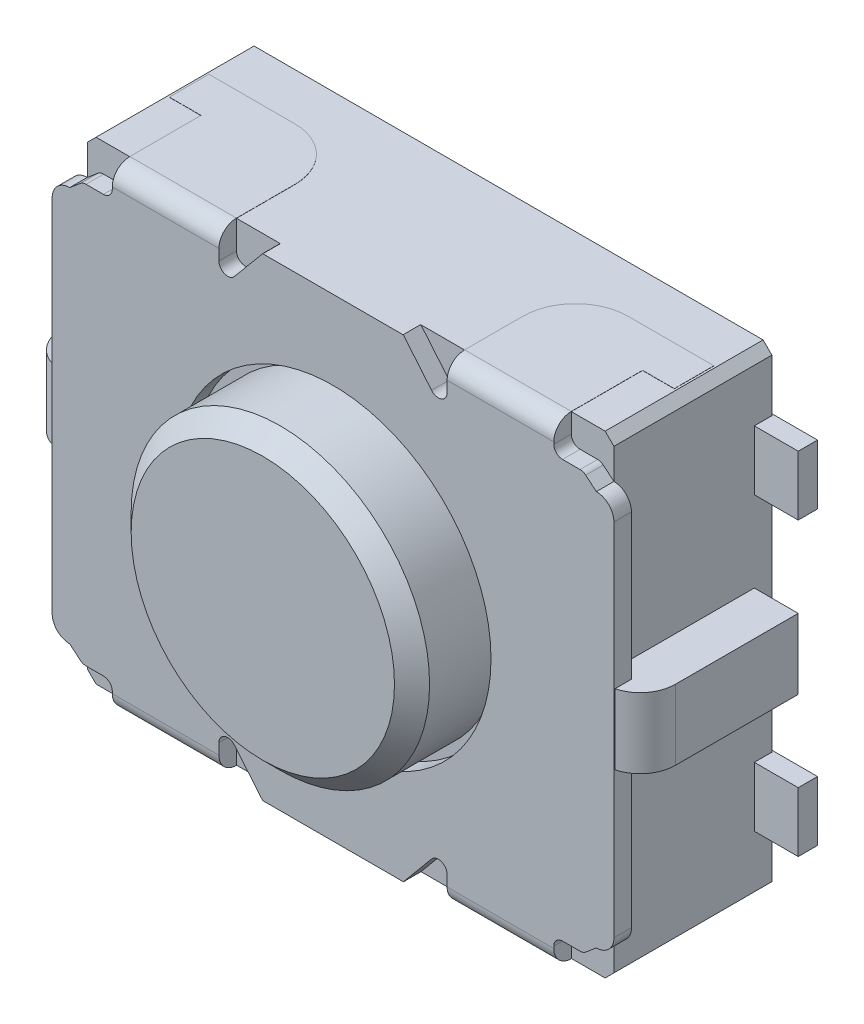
ISO-10303-21;
HEADER;
FILE_DESCRIPTION(('STEP AP214'),'2;1');
FILE_NAME('part.step','',(''),(''),'','','');
FILE_SCHEMA(('AUTOMOTIVE_DESIGN { 1 0 10303 214 1 1 1 1 }'));
ENDSEC;
DATA;
#1=APPLICATION_CONTEXT('core data for automotive mechanical design processes');
#2=APPLICATION_PROTOCOL_DEFINITION('international standard','automotive_design',2000,#1);
#3=PRODUCT_CONTEXT('',#1,'mechanical');
#4=PRODUCT('Part','Part','',(#3));
#5=PRODUCT_RELATED_PRODUCT_CATEGORY('part','',(#4));
#6=PRODUCT_DEFINITION_FORMATION('','',#4);
#7=PRODUCT_DEFINITION_CONTEXT('part definition',#1,'design');
#8=PRODUCT_DEFINITION('design','',#6,#7);
#9=PRODUCT_DEFINITION_SHAPE('','',#8);
#10=(LENGTH_UNIT() NAMED_UNIT(*) SI_UNIT(.MILLI.,.METRE.));
#11=(NAMED_UNIT(*) PLANE_ANGLE_UNIT() SI_UNIT($,.RADIAN.));
#12=(NAMED_UNIT(*) SI_UNIT($,.STERADIAN.) SOLID_ANGLE_UNIT());
#13=UNCERTAINTY_MEASURE_WITH_UNIT(LENGTH_MEASURE(1.E-05),#10,'distance_accuracy_value','');
#14=(GEOMETRIC_REPRESENTATION_CONTEXT(3) GLOBAL_UNCERTAINTY_ASSIGNED_CONTEXT((#13)) GLOBAL_UNIT_ASSIGNED_CONTEXT((#10,
#11,#12)) REPRESENTATION_CONTEXT('',''));
#15=CARTESIAN_POINT('',(0.,0.,0.));
#16=DIRECTION('',(0.,0.,1.));
#17=DIRECTION('',(1.,0.,0.));
#18=AXIS2_PLACEMENT_3D('',#15,#16,#17);
#19=CARTESIAN_POINT('',(1.5,1.35,1.));
#20=DIRECTION('',(-1.,0.,0.));
#21=DIRECTION('',(0.,-1.,0.));
#22=AXIS2_PLACEMENT_3D('',#19,#20,#21);
#23=PLANE('',#22);
#24=DIRECTION('',(0.,1.,0.));
#25=VECTOR('',#24,1.);
#26=CARTESIAN_POINT('',(1.5,-1.12562617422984,0.9));
#27=LINE('',#26,#25);
#28=CARTESIAN_POINT('',(1.5,-1.12562617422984,0.9));
#29=VERTEX_POINT('',#28);
#30=CARTESIAN_POINT('',(1.5,-0.2,0.9));
#31=VERTEX_POINT('',#30);
#32=EDGE_CURVE('E1531',#29,#31,#27,.T.);
#33=ORIENTED_EDGE('',*,*,#32,.F.);
#34=DIRECTION('',(0.,1.,0.));
#35=VECTOR('',#34,1.);
#36=CARTESIAN_POINT('',(1.5,-1.12562617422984,0.9));
#37=LINE('',#36,#35);
#38=CARTESIAN_POINT('',(1.5,-1.299,0.9));
#39=VERTEX_POINT('',#38);
#40=EDGE_CURVE('E924',#39,#29,#37,.T.);
#41=ORIENTED_EDGE('',*,*,#40,.F.);
#42=DIRECTION('',(0.,0.,-1.));
#43=VECTOR('',#42,1.);
#44=CARTESIAN_POINT('',(1.5,-1.299,0.));
#45=LINE('',#44,#43);
#46=CARTESIAN_POINT('',(1.5,-1.299,0.));
#47=VERTEX_POINT('',#46);
#48=EDGE_CURVE('E1442',#39,#47,#45,.T.);
#49=ORIENTED_EDGE('',*,*,#48,.T.);
#50=DIRECTION('',(0.,1.,0.));
#51=VECTOR('',#50,1.);
#52=CARTESIAN_POINT('',(1.5,1.35,0.));
#53=LINE('',#52,#51);
#54=CARTESIAN_POINT('',(1.5,-1.,0.));
#55=VERTEX_POINT('',#54);
#56=EDGE_CURVE('E1272',#47,#55,#53,.T.);
#57=ORIENTED_EDGE('',*,*,#56,.T.);
#58=DIRECTION('',(0.,0.,1.));
#59=VECTOR('',#58,1.);
#60=CARTESIAN_POINT('',(1.5,-1.,1.));
#61=LINE('',#60,#59);
#62=CARTESIAN_POINT('',(1.5,-1.,0.1));
#63=VERTEX_POINT('',#62);
#64=EDGE_CURVE('E1267',#55,#63,#61,.T.);
#65=ORIENTED_EDGE('',*,*,#64,.T.);
#66=DIRECTION('',(0.,-1.,0.));
#67=VECTOR('',#66,1.);
#68=CARTESIAN_POINT('',(1.5,1.35,0.1));
#69=LINE('',#68,#67);
#70=CARTESIAN_POINT('',(1.5,-0.66,0.1));
#71=VERTEX_POINT('',#70);
#72=EDGE_CURVE('E1293',#71,#63,#69,.T.);
#73=ORIENTED_EDGE('',*,*,#72,.F.);
#74=DIRECTION('',(0.,0.,-1.));
#75=VECTOR('',#74,1.);
#76=CARTESIAN_POINT('',(1.5,-0.660000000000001,1.));
#77=LINE('',#76,#75);
#78=CARTESIAN_POINT('',(1.5,-0.66,0.));
#79=VERTEX_POINT('',#78);
#80=EDGE_CURVE('E1255',#71,#79,#77,.T.);
#81=ORIENTED_EDGE('',*,*,#80,.T.);
#82=CARTESIAN_POINT('',(1.5,0.66,0.));
#83=VERTEX_POINT('',#82);
#84=EDGE_CURVE('E1276',#79,#83,#53,.T.);
#85=ORIENTED_EDGE('',*,*,#84,.T.);
#86=DIRECTION('',(0.,0.,1.));
#87=VECTOR('',#86,1.);
#88=CARTESIAN_POINT('',(1.5,0.66,1.));
#89=LINE('',#88,#87);
#90=CARTESIAN_POINT('',(1.5,0.66,0.1));
#91=VERTEX_POINT('',#90);
#92=EDGE_CURVE('E1220',#83,#91,#89,.T.);
#93=ORIENTED_EDGE('',*,*,#92,.T.);
#94=DIRECTION('',(0.,1.,0.));
#95=VECTOR('',#94,1.);
#96=CARTESIAN_POINT('',(1.5,1.35,0.1));
#97=LINE('',#96,#95);
#98=CARTESIAN_POINT('',(1.5,1.,0.1));
#99=VERTEX_POINT('',#98);
#100=EDGE_CURVE('E1308',#91,#99,#97,.T.);
#101=ORIENTED_EDGE('',*,*,#100,.T.);
#102=DIRECTION('',(0.,0.,-1.));
#103=VECTOR('',#102,1.);
#104=CARTESIAN_POINT('',(1.5,1.,1.));
#105=LINE('',#104,#103);
#106=CARTESIAN_POINT('',(1.5,1.,0.));
#107=VERTEX_POINT('',#106);
#108=EDGE_CURVE('E1208',#99,#107,#105,.T.);
#109=ORIENTED_EDGE('',*,*,#108,.T.);
#110=CARTESIAN_POINT('',(1.5,1.299,0.));
#111=VERTEX_POINT('',#110);
#112=EDGE_CURVE('E1271',#107,#111,#53,.T.);
#113=ORIENTED_EDGE('',*,*,#112,.T.);
#114=DIRECTION('',(0.,0.,1.));
#115=VECTOR('',#114,1.);
#116=CARTESIAN_POINT('',(1.5,1.299,0.9));
#117=LINE('',#116,#115);
#118=CARTESIAN_POINT('',(1.5,1.299,0.9));
#119=VERTEX_POINT('',#118);
#120=EDGE_CURVE('E1439',#111,#119,#117,.T.);
#121=ORIENTED_EDGE('',*,*,#120,.T.);
#122=DIRECTION('',(0.,1.,0.));
#123=VECTOR('',#122,1.);
#124=CARTESIAN_POINT('',(1.5,1.12562617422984,0.9));
#125=LINE('',#124,#123);
#126=CARTESIAN_POINT('',(1.5,1.12562617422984,0.9));
#127=VERTEX_POINT('',#126);
#128=EDGE_CURVE('E2057',#127,#119,#125,.T.);
#129=ORIENTED_EDGE('',*,*,#128,.F.);
#130=CARTESIAN_POINT('',(1.5,0.2,0.9));
#131=VERTEX_POINT('',#130);
#132=EDGE_CURVE('E814',#131,#127,#27,.T.);
#133=ORIENTED_EDGE('',*,*,#132,.F.);
#134=DIRECTION('',(0.,0.,-1.));
#135=VECTOR('',#134,1.);
#136=CARTESIAN_POINT('',(1.5,0.2,1.));
#137=LINE('',#136,#135);
#138=CARTESIAN_POINT('',(1.5,0.2,0.1));
#139=VERTEX_POINT('',#138);
#140=EDGE_CURVE('E1922',#131,#139,#137,.T.);
#141=ORIENTED_EDGE('',*,*,#140,.T.);
#142=DIRECTION('',(0.,1.,0.));
#143=VECTOR('',#142,1.);
#144=CARTESIAN_POINT('',(1.5,1.35,0.1));
#145=LINE('',#144,#143);
#146=CARTESIAN_POINT('',(1.5,-0.2,0.1));
#147=VERTEX_POINT('',#146);
#148=EDGE_CURVE('E841',#147,#139,#145,.T.);
#149=ORIENTED_EDGE('',*,*,#148,.F.);
#150=DIRECTION('',(0.,0.,1.));
#151=VECTOR('',#150,1.);
#152=CARTESIAN_POINT('',(1.5,-0.2,1.));
#153=LINE('',#152,#151);
#154=EDGE_CURVE('E850',#147,#31,#153,.T.);
#155=ORIENTED_EDGE('',*,*,#154,.T.);
#156=EDGE_LOOP('',(#33,#41,#49,#57,#65,#73,#81,#85,#93,#101,#109,#113,#121,#129,#133,#141,#149,#155));
#157=FACE_BOUND('',#156,.T.);
#158=ADVANCED_FACE('F45',(#157),#23,.F.);
#159=CARTESIAN_POINT('',(-1.75,-0.2,0.1));
#160=DIRECTION('',(0.,-1.,0.));
#161=DIRECTION('',(0.,0.,-1.));
#162=AXIS2_PLACEMENT_3D('',#159,#160,#161);
#163=PLANE('',#162);
#164=DIRECTION('',(0.,0.,-1.));
#165=VECTOR('',#164,1.);
#166=CARTESIAN_POINT('',(1.6,-0.2,0.1));
#167=LINE('',#166,#165);
#168=CARTESIAN_POINT('',(1.6,-0.2,0.993649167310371));
#169=VERTEX_POINT('',#168);
#170=CARTESIAN_POINT('',(1.6,-0.2,0.9));
#171=VERTEX_POINT('',#170);
#172=EDGE_CURVE('E1527',#169,#171,#167,.T.);
#173=ORIENTED_EDGE('',*,*,#172,.T.);
#174=DIRECTION('',(-1.,0.,0.));
#175=VECTOR('',#174,1.);
#176=CARTESIAN_POINT('',(-1.75,-0.2,0.9));
#177=LINE('',#176,#175);
#178=EDGE_CURVE('E1522',#171,#31,#177,.T.);
#179=ORIENTED_EDGE('',*,*,#178,.T.);
#180=ORIENTED_EDGE('',*,*,#154,.F.);
#181=DIRECTION('',(1.,0.,0.));
#182=VECTOR('',#181,1.);
#183=CARTESIAN_POINT('',(-1.75,-0.2,0.1));
#184=LINE('',#183,#182);
#185=CARTESIAN_POINT('',(1.75,-0.2,0.1));
#186=VERTEX_POINT('',#185);
#187=EDGE_CURVE('E1897',#147,#186,#184,.T.);
#188=ORIENTED_EDGE('',*,*,#187,.T.);
#189=DIRECTION('',(0.,0.,1.));
#190=VECTOR('',#189,1.);
#191=CARTESIAN_POINT('',(1.75,-0.2,0.1));
#192=LINE('',#191,#190);
#193=CARTESIAN_POINT('',(1.75,-0.2,0.8));
#194=VERTEX_POINT('',#193);
#195=EDGE_CURVE('E1903',#186,#194,#192,.T.);
#196=ORIENTED_EDGE('',*,*,#195,.T.);
#197=CARTESIAN_POINT('',(1.55,-0.2,0.8));
#198=DIRECTION('',(0.,-1.,0.));
#199=DIRECTION('',(0.,0.,-1.));
#200=AXIS2_PLACEMENT_3D('',#197,#198,#199);
#201=CIRCLE('',#200,0.2);
#202=EDGE_CURVE('E1362',#194,#169,#201,.T.);
#203=ORIENTED_EDGE('',*,*,#202,.T.);
#204=EDGE_LOOP('',(#173,#179,#180,#188,#196,#203));
#205=FACE_BOUND('',#204,.T.);
#206=ADVANCED_FACE('F2405',(#205),#163,.T.);
#207=CARTESIAN_POINT('',(-1.75,0.2,0.1));
#208=DIRECTION('',(0.,1.,0.));
#209=DIRECTION('',(0.,0.,1.));
#210=AXIS2_PLACEMENT_3D('',#207,#208,#209);
#211=PLANE('',#210);
#212=ORIENTED_EDGE('',*,*,#140,.F.);
#213=DIRECTION('',(1.,0.,0.));
#214=VECTOR('',#213,1.);
#215=CARTESIAN_POINT('',(-1.75,0.2,0.9));
#216=LINE('',#215,#214);
#217=CARTESIAN_POINT('',(1.6,0.2,0.9));
#218=VERTEX_POINT('',#217);
#219=EDGE_CURVE('E1511',#131,#218,#216,.T.);
#220=ORIENTED_EDGE('',*,*,#219,.T.);
#221=DIRECTION('',(0.,0.,1.));
#222=VECTOR('',#221,1.);
#223=CARTESIAN_POINT('',(1.6,0.2,0.1));
#224=LINE('',#223,#222);
#225=CARTESIAN_POINT('',(1.6,0.2,0.993649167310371));
#226=VERTEX_POINT('',#225);
#227=EDGE_CURVE('E822',#218,#226,#224,.T.);
#228=ORIENTED_EDGE('',*,*,#227,.T.);
#229=CARTESIAN_POINT('',(1.55,0.2,0.8));
#230=DIRECTION('',(0.,1.,0.));
#231=DIRECTION('',(0.,0.,1.));
#232=AXIS2_PLACEMENT_3D('',#229,#230,#231);
#233=CIRCLE('',#232,0.2);
#234=CARTESIAN_POINT('',(1.75,0.2,0.8));
#235=VERTEX_POINT('',#234);
#236=EDGE_CURVE('E1356',#226,#235,#233,.T.);
#237=ORIENTED_EDGE('',*,*,#236,.T.);
#238=DIRECTION('',(0.,0.,1.));
#239=VECTOR('',#238,1.);
#240=CARTESIAN_POINT('',(1.75,0.2,0.1));
#241=LINE('',#240,#239);
#242=CARTESIAN_POINT('',(1.75,0.2,0.1));
#243=VERTEX_POINT('',#242);
#244=EDGE_CURVE('E1902',#243,#235,#241,.T.);
#245=ORIENTED_EDGE('',*,*,#244,.F.);
#246=DIRECTION('',(-1.,0.,0.));
#247=VECTOR('',#246,1.);
#248=CARTESIAN_POINT('',(-1.75,0.2,0.1));
#249=LINE('',#248,#247);
#250=EDGE_CURVE('E1889',#243,#139,#249,.T.);
#251=ORIENTED_EDGE('',*,*,#250,.T.);
#252=EDGE_LOOP('',(#212,#220,#228,#237,#245,#251));
#253=FACE_BOUND('',#252,.T.);
#254=ADVANCED_FACE('F2410',(#253),#211,.T.);
#255=CARTESIAN_POINT('',(1.55,0.,0.8));
#256=DIRECTION('',(0.,1.,0.));
#257=DIRECTION('',(0.,0.,1.));
#258=AXIS2_PLACEMENT_3D('',#255,#256,#257);
#259=CYLINDRICAL_SURFACE('',#258,0.2);
#260=ORIENTED_EDGE('',*,*,#236,.F.);
#261=DIRECTION('',(0.,1.,0.));
#262=VECTOR('',#261,1.);
#263=CARTESIAN_POINT('',(1.6,0.,0.993649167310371));
#264=LINE('',#263,#262);
#265=EDGE_CURVE('E1507',#226,#169,#264,.F.);
#266=ORIENTED_EDGE('',*,*,#265,.T.);
#267=ORIENTED_EDGE('',*,*,#202,.F.);
#268=DIRECTION('',(0.,1.,0.));
#269=VECTOR('',#268,1.);
#270=CARTESIAN_POINT('',(1.75,0.2,0.8));
#271=LINE('',#270,#269);
#272=EDGE_CURVE('E1359',#235,#194,#271,.F.);
#273=ORIENTED_EDGE('',*,*,#272,.F.);
#274=EDGE_LOOP('',(#260,#266,#267,#273));
#275=FACE_BOUND('',#274,.T.);
#276=ADVANCED_FACE('F2426',(#275),#259,.T.);
#277=CARTESIAN_POINT('',(-1.5,1.35,1.));
#278=DIRECTION('',(1.,0.,0.));
#279=DIRECTION('',(0.,1.,0.));
#280=AXIS2_PLACEMENT_3D('',#277,#278,#279);
#281=PLANE('',#280);
#282=DIRECTION('',(0.,-1.,0.));
#283=VECTOR('',#282,1.);
#284=CARTESIAN_POINT('',(-1.5,1.12562617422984,0.9));
#285=LINE('',#284,#283);
#286=CARTESIAN_POINT('',(-1.5,1.12562617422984,0.9));
#287=VERTEX_POINT('',#286);
#288=CARTESIAN_POINT('',(-1.5,0.2,0.9));
#289=VERTEX_POINT('',#288);
#290=EDGE_CURVE('E1544',#287,#289,#285,.T.);
#291=ORIENTED_EDGE('',*,*,#290,.F.);
#292=DIRECTION('',(0.,-1.,0.));
#293=VECTOR('',#292,1.);
#294=CARTESIAN_POINT('',(-1.5,1.12562617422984,0.9));
#295=LINE('',#294,#293);
#296=CARTESIAN_POINT('',(-1.5,1.299,0.9));
#297=VERTEX_POINT('',#296);
#298=EDGE_CURVE('E2011',#297,#287,#295,.T.);
#299=ORIENTED_EDGE('',*,*,#298,.F.);
#300=DIRECTION('',(0.,0.,-1.));
#301=VECTOR('',#300,1.);
#302=CARTESIAN_POINT('',(-1.5,1.299,0.));
#303=LINE('',#302,#301);
#304=CARTESIAN_POINT('',(-1.5,1.299,0.));
#305=VERTEX_POINT('',#304);
#306=EDGE_CURVE('E1457',#297,#305,#303,.T.);
#307=ORIENTED_EDGE('',*,*,#306,.T.);
#308=DIRECTION('',(0.,-1.,0.));
#309=VECTOR('',#308,1.);
#310=CARTESIAN_POINT('',(-1.5,1.35,0.));
#311=LINE('',#310,#309);
#312=CARTESIAN_POINT('',(-1.5,1.,0.));
#313=VERTEX_POINT('',#312);
#314=EDGE_CURVE('E1277',#305,#313,#311,.T.);
#315=ORIENTED_EDGE('',*,*,#314,.T.);
#316=DIRECTION('',(0.,0.,1.));
#317=VECTOR('',#316,1.);
#318=CARTESIAN_POINT('',(-1.5,1.,1.));
#319=LINE('',#318,#317);
#320=CARTESIAN_POINT('',(-1.5,1.,0.1));
#321=VERTEX_POINT('',#320);
#322=EDGE_CURVE('E1127',#313,#321,#319,.T.);
#323=ORIENTED_EDGE('',*,*,#322,.T.);
#324=DIRECTION('',(0.,-1.,0.));
#325=VECTOR('',#324,1.);
#326=CARTESIAN_POINT('',(-1.5,1.35,0.1));
#327=LINE('',#326,#325);
#328=CARTESIAN_POINT('',(-1.5,0.66,0.1));
#329=VERTEX_POINT('',#328);
#330=EDGE_CURVE('E1340',#321,#329,#327,.T.);
#331=ORIENTED_EDGE('',*,*,#330,.T.);
#332=DIRECTION('',(0.,0.,-1.));
#333=VECTOR('',#332,1.);
#334=CARTESIAN_POINT('',(-1.5,0.66,1.));
#335=LINE('',#334,#333);
#336=CARTESIAN_POINT('',(-1.5,0.66,0.));
#337=VERTEX_POINT('',#336);
#338=EDGE_CURVE('E1115',#329,#337,#335,.T.);
#339=ORIENTED_EDGE('',*,*,#338,.T.);
#340=CARTESIAN_POINT('',(-1.5,-0.66,0.));
#341=VERTEX_POINT('',#340);
#342=EDGE_CURVE('E1281',#337,#341,#311,.T.);
#343=ORIENTED_EDGE('',*,*,#342,.T.);
#344=DIRECTION('',(0.,0.,1.));
#345=VECTOR('',#344,1.);
#346=CARTESIAN_POINT('',(-1.5,-0.660000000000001,1.));
#347=LINE('',#346,#345);
#348=CARTESIAN_POINT('',(-1.5,-0.66,0.1));
#349=VERTEX_POINT('',#348);
#350=EDGE_CURVE('E1173',#341,#349,#347,.T.);
#351=ORIENTED_EDGE('',*,*,#350,.T.);
#352=DIRECTION('',(0.,-1.,0.));
#353=VECTOR('',#352,1.);
#354=CARTESIAN_POINT('',(-1.5,1.35,0.1));
#355=LINE('',#354,#353);
#356=CARTESIAN_POINT('',(-1.5,-1.,0.1));
#357=VERTEX_POINT('',#356);
#358=EDGE_CURVE('E1324',#349,#357,#355,.T.);
#359=ORIENTED_EDGE('',*,*,#358,.T.);
#360=DIRECTION('',(0.,0.,-1.));
#361=VECTOR('',#360,1.);
#362=CARTESIAN_POINT('',(-1.5,-1.,1.));
#363=LINE('',#362,#361);
#364=CARTESIAN_POINT('',(-1.5,-1.,0.));
#365=VERTEX_POINT('',#364);
#366=EDGE_CURVE('E1161',#357,#365,#363,.T.);
#367=ORIENTED_EDGE('',*,*,#366,.T.);
#368=CARTESIAN_POINT('',(-1.5,-1.299,0.));
#369=VERTEX_POINT('',#368);
#370=EDGE_CURVE('E1275',#365,#369,#311,.T.);
#371=ORIENTED_EDGE('',*,*,#370,.T.);
#372=DIRECTION('',(0.,0.,1.));
#373=VECTOR('',#372,1.);
#374=CARTESIAN_POINT('',(-1.5,-1.299,0.9));
#375=LINE('',#374,#373);
#376=CARTESIAN_POINT('',(-1.5,-1.299,0.9));
#377=VERTEX_POINT('',#376);
#378=EDGE_CURVE('E1460',#369,#377,#375,.T.);
#379=ORIENTED_EDGE('',*,*,#378,.T.);
#380=DIRECTION('',(0.,-1.,0.));
#381=VECTOR('',#380,1.);
#382=CARTESIAN_POINT('',(-1.5,-1.12562617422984,0.9));
#383=LINE('',#382,#381);
#384=CARTESIAN_POINT('',(-1.5,-1.12562617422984,0.9));
#385=VERTEX_POINT('',#384);
#386=EDGE_CURVE('E1935',#385,#377,#383,.T.);
#387=ORIENTED_EDGE('',*,*,#386,.F.);
#388=CARTESIAN_POINT('',(-1.5,-0.2,0.9));
#389=VERTEX_POINT('',#388);
#390=EDGE_CURVE('E1538',#389,#385,#285,.T.);
#391=ORIENTED_EDGE('',*,*,#390,.F.);
#392=DIRECTION('',(0.,0.,-1.));
#393=VECTOR('',#392,1.);
#394=CARTESIAN_POINT('',(-1.5,-0.2,1.));
#395=LINE('',#394,#393);
#396=CARTESIAN_POINT('',(-1.5,-0.2,0.1));
#397=VERTEX_POINT('',#396);
#398=EDGE_CURVE('E1925',#389,#397,#395,.T.);
#399=ORIENTED_EDGE('',*,*,#398,.T.);
#400=DIRECTION('',(0.,-1.,0.));
#401=VECTOR('',#400,1.);
#402=CARTESIAN_POINT('',(-1.5,1.35,0.1));
#403=LINE('',#402,#401);
#404=CARTESIAN_POINT('',(-1.5,0.2,0.1));
#405=VERTEX_POINT('',#404);
#406=EDGE_CURVE('E1352',#405,#397,#403,.T.);
#407=ORIENTED_EDGE('',*,*,#406,.F.);
#408=DIRECTION('',(0.,0.,1.));
#409=VECTOR('',#408,1.);
#410=CARTESIAN_POINT('',(-1.5,0.2,1.));
#411=LINE('',#410,#409);
#412=EDGE_CURVE('E1907',#405,#289,#411,.T.);
#413=ORIENTED_EDGE('',*,*,#412,.T.);
#414=EDGE_LOOP('',(#291,#299,#307,#315,#323,#331,#339,#343,#351,#359,#367,#371,#379,#387,#391,
#399,#407,#413));
#415=FACE_BOUND('',#414,.T.);
#416=ADVANCED_FACE('F2233',(#415),#281,.F.);
#417=DIRECTION('',(0.,0.,-1.));
#418=VECTOR('',#417,1.);
#419=CARTESIAN_POINT('',(-1.6,0.2,0.1));
#420=LINE('',#419,#418);
#421=CARTESIAN_POINT('',(-1.6,0.2,0.993649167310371));
#422=VERTEX_POINT('',#421);
#423=CARTESIAN_POINT('',(-1.6,0.2,0.9));
#424=VERTEX_POINT('',#423);
#425=EDGE_CURVE('E1554',#422,#424,#420,.T.);
#426=ORIENTED_EDGE('',*,*,#425,.T.);
#427=DIRECTION('',(1.,0.,0.));
#428=VECTOR('',#427,1.);
#429=CARTESIAN_POINT('',(-1.75,0.2,0.9));
#430=LINE('',#429,#428);
#431=EDGE_CURVE('E1558',#424,#289,#430,.T.);
#432=ORIENTED_EDGE('',*,*,#431,.T.);
#433=ORIENTED_EDGE('',*,*,#412,.F.);
#434=CARTESIAN_POINT('',(-1.75,0.2,0.1));
#435=VERTEX_POINT('',#434);
#436=EDGE_CURVE('E1888',#405,#435,#249,.T.);
#437=ORIENTED_EDGE('',*,*,#436,.T.);
#438=DIRECTION('',(0.,0.,1.));
#439=VECTOR('',#438,1.);
#440=CARTESIAN_POINT('',(-1.75,0.2,0.1));
#441=LINE('',#440,#439);
#442=CARTESIAN_POINT('',(-1.75,0.2,0.8));
#443=VERTEX_POINT('',#442);
#444=EDGE_CURVE('E1912',#435,#443,#441,.T.);
#445=ORIENTED_EDGE('',*,*,#444,.T.);
#446=CARTESIAN_POINT('',(-1.55,0.2,0.8));
#447=DIRECTION('',(0.,1.,0.));
#448=DIRECTION('',(0.,0.,1.));
#449=AXIS2_PLACEMENT_3D('',#446,#447,#448);
#450=CIRCLE('',#449,0.2);
#451=EDGE_CURVE('E1372',#443,#422,#450,.T.);
#452=ORIENTED_EDGE('',*,*,#451,.T.);
#453=EDGE_LOOP('',(#426,#432,#433,#437,#445,#452));
#454=FACE_BOUND('',#453,.T.);
#455=ADVANCED_FACE('F2213',(#454),#211,.T.);
#456=ORIENTED_EDGE('',*,*,#398,.F.);
#457=DIRECTION('',(-1.,0.,0.));
#458=VECTOR('',#457,1.);
#459=CARTESIAN_POINT('',(-1.75,-0.2,0.9));
#460=LINE('',#459,#458);
#461=CARTESIAN_POINT('',(-1.6,-0.2,0.9));
#462=VERTEX_POINT('',#461);
#463=EDGE_CURVE('E1483',#389,#462,#460,.T.);
#464=ORIENTED_EDGE('',*,*,#463,.T.);
#465=DIRECTION('',(0.,0.,1.));
#466=VECTOR('',#465,1.);
#467=CARTESIAN_POINT('',(-1.6,-0.2,0.1));
#468=LINE('',#467,#466);
#469=CARTESIAN_POINT('',(-1.6,-0.2,0.993649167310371));
#470=VERTEX_POINT('',#469);
#471=EDGE_CURVE('E1548',#462,#470,#468,.T.);
#472=ORIENTED_EDGE('',*,*,#471,.T.);
#473=CARTESIAN_POINT('',(-1.55,-0.2,0.8));
#474=DIRECTION('',(0.,-1.,0.));
#475=DIRECTION('',(0.,0.,-1.));
#476=AXIS2_PLACEMENT_3D('',#473,#474,#475);
#477=CIRCLE('',#476,0.2);
#478=CARTESIAN_POINT('',(-1.75,-0.2,0.8));
#479=VERTEX_POINT('',#478);
#480=EDGE_CURVE('E1366',#470,#479,#477,.T.);
#481=ORIENTED_EDGE('',*,*,#480,.T.);
#482=DIRECTION('',(0.,0.,1.));
#483=VECTOR('',#482,1.);
#484=CARTESIAN_POINT('',(-1.75,-0.2,0.1));
#485=LINE('',#484,#483);
#486=CARTESIAN_POINT('',(-1.75,-0.2,0.1));
#487=VERTEX_POINT('',#486);
#488=EDGE_CURVE('E1908',#487,#479,#485,.T.);
#489=ORIENTED_EDGE('',*,*,#488,.F.);
#490=EDGE_CURVE('E1898',#487,#397,#184,.T.);
#491=ORIENTED_EDGE('',*,*,#490,.T.);
#492=EDGE_LOOP('',(#456,#464,#472,#481,#489,#491));
#493=FACE_BOUND('',#492,.T.);
#494=ADVANCED_FACE('F2221',(#493),#163,.T.);
#495=CARTESIAN_POINT('',(-1.55,0.,0.8));
#496=DIRECTION('',(0.,-1.,0.));
#497=DIRECTION('',(0.,0.,-1.));
#498=AXIS2_PLACEMENT_3D('',#495,#496,#497);
#499=CYLINDRICAL_SURFACE('',#498,0.2);
#500=ORIENTED_EDGE('',*,*,#480,.F.);
#501=DIRECTION('',(0.,-1.,0.));
#502=VECTOR('',#501,1.);
#503=CARTESIAN_POINT('',(-1.6,0.,0.993649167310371));
#504=LINE('',#503,#502);
#505=EDGE_CURVE('E1479',#470,#422,#504,.F.);
#506=ORIENTED_EDGE('',*,*,#505,.T.);
#507=ORIENTED_EDGE('',*,*,#451,.F.);
#508=DIRECTION('',(0.,-1.,0.));
#509=VECTOR('',#508,1.);
#510=CARTESIAN_POINT('',(-1.75,0.2,0.8));
#511=LINE('',#510,#509);
#512=EDGE_CURVE('E1369',#479,#443,#511,.F.);
#513=ORIENTED_EDGE('',*,*,#512,.F.);
#514=EDGE_LOOP('',(#500,#506,#507,#513));
#515=FACE_BOUND('',#514,.T.);
#516=ADVANCED_FACE('F2217',(#515),#499,.T.);
#517=CARTESIAN_POINT('',(0.,0.,0.));
#518=DIRECTION('',(0.,0.,1.));
#519=DIRECTION('',(1.,0.,0.));
#520=AXIS2_PLACEMENT_3D('',#517,#518,#519);
#521=PLANE('',#520);
#522=ORIENTED_EDGE('',*,*,#56,.F.);
#523=DIRECTION('',(-0.707106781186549,-0.707106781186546,0.));
#524=VECTOR('',#523,1.);
#525=CARTESIAN_POINT('',(1.45,-1.349,0.));
#526=LINE('',#525,#524);
#527=CARTESIAN_POINT('',(1.45,-1.349,0.));
#528=VERTEX_POINT('',#527);
#529=EDGE_CURVE('E1454',#47,#528,#526,.T.);
#530=ORIENTED_EDGE('',*,*,#529,.T.);
#531=DIRECTION('',(1.,0.,0.));
#532=VECTOR('',#531,1.);
#533=CARTESIAN_POINT('',(0.,-1.349,0.));
#534=LINE('',#533,#532);
#535=CARTESIAN_POINT('',(-1.45,-1.349,0.));
#536=VERTEX_POINT('',#535);
#537=EDGE_CURVE('E1731',#536,#528,#534,.T.);
#538=ORIENTED_EDGE('',*,*,#537,.F.);
#539=DIRECTION('',(-0.707106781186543,0.707106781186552,0.));
#540=VECTOR('',#539,1.);
#541=CARTESIAN_POINT('',(-1.45,-1.349,0.));
#542=LINE('',#541,#540);
#543=EDGE_CURVE('E1451',#536,#369,#542,.T.);
#544=ORIENTED_EDGE('',*,*,#543,.T.);
#545=ORIENTED_EDGE('',*,*,#370,.F.);
#546=DIRECTION('',(1.,0.,0.));
#547=VECTOR('',#546,1.);
#548=CARTESIAN_POINT('',(0.,-1.,0.));
#549=LINE('',#548,#547);
#550=CARTESIAN_POINT('',(-1.25,-1.,0.));
#551=VERTEX_POINT('',#550);
#552=EDGE_CURVE('E1312',#365,#551,#549,.T.);
#553=ORIENTED_EDGE('',*,*,#552,.T.);
#554=DIRECTION('',(0.,1.,0.));
#555=VECTOR('',#554,1.);
#556=CARTESIAN_POINT('',(-1.25,0.,0.));
#557=LINE('',#556,#555);
#558=CARTESIAN_POINT('',(-1.25,-0.66,0.));
#559=VERTEX_POINT('',#558);
#560=EDGE_CURVE('E1316',#551,#559,#557,.T.);
#561=ORIENTED_EDGE('',*,*,#560,.T.);
#562=DIRECTION('',(-1.,0.,0.));
#563=VECTOR('',#562,1.);
#564=CARTESIAN_POINT('',(0.,-0.659999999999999,0.));
#565=LINE('',#564,#563);
#566=EDGE_CURVE('E1320',#559,#341,#565,.T.);
#567=ORIENTED_EDGE('',*,*,#566,.T.);
#568=ORIENTED_EDGE('',*,*,#342,.F.);
#569=DIRECTION('',(1.,0.,0.));
#570=VECTOR('',#569,1.);
#571=CARTESIAN_POINT('',(0.,0.659999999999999,0.));
#572=LINE('',#571,#570);
#573=CARTESIAN_POINT('',(-1.25,0.66,0.));
#574=VERTEX_POINT('',#573);
#575=EDGE_CURVE('E1332',#337,#574,#572,.T.);
#576=ORIENTED_EDGE('',*,*,#575,.T.);
#577=DIRECTION('',(0.,1.,0.));
#578=VECTOR('',#577,1.);
#579=CARTESIAN_POINT('',(-1.25,0.,0.));
#580=LINE('',#579,#578);
#581=CARTESIAN_POINT('',(-1.25,1.,0.));
#582=VERTEX_POINT('',#581);
#583=EDGE_CURVE('E1328',#574,#582,#580,.T.);
#584=ORIENTED_EDGE('',*,*,#583,.T.);
#585=DIRECTION('',(-1.,0.,0.));
#586=VECTOR('',#585,1.);
#587=CARTESIAN_POINT('',(0.,1.,0.));
#588=LINE('',#587,#586);
#589=EDGE_CURVE('E1336',#582,#313,#588,.T.);
#590=ORIENTED_EDGE('',*,*,#589,.T.);
#591=ORIENTED_EDGE('',*,*,#314,.F.);
#592=DIRECTION('',(0.707106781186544,0.707106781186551,0.));
#593=VECTOR('',#592,1.);
#594=CARTESIAN_POINT('',(-1.45,1.349,0.));
#595=LINE('',#594,#593);
#596=CARTESIAN_POINT('',(-1.45,1.349,0.));
#597=VERTEX_POINT('',#596);
#598=EDGE_CURVE('E1448',#305,#597,#595,.T.);
#599=ORIENTED_EDGE('',*,*,#598,.T.);
#600=DIRECTION('',(-1.,0.,0.));
#601=VECTOR('',#600,1.);
#602=CARTESIAN_POINT('',(0.,1.349,0.));
#603=LINE('',#602,#601);
#604=CARTESIAN_POINT('',(1.45,1.349,0.));
#605=VERTEX_POINT('',#604);
#606=EDGE_CURVE('E1633',#605,#597,#603,.T.);
#607=ORIENTED_EDGE('',*,*,#606,.F.);
#608=DIRECTION('',(0.707106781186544,-0.707106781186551,0.));
#609=VECTOR('',#608,1.);
#610=CARTESIAN_POINT('',(1.45,1.349,0.));
#611=LINE('',#610,#609);
#612=EDGE_CURVE('E1445',#605,#111,#611,.T.);
#613=ORIENTED_EDGE('',*,*,#612,.T.);
#614=ORIENTED_EDGE('',*,*,#112,.F.);
#615=DIRECTION('',(-1.,0.,0.));
#616=VECTOR('',#615,1.);
#617=CARTESIAN_POINT('',(0.,1.,0.));
#618=LINE('',#617,#616);
#619=CARTESIAN_POINT('',(1.25,1.,0.));
#620=VERTEX_POINT('',#619);
#621=EDGE_CURVE('E1296',#107,#620,#618,.T.);
#622=ORIENTED_EDGE('',*,*,#621,.T.);
#623=DIRECTION('',(0.,-1.,0.));
#624=VECTOR('',#623,1.);
#625=CARTESIAN_POINT('',(1.25,0.,0.));
#626=LINE('',#625,#624);
#627=CARTESIAN_POINT('',(1.25,0.66,0.));
#628=VERTEX_POINT('',#627);
#629=EDGE_CURVE('E1300',#620,#628,#626,.T.);
#630=ORIENTED_EDGE('',*,*,#629,.T.);
#631=DIRECTION('',(1.,0.,0.));
#632=VECTOR('',#631,1.);
#633=CARTESIAN_POINT('',(0.,0.659999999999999,0.));
#634=LINE('',#633,#632);
#635=EDGE_CURVE('E1304',#628,#83,#634,.T.);
#636=ORIENTED_EDGE('',*,*,#635,.T.);
#637=ORIENTED_EDGE('',*,*,#84,.F.);
#638=DIRECTION('',(-1.,0.,0.));
#639=VECTOR('',#638,1.);
#640=CARTESIAN_POINT('',(0.,-0.659999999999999,0.));
#641=LINE('',#640,#639);
#642=CARTESIAN_POINT('',(1.25,-0.66,0.));
#643=VERTEX_POINT('',#642);
#644=EDGE_CURVE('E1280',#79,#643,#641,.T.);
#645=ORIENTED_EDGE('',*,*,#644,.T.);
#646=DIRECTION('',(0.,-1.,0.));
#647=VECTOR('',#646,1.);
#648=CARTESIAN_POINT('',(1.25,0.,0.));
#649=LINE('',#648,#647);
#650=CARTESIAN_POINT('',(1.25,-1.,0.));
#651=VERTEX_POINT('',#650);
#652=EDGE_CURVE('E1285',#643,#651,#649,.T.);
#653=ORIENTED_EDGE('',*,*,#652,.T.);
#654=DIRECTION('',(1.,0.,0.));
#655=VECTOR('',#654,1.);
#656=CARTESIAN_POINT('',(0.,-1.,0.));
#657=LINE('',#656,#655);
#658=EDGE_CURVE('E1289',#651,#55,#657,.T.);
#659=ORIENTED_EDGE('',*,*,#658,.T.);
#660=EDGE_LOOP('',(#522,#530,#538,#544,#545,#553,#561,#567,#568,#576,#584,#590,#591,#599,#607,
#613,#614,#622,#630,#636,#637,#645,#653,#659));
#661=FACE_BOUND('',#660,.T.);
#662=ADVANCED_FACE('F2368',(#661),#521,.F.);
#663=CARTESIAN_POINT('',(-1.5,1.35,1.));
#664=DIRECTION('',(0.,-1.,0.));
#665=DIRECTION('',(0.,0.,-1.));
#666=AXIS2_PLACEMENT_3D('',#663,#664,#665);
#667=PLANE('',#666);
#668=DIRECTION('',(0.,0.,1.));
#669=VECTOR('',#668,1.);
#670=CARTESIAN_POINT('',(0.65,1.35,0.9));
#671=LINE('',#670,#669);
#672=CARTESIAN_POINT('',(0.65,1.35,0.568805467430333));
#673=VERTEX_POINT('',#672);
#674=CARTESIAN_POINT('',(0.65,1.35,0.9));
#675=VERTEX_POINT('',#674);
#676=EDGE_CURVE('E1042',#673,#675,#671,.T.);
#677=ORIENTED_EDGE('',*,*,#676,.T.);
#678=DIRECTION('',(-1.,0.,0.));
#679=VECTOR('',#678,1.);
#680=CARTESIAN_POINT('',(1.25757442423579,1.35,0.9));
#681=LINE('',#680,#679);
#682=CARTESIAN_POINT('',(1.25757442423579,1.35,0.9));
#683=VERTEX_POINT('',#682);
#684=EDGE_CURVE('E1395',#675,#683,#681,.F.);
#685=ORIENTED_EDGE('',*,*,#684,.T.);
#686=DIRECTION('',(0.,0.,1.));
#687=VECTOR('',#686,1.);
#688=CARTESIAN_POINT('',(1.25757442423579,1.35,0.9));
#689=LINE('',#688,#687);
#690=CARTESIAN_POINT('',(1.2575744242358,1.35,0.494323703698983));
#691=VERTEX_POINT('',#690);
#692=EDGE_CURVE('E879',#691,#683,#689,.T.);
#693=ORIENTED_EDGE('',*,*,#692,.F.);
#694=DIRECTION('',(-1.,0.,0.));
#695=VECTOR('',#694,1.);
#696=CARTESIAN_POINT('',(0.,1.35,0.494323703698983));
#697=LINE('',#696,#695);
#698=CARTESIAN_POINT('',(1.43830852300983,1.35,0.494323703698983));
#699=VERTEX_POINT('',#698);
#700=EDGE_CURVE('E1672',#699,#691,#697,.T.);
#701=ORIENTED_EDGE('',*,*,#700,.F.);
#702=DIRECTION('',(0.,0.,1.));
#703=VECTOR('',#702,1.);
#704=CARTESIAN_POINT('',(1.43830852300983,1.35,0.));
#705=LINE('',#704,#703);
#706=CARTESIAN_POINT('',(1.43830852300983,1.35,0.268805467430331));
#707=VERTEX_POINT('',#706);
#708=EDGE_CURVE('E1668',#707,#699,#705,.T.);
#709=ORIENTED_EDGE('',*,*,#708,.F.);
#710=DIRECTION('',(-1.,0.,0.));
#711=VECTOR('',#710,1.);
#712=CARTESIAN_POINT('',(0.,1.35,0.268805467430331));
#713=LINE('',#712,#711);
#714=CARTESIAN_POINT('',(0.950000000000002,1.35,0.268805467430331));
#715=VERTEX_POINT('',#714);
#716=EDGE_CURVE('E1664',#707,#715,#713,.T.);
#717=ORIENTED_EDGE('',*,*,#716,.T.);
#718=CARTESIAN_POINT('',(0.950000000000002,1.35,0.568805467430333));
#719=DIRECTION('',(0.,1.,0.));
#720=DIRECTION('',(0.,0.,1.));
#721=AXIS2_PLACEMENT_3D('',#718,#719,#720);
#722=CIRCLE('',#721,0.300000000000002);
#723=EDGE_CURVE('E1660',#715,#673,#722,.T.);
#724=ORIENTED_EDGE('',*,*,#723,.T.);
#725=EDGE_LOOP('',(#677,#685,#693,#701,#709,#717,#724));
#726=FACE_BOUND('',#725,.T.);
#727=ADVANCED_FACE('F2101',(#726),#667,.F.);
#728=CARTESIAN_POINT('',(1.30757442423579,1.23810249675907,0.9));
#729=DIRECTION('',(0.,0.,1.));
#730=DIRECTION('',(1.,0.,0.));
#731=AXIS2_PLACEMENT_3D('',#728,#729,#730);
#732=PLANE('',#731);
#733=ORIENTED_EDGE('',*,*,#128,.T.);
#734=DIRECTION('',(-0.707106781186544,0.707106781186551,0.));
#735=VECTOR('',#734,1.);
#736=CARTESIAN_POINT('',(1.43423596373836,1.36476403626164,0.9));
#737=LINE('',#736,#735);
#738=CARTESIAN_POINT('',(1.45,1.349,0.9));
#739=VERTEX_POINT('',#738);
#740=EDGE_CURVE('E1476',#119,#739,#737,.T.);
#741=ORIENTED_EDGE('',*,*,#740,.T.);
#742=DIRECTION('',(1.,0.,0.));
#743=VECTOR('',#742,1.);
#744=CARTESIAN_POINT('',(0.,1.349,0.9));
#745=LINE('',#744,#743);
#746=CARTESIAN_POINT('',(1.25757442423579,1.349,0.9));
#747=VERTEX_POINT('',#746);
#748=EDGE_CURVE('E1629',#747,#739,#745,.T.);
#749=ORIENTED_EDGE('',*,*,#748,.F.);
#750=DIRECTION('',(0.,-1.,0.));
#751=VECTOR('',#750,1.);
#752=CARTESIAN_POINT('',(1.25757442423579,1.35,0.9));
#753=LINE('',#752,#751);
#754=CARTESIAN_POINT('',(1.25757442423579,1.23810249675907,0.9));
#755=VERTEX_POINT('',#754);
#756=EDGE_CURVE('E2060',#747,#755,#753,.T.);
#757=ORIENTED_EDGE('',*,*,#756,.T.);
#758=CARTESIAN_POINT('',(1.30757442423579,1.23810249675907,0.9));
#759=DIRECTION('',(0.,0.,1.));
#760=DIRECTION('',(1.,0.,0.));
#761=AXIS2_PLACEMENT_3D('',#758,#759,#760);
#762=CIRCLE('',#761,0.0499999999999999);
#763=CARTESIAN_POINT('',(1.30757442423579,1.18810249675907,0.9));
#764=VERTEX_POINT('',#763);
#765=EDGE_CURVE('E2063',#755,#764,#762,.T.);
#766=ORIENTED_EDGE('',*,*,#765,.T.);
#767=DIRECTION('',(1.,0.,0.));
#768=VECTOR('',#767,1.);
#769=CARTESIAN_POINT('',(1.30757442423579,1.18810249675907,0.9));
#770=LINE('',#769,#768);
#771=CARTESIAN_POINT('',(1.40733579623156,1.18810249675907,0.9));
#772=VERTEX_POINT('',#771);
#773=EDGE_CURVE('E2066',#764,#772,#770,.T.);
#774=ORIENTED_EDGE('',*,*,#773,.T.);
#775=CARTESIAN_POINT('',(1.40733579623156,1.13810249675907,0.9));
#776=DIRECTION('',(0.,0.,-1.));
#777=DIRECTION('',(-1.,0.,0.));
#778=AXIS2_PLACEMENT_3D('',#775,#776,#777);
#779=CIRCLE('',#778,0.0499999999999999);
#780=CARTESIAN_POINT('',(1.43947227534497,1.17640715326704,0.9));
#781=VERTEX_POINT('',#780);
#782=EDGE_CURVE('E853',#772,#781,#779,.T.);
#783=ORIENTED_EDGE('',*,*,#782,.T.);
#784=DIRECTION('',(0.766093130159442,-0.642729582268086,0.));
#785=VECTOR('',#784,1.);
#786=CARTESIAN_POINT('',(1.43947227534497,1.17640715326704,0.9));
#787=LINE('',#786,#785);
#788=EDGE_CURVE('E865',#781,#127,#787,.T.);
#789=ORIENTED_EDGE('',*,*,#788,.T.);
#790=EDGE_LOOP('',(#733,#741,#749,#757,#766,#774,#783,#789));
#791=FACE_BOUND('',#790,.T.);
#792=ADVANCED_FACE('F2074',(#791),#732,.T.);
#793=CARTESIAN_POINT('',(-1.40733579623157,1.13810249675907,0.9));
#794=DIRECTION('',(0.,0.,1.));
#795=DIRECTION('',(1.,0.,0.));
#796=AXIS2_PLACEMENT_3D('',#793,#794,#795);
#797=PLANE('',#796);
#798=DIRECTION('',(1.,0.,0.));
#799=VECTOR('',#798,1.);
#800=CARTESIAN_POINT('',(0.,1.349,0.9));
#801=LINE('',#800,#799);
#802=CARTESIAN_POINT('',(-1.45,1.349,0.9));
#803=VERTEX_POINT('',#802);
#804=CARTESIAN_POINT('',(-1.2575744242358,1.349,0.9));
#805=VERTEX_POINT('',#804);
#806=EDGE_CURVE('E1637',#803,#805,#801,.T.);
#807=ORIENTED_EDGE('',*,*,#806,.F.);
#808=DIRECTION('',(-0.707106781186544,-0.707106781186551,0.));
#809=VECTOR('',#808,1.);
#810=CARTESIAN_POINT('',(-1.53411664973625,1.26488335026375,0.9));
#811=LINE('',#810,#809);
#812=EDGE_CURVE('E1473',#803,#297,#811,.T.);
#813=ORIENTED_EDGE('',*,*,#812,.T.);
#814=ORIENTED_EDGE('',*,*,#298,.T.);
#815=DIRECTION('',(0.766093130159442,0.642729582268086,0.));
#816=VECTOR('',#815,1.);
#817=CARTESIAN_POINT('',(-1.43947227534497,1.17640715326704,0.9));
#818=LINE('',#817,#816);
#819=CARTESIAN_POINT('',(-1.43947227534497,1.17640715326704,0.9));
#820=VERTEX_POINT('',#819);
#821=EDGE_CURVE('E2015',#287,#820,#818,.T.);
#822=ORIENTED_EDGE('',*,*,#821,.T.);
#823=CARTESIAN_POINT('',(-1.40733579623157,1.13810249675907,0.9));
#824=DIRECTION('',(0.,0.,-1.));
#825=DIRECTION('',(1.,0.,0.));
#826=AXIS2_PLACEMENT_3D('',#823,#824,#825);
#827=CIRCLE('',#826,0.0499999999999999);
#828=CARTESIAN_POINT('',(-1.40733579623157,1.18810249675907,0.9));
#829=VERTEX_POINT('',#828);
#830=EDGE_CURVE('E1994',#820,#829,#827,.T.);
#831=ORIENTED_EDGE('',*,*,#830,.T.);
#832=DIRECTION('',(1.,0.,0.));
#833=VECTOR('',#832,1.);
#834=CARTESIAN_POINT('',(-1.3075744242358,1.18810249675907,0.9));
#835=LINE('',#834,#833);
#836=CARTESIAN_POINT('',(-1.3075744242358,1.18810249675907,0.9));
#837=VERTEX_POINT('',#836);
#838=EDGE_CURVE('E1998',#829,#837,#835,.T.);
#839=ORIENTED_EDGE('',*,*,#838,.T.);
#840=CARTESIAN_POINT('',(-1.3075744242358,1.23810249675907,0.9));
#841=DIRECTION('',(0.,0.,1.));
#842=DIRECTION('',(-1.,0.,0.));
#843=AXIS2_PLACEMENT_3D('',#840,#841,#842);
#844=CIRCLE('',#843,0.0499999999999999);
#845=CARTESIAN_POINT('',(-1.2575744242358,1.23810249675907,0.9));
#846=VERTEX_POINT('',#845);
#847=EDGE_CURVE('E2003',#837,#846,#844,.T.);
#848=ORIENTED_EDGE('',*,*,#847,.T.);
#849=DIRECTION('',(0.,1.,0.));
#850=VECTOR('',#849,1.);
#851=CARTESIAN_POINT('',(-1.2575744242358,1.35,0.9));
#852=LINE('',#851,#850);
#853=EDGE_CURVE('E2007',#846,#805,#852,.T.);
#854=ORIENTED_EDGE('',*,*,#853,.T.);
#855=EDGE_LOOP('',(#807,#813,#814,#822,#831,#839,#848,#854));
#856=FACE_BOUND('',#855,.T.);
#857=ADVANCED_FACE('F2181',(#856),#797,.T.);
#858=CARTESIAN_POINT('',(0.6,1.18810249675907,0.9));
#859=DIRECTION('',(0.,0.,1.));
#860=DIRECTION('',(1.,0.,0.));
#861=AXIS2_PLACEMENT_3D('',#858,#859,#860);
#862=PLANE('',#861);
#863=DIRECTION('',(0.,1.,0.));
#864=VECTOR('',#863,1.);
#865=CARTESIAN_POINT('',(0.65,1.18810249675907,0.9));
#866=LINE('',#865,#864);
#867=CARTESIAN_POINT('',(0.65,1.18810249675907,0.9));
#868=VERTEX_POINT('',#867);
#869=CARTESIAN_POINT('',(0.65,1.349,0.9));
#870=VERTEX_POINT('',#869);
#871=EDGE_CURVE('E1017',#868,#870,#866,.T.);
#872=ORIENTED_EDGE('',*,*,#871,.T.);
#873=DIRECTION('',(1.,0.,0.));
#874=VECTOR('',#873,1.);
#875=CARTESIAN_POINT('',(0.,1.349,0.9));
#876=LINE('',#875,#874);
#877=CARTESIAN_POINT('',(0.400833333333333,1.349,0.9));
#878=VERTEX_POINT('',#877);
#879=EDGE_CURVE('E1604',#878,#870,#876,.T.);
#880=ORIENTED_EDGE('',*,*,#879,.F.);
#881=DIRECTION('',(0.640184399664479,-0.768221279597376,0.));
#882=VECTOR('',#881,1.);
#883=CARTESIAN_POINT('',(0.4,1.35,0.9));
#884=LINE('',#883,#882);
#885=CARTESIAN_POINT('',(0.561588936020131,1.15609327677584,0.9));
#886=VERTEX_POINT('',#885);
#887=EDGE_CURVE('E1022',#878,#886,#884,.T.);
#888=ORIENTED_EDGE('',*,*,#887,.T.);
#889=CARTESIAN_POINT('',(0.6,1.18810249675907,0.9));
#890=DIRECTION('',(0.,0.,1.));
#891=DIRECTION('',(1.,0.,0.));
#892=AXIS2_PLACEMENT_3D('',#889,#890,#891);
#893=CIRCLE('',#892,0.0500000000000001);
#894=EDGE_CURVE('E1013',#886,#868,#893,.T.);
#895=ORIENTED_EDGE('',*,*,#894,.T.);
#896=EDGE_LOOP('',(#872,#880,#888,#895));
#897=FACE_BOUND('',#896,.T.);
#898=ADVANCED_FACE('F2126',(#897),#862,.T.);
#899=CARTESIAN_POINT('',(-0.6,1.18810249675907,0.9));
#900=DIRECTION('',(0.,0.,-1.));
#901=DIRECTION('',(-1.,0.,0.));
#902=AXIS2_PLACEMENT_3D('',#899,#900,#901);
#903=PLANE('',#902);
#904=DIRECTION('',(1.,0.,0.));
#905=VECTOR('',#904,1.);
#906=CARTESIAN_POINT('',(0.,1.349,0.9));
#907=LINE('',#906,#905);
#908=CARTESIAN_POINT('',(-0.65,1.349,0.9));
#909=VERTEX_POINT('',#908);
#910=CARTESIAN_POINT('',(-0.400833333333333,1.349,0.9));
#911=VERTEX_POINT('',#910);
#912=EDGE_CURVE('E1588',#909,#911,#907,.T.);
#913=ORIENTED_EDGE('',*,*,#912,.F.);
#914=DIRECTION('',(0.,-1.,0.));
#915=VECTOR('',#914,1.);
#916=CARTESIAN_POINT('',(-0.65,1.18810249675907,0.9));
#917=LINE('',#916,#915);
#918=CARTESIAN_POINT('',(-0.65,1.18810249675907,0.9));
#919=VERTEX_POINT('',#918);
#920=EDGE_CURVE('E895',#909,#919,#917,.T.);
#921=ORIENTED_EDGE('',*,*,#920,.T.);
#922=CARTESIAN_POINT('',(-0.6,1.18810249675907,0.9));
#923=DIRECTION('',(0.,0.,1.));
#924=DIRECTION('',(-1.,0.,0.));
#925=AXIS2_PLACEMENT_3D('',#922,#923,#924);
#926=CIRCLE('',#925,0.0500000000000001);
#927=CARTESIAN_POINT('',(-0.561588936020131,1.15609327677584,0.9));
#928=VERTEX_POINT('',#927);
#929=EDGE_CURVE('E885',#919,#928,#926,.T.);
#930=ORIENTED_EDGE('',*,*,#929,.T.);
#931=DIRECTION('',(0.640184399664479,0.768221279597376,0.));
#932=VECTOR('',#931,1.);
#933=CARTESIAN_POINT('',(-0.4,1.35,0.9));
#934=LINE('',#933,#932);
#935=EDGE_CURVE('E891',#928,#911,#934,.T.);
#936=ORIENTED_EDGE('',*,*,#935,.T.);
#937=EDGE_LOOP('',(#913,#921,#930,#936));
#938=FACE_BOUND('',#937,.T.);
#939=ADVANCED_FACE('F2955',(#938),#903,.F.);
#940=CARTESIAN_POINT('',(-1.5,-1.35,1.));
#941=DIRECTION('',(0.,1.,0.));
#942=DIRECTION('',(0.,0.,1.));
#943=AXIS2_PLACEMENT_3D('',#940,#941,#942);
#944=PLANE('',#943);
#945=DIRECTION('',(0.,0.,1.));
#946=VECTOR('',#945,1.);
#947=CARTESIAN_POINT('',(1.2575744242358,-1.35,0.9));
#948=LINE('',#947,#946);
#949=CARTESIAN_POINT('',(1.2575744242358,-1.35,0.494323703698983));
#950=VERTEX_POINT('',#949);
#951=CARTESIAN_POINT('',(1.2575744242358,-1.35,0.9));
#952=VERTEX_POINT('',#951);
#953=EDGE_CURVE('E903',#950,#952,#948,.T.);
#954=ORIENTED_EDGE('',*,*,#953,.T.);
#955=DIRECTION('',(1.,0.,0.));
#956=VECTOR('',#955,1.);
#957=CARTESIAN_POINT('',(0.65,-1.35,0.9));
#958=LINE('',#957,#956);
#959=CARTESIAN_POINT('',(0.65,-1.35,0.9));
#960=VERTEX_POINT('',#959);
#961=EDGE_CURVE('E1422',#952,#960,#958,.F.);
#962=ORIENTED_EDGE('',*,*,#961,.T.);
#963=DIRECTION('',(0.,0.,1.));
#964=VECTOR('',#963,1.);
#965=CARTESIAN_POINT('',(0.65,-1.35,0.9));
#966=LINE('',#965,#964);
#967=CARTESIAN_POINT('',(0.65,-1.35,0.568805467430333));
#968=VERTEX_POINT('',#967);
#969=EDGE_CURVE('E1062',#968,#960,#966,.T.);
#970=ORIENTED_EDGE('',*,*,#969,.F.);
#971=CARTESIAN_POINT('',(0.95,-1.35,0.568805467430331));
#972=DIRECTION('',(0.,-1.,0.));
#973=DIRECTION('',(0.,0.,-1.));
#974=AXIS2_PLACEMENT_3D('',#971,#972,#973);
#975=CIRCLE('',#974,0.3);
#976=CARTESIAN_POINT('',(0.950000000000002,-1.35,0.268805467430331));
#977=VERTEX_POINT('',#976);
#978=EDGE_CURVE('E1819',#968,#977,#975,.T.);
#979=ORIENTED_EDGE('',*,*,#978,.T.);
#980=DIRECTION('',(1.,0.,0.));
#981=VECTOR('',#980,1.);
#982=CARTESIAN_POINT('',(0.,-1.35,0.268805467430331));
#983=LINE('',#982,#981);
#984=CARTESIAN_POINT('',(1.43830852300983,-1.35,0.268805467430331));
#985=VERTEX_POINT('',#984);
#986=EDGE_CURVE('E1815',#977,#985,#983,.T.);
#987=ORIENTED_EDGE('',*,*,#986,.T.);
#988=DIRECTION('',(0.,0.,1.));
#989=VECTOR('',#988,1.);
#990=CARTESIAN_POINT('',(1.43830852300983,-1.35,0.));
#991=LINE('',#990,#989);
#992=CARTESIAN_POINT('',(1.43830852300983,-1.35,0.494323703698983));
#993=VERTEX_POINT('',#992);
#994=EDGE_CURVE('E1811',#985,#993,#991,.T.);
#995=ORIENTED_EDGE('',*,*,#994,.T.);
#996=DIRECTION('',(-1.,0.,0.));
#997=VECTOR('',#996,1.);
#998=CARTESIAN_POINT('',(0.,-1.35,0.494323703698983));
#999=LINE('',#998,#997);
#1000=EDGE_CURVE('E1686',#993,#950,#999,.T.);
#1001=ORIENTED_EDGE('',*,*,#1000,.T.);
#1002=EDGE_LOOP('',(#954,#962,#970,#979,#987,#995,#1001));
#1003=FACE_BOUND('',#1002,.T.);
#1004=ADVANCED_FACE('F2335',(#1003),#944,.F.);
#1005=CARTESIAN_POINT('',(0.6,-1.18810249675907,0.9));
#1006=DIRECTION('',(0.,0.,-1.));
#1007=DIRECTION('',(-1.,0.,0.));
#1008=AXIS2_PLACEMENT_3D('',#1005,#1006,#1007);
#1009=PLANE('',#1008);
#1010=DIRECTION('',(-1.,0.,0.));
#1011=VECTOR('',#1010,1.);
#1012=CARTESIAN_POINT('',(0.,-1.349,0.9));
#1013=LINE('',#1012,#1011);
#1014=CARTESIAN_POINT('',(0.65,-1.349,0.9));
#1015=VERTEX_POINT('',#1014);
#1016=CARTESIAN_POINT('',(0.400833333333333,-1.349,0.9));
#1017=VERTEX_POINT('',#1016);
#1018=EDGE_CURVE('E1759',#1015,#1017,#1013,.T.);
#1019=ORIENTED_EDGE('',*,*,#1018,.F.);
#1020=DIRECTION('',(0.,1.,0.));
#1021=VECTOR('',#1020,1.);
#1022=CARTESIAN_POINT('',(0.65,-1.18810249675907,0.9));
#1023=LINE('',#1022,#1021);
#1024=CARTESIAN_POINT('',(0.65,-1.18810249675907,0.9));
#1025=VERTEX_POINT('',#1024);
#1026=EDGE_CURVE('E1049',#1015,#1025,#1023,.T.);
#1027=ORIENTED_EDGE('',*,*,#1026,.T.);
#1028=CARTESIAN_POINT('',(0.6,-1.18810249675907,0.9));
#1029=DIRECTION('',(0.,0.,1.));
#1030=DIRECTION('',(-1.,0.,0.));
#1031=AXIS2_PLACEMENT_3D('',#1028,#1029,#1030);
#1032=CIRCLE('',#1031,0.0500000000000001);
#1033=CARTESIAN_POINT('',(0.561588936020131,-1.15609327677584,0.9));
#1034=VERTEX_POINT('',#1033);
#1035=EDGE_CURVE('E1052',#1025,#1034,#1032,.T.);
#1036=ORIENTED_EDGE('',*,*,#1035,.T.);
#1037=DIRECTION('',(-0.64018439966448,-0.768221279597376,0.));
#1038=VECTOR('',#1037,1.);
#1039=CARTESIAN_POINT('',(0.4,-1.35,0.9));
#1040=LINE('',#1039,#1038);
#1041=EDGE_CURVE('E1058',#1034,#1017,#1040,.T.);
#1042=ORIENTED_EDGE('',*,*,#1041,.T.);
#1043=EDGE_LOOP('',(#1019,#1027,#1036,#1042));
#1044=FACE_BOUND('',#1043,.T.);
#1045=ADVANCED_FACE('F2837',(#1044),#1009,.F.);
#1046=CARTESIAN_POINT('',(-1.3075744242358,-1.23810249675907,0.9));
#1047=DIRECTION('',(0.,0.,1.));
#1048=DIRECTION('',(1.,0.,0.));
#1049=AXIS2_PLACEMENT_3D('',#1046,#1047,#1048);
#1050=PLANE('',#1049);
#1051=ORIENTED_EDGE('',*,*,#386,.T.);
#1052=DIRECTION('',(0.707106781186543,-0.707106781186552,0.));
#1053=VECTOR('',#1052,1.);
#1054=CARTESIAN_POINT('',(-1.43423596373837,-1.36476403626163,0.9));
#1055=LINE('',#1054,#1053);
#1056=CARTESIAN_POINT('',(-1.45,-1.349,0.9));
#1057=VERTEX_POINT('',#1056);
#1058=EDGE_CURVE('E1463',#377,#1057,#1055,.T.);
#1059=ORIENTED_EDGE('',*,*,#1058,.T.);
#1060=DIRECTION('',(-1.,0.,0.));
#1061=VECTOR('',#1060,1.);
#1062=CARTESIAN_POINT('',(0.,-1.349,0.9));
#1063=LINE('',#1062,#1061);
#1064=CARTESIAN_POINT('',(-1.2575744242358,-1.349,0.9));
#1065=VERTEX_POINT('',#1064);
#1066=EDGE_CURVE('E1803',#1065,#1057,#1063,.T.);
#1067=ORIENTED_EDGE('',*,*,#1066,.F.);
#1068=DIRECTION('',(0.,1.,0.));
#1069=VECTOR('',#1068,1.);
#1070=CARTESIAN_POINT('',(-1.2575744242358,-1.35,0.9));
#1071=LINE('',#1070,#1069);
#1072=CARTESIAN_POINT('',(-1.2575744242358,-1.23810249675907,0.9));
#1073=VERTEX_POINT('',#1072);
#1074=EDGE_CURVE('E1940',#1065,#1073,#1071,.T.);
#1075=ORIENTED_EDGE('',*,*,#1074,.T.);
#1076=CARTESIAN_POINT('',(-1.3075744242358,-1.23810249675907,0.9));
#1077=DIRECTION('',(0.,0.,1.));
#1078=DIRECTION('',(1.,0.,0.));
#1079=AXIS2_PLACEMENT_3D('',#1076,#1077,#1078);
#1080=CIRCLE('',#1079,0.0499999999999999);
#1081=CARTESIAN_POINT('',(-1.3075744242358,-1.18810249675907,0.9));
#1082=VERTEX_POINT('',#1081);
#1083=EDGE_CURVE('E1943',#1073,#1082,#1080,.T.);
#1084=ORIENTED_EDGE('',*,*,#1083,.T.);
#1085=DIRECTION('',(-1.,0.,0.));
#1086=VECTOR('',#1085,1.);
#1087=CARTESIAN_POINT('',(-1.3075744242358,-1.18810249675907,0.9));
#1088=LINE('',#1087,#1086);
#1089=CARTESIAN_POINT('',(-1.40733579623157,-1.18810249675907,0.9));
#1090=VERTEX_POINT('',#1089);
#1091=EDGE_CURVE('E1947',#1082,#1090,#1088,.T.);
#1092=ORIENTED_EDGE('',*,*,#1091,.T.);
#1093=CARTESIAN_POINT('',(-1.40733579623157,-1.13810249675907,0.9));
#1094=DIRECTION('',(0.,0.,-1.));
#1095=DIRECTION('',(-1.,0.,0.));
#1096=AXIS2_PLACEMENT_3D('',#1093,#1094,#1095);
#1097=CIRCLE('',#1096,0.0499999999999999);
#1098=CARTESIAN_POINT('',(-1.43947227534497,-1.17640715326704,0.9));
#1099=VERTEX_POINT('',#1098);
#1100=EDGE_CURVE('E1951',#1090,#1099,#1097,.T.);
#1101=ORIENTED_EDGE('',*,*,#1100,.T.);
#1102=DIRECTION('',(-0.766093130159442,0.642729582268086,0.));
#1103=VECTOR('',#1102,1.);
#1104=CARTESIAN_POINT('',(-1.43947227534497,-1.17640715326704,0.9));
#1105=LINE('',#1104,#1103);
#1106=EDGE_CURVE('E1931',#1099,#385,#1105,.T.);
#1107=ORIENTED_EDGE('',*,*,#1106,.T.);
#1108=EDGE_LOOP('',(#1051,#1059,#1067,#1075,#1084,#1092,#1101,#1107));
#1109=FACE_BOUND('',#1108,.T.);
#1110=ADVANCED_FACE('F2831',(#1109),#1050,.T.);
#1111=CARTESIAN_POINT('',(-0.6,-1.18810249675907,0.9));
#1112=DIRECTION('',(0.,0.,1.));
#1113=DIRECTION('',(1.,0.,0.));
#1114=AXIS2_PLACEMENT_3D('',#1111,#1112,#1113);
#1115=PLANE('',#1114);
#1116=DIRECTION('',(0.,-1.,0.));
#1117=VECTOR('',#1116,1.);
#1118=CARTESIAN_POINT('',(-0.65,-1.18810249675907,0.9));
#1119=LINE('',#1118,#1117);
#1120=CARTESIAN_POINT('',(-0.65,-1.18810249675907,0.9));
#1121=VERTEX_POINT('',#1120);
#1122=CARTESIAN_POINT('',(-0.65,-1.349,0.9));
#1123=VERTEX_POINT('',#1122);
#1124=EDGE_CURVE('E977',#1121,#1123,#1119,.T.);
#1125=ORIENTED_EDGE('',*,*,#1124,.T.);
#1126=DIRECTION('',(-1.,0.,0.));
#1127=VECTOR('',#1126,1.);
#1128=CARTESIAN_POINT('',(0.,-1.349,0.9));
#1129=LINE('',#1128,#1127);
#1130=CARTESIAN_POINT('',(-0.400833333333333,-1.349,0.9));
#1131=VERTEX_POINT('',#1130);
#1132=EDGE_CURVE('E1775',#1131,#1123,#1129,.T.);
#1133=ORIENTED_EDGE('',*,*,#1132,.F.);
#1134=DIRECTION('',(-0.640184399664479,0.768221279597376,0.));
#1135=VECTOR('',#1134,1.);
#1136=CARTESIAN_POINT('',(-0.4,-1.35,0.9));
#1137=LINE('',#1136,#1135);
#1138=CARTESIAN_POINT('',(-0.561588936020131,-1.15609327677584,0.9));
#1139=VERTEX_POINT('',#1138);
#1140=EDGE_CURVE('E982',#1131,#1139,#1137,.T.);
#1141=ORIENTED_EDGE('',*,*,#1140,.T.);
#1142=CARTESIAN_POINT('',(-0.6,-1.18810249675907,0.9));
#1143=DIRECTION('',(0.,0.,1.));
#1144=DIRECTION('',(1.,0.,0.));
#1145=AXIS2_PLACEMENT_3D('',#1142,#1143,#1144);
#1146=CIRCLE('',#1145,0.0500000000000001);
#1147=EDGE_CURVE('E973',#1139,#1121,#1146,.T.);
#1148=ORIENTED_EDGE('',*,*,#1147,.T.);
#1149=EDGE_LOOP('',(#1125,#1133,#1141,#1148));
#1150=FACE_BOUND('',#1149,.T.);
#1151=ADVANCED_FACE('F2292',(#1150),#1115,.T.);
#1152=CARTESIAN_POINT('',(1.3075744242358,-1.23810249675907,0.9));
#1153=DIRECTION('',(0.,0.,-1.));
#1154=DIRECTION('',(-1.,0.,0.));
#1155=AXIS2_PLACEMENT_3D('',#1152,#1153,#1154);
#1156=PLANE('',#1155);
#1157=DIRECTION('',(-1.,0.,0.));
#1158=VECTOR('',#1157,1.);
#1159=CARTESIAN_POINT('',(0.,-1.349,0.9));
#1160=LINE('',#1159,#1158);
#1161=CARTESIAN_POINT('',(1.45,-1.349,0.9));
#1162=VERTEX_POINT('',#1161);
#1163=CARTESIAN_POINT('',(1.2575744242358,-1.349,0.9));
#1164=VERTEX_POINT('',#1163);
#1165=EDGE_CURVE('E1735',#1162,#1164,#1160,.T.);
#1166=ORIENTED_EDGE('',*,*,#1165,.F.);
#1167=DIRECTION('',(0.707106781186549,0.707106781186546,0.));
#1168=VECTOR('',#1167,1.);
#1169=CARTESIAN_POINT('',(1.45,-1.349,0.9));
#1170=LINE('',#1169,#1168);
#1171=EDGE_CURVE('E1436',#1162,#39,#1170,.T.);
#1172=ORIENTED_EDGE('',*,*,#1171,.T.);
#1173=ORIENTED_EDGE('',*,*,#40,.T.);
#1174=DIRECTION('',(-0.766093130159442,-0.642729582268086,0.));
#1175=VECTOR('',#1174,1.);
#1176=CARTESIAN_POINT('',(1.43947227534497,-1.17640715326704,0.9));
#1177=LINE('',#1176,#1175);
#1178=CARTESIAN_POINT('',(1.43947227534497,-1.17640715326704,0.9));
#1179=VERTEX_POINT('',#1178);
#1180=EDGE_CURVE('E777',#29,#1179,#1177,.T.);
#1181=ORIENTED_EDGE('',*,*,#1180,.T.);
#1182=CARTESIAN_POINT('',(1.40733579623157,-1.13810249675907,0.9));
#1183=DIRECTION('',(0.,0.,-1.));
#1184=DIRECTION('',(1.,0.,0.));
#1185=AXIS2_PLACEMENT_3D('',#1182,#1183,#1184);
#1186=CIRCLE('',#1185,0.0499999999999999);
#1187=CARTESIAN_POINT('',(1.40733579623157,-1.18810249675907,0.9));
#1188=VERTEX_POINT('',#1187);
#1189=EDGE_CURVE('E931',#1179,#1188,#1186,.T.);
#1190=ORIENTED_EDGE('',*,*,#1189,.T.);
#1191=DIRECTION('',(-1.,0.,0.));
#1192=VECTOR('',#1191,1.);
#1193=CARTESIAN_POINT('',(1.3075744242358,-1.18810249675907,0.9));
#1194=LINE('',#1193,#1192);
#1195=CARTESIAN_POINT('',(1.3075744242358,-1.18810249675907,0.9));
#1196=VERTEX_POINT('',#1195);
#1197=EDGE_CURVE('E935',#1188,#1196,#1194,.T.);
#1198=ORIENTED_EDGE('',*,*,#1197,.T.);
#1199=CARTESIAN_POINT('',(1.3075744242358,-1.23810249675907,0.9));
#1200=DIRECTION('',(0.,0.,1.));
#1201=DIRECTION('',(-1.,0.,0.));
#1202=AXIS2_PLACEMENT_3D('',#1199,#1200,#1201);
#1203=CIRCLE('',#1202,0.0499999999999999);
#1204=CARTESIAN_POINT('',(1.2575744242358,-1.23810249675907,0.9));
#1205=VERTEX_POINT('',#1204);
#1206=EDGE_CURVE('E939',#1196,#1205,#1203,.T.);
#1207=ORIENTED_EDGE('',*,*,#1206,.T.);
#1208=DIRECTION('',(0.,-1.,0.));
#1209=VECTOR('',#1208,1.);
#1210=CARTESIAN_POINT('',(1.2575744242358,-1.35,0.9));
#1211=LINE('',#1210,#1209);
#1212=EDGE_CURVE('E780',#1205,#1164,#1211,.T.);
#1213=ORIENTED_EDGE('',*,*,#1212,.T.);
#1214=EDGE_LOOP('',(#1166,#1172,#1173,#1181,#1190,#1198,#1207,#1213));
#1215=FACE_BOUND('',#1214,.T.);
#1216=ADVANCED_FACE('F2348',(#1215),#1156,.F.);
#1217=DIRECTION('',(0.,0.,1.));
#1218=VECTOR('',#1217,1.);
#1219=CARTESIAN_POINT('',(-1.2575744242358,1.35,0.9));
#1220=LINE('',#1219,#1218);
#1221=CARTESIAN_POINT('',(-1.2575744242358,1.35,0.494323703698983));
#1222=VERTEX_POINT('',#1221);
#1223=CARTESIAN_POINT('',(-1.2575744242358,1.35,0.9));
#1224=VERTEX_POINT('',#1223);
#1225=EDGE_CURVE('E2042',#1222,#1224,#1220,.T.);
#1226=ORIENTED_EDGE('',*,*,#1225,.T.);
#1227=DIRECTION('',(-1.,0.,0.));
#1228=VECTOR('',#1227,1.);
#1229=CARTESIAN_POINT('',(-0.65,1.35,0.9));
#1230=LINE('',#1229,#1228);
#1231=CARTESIAN_POINT('',(-0.65,1.35,0.9));
#1232=VERTEX_POINT('',#1231);
#1233=EDGE_CURVE('E1404',#1224,#1232,#1230,.F.);
#1234=ORIENTED_EDGE('',*,*,#1233,.T.);
#1235=DIRECTION('',(0.,0.,1.));
#1236=VECTOR('',#1235,1.);
#1237=CARTESIAN_POINT('',(-0.65,1.35,0.9));
#1238=LINE('',#1237,#1236);
#1239=CARTESIAN_POINT('',(-0.65,1.35,0.568805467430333));
#1240=VERTEX_POINT('',#1239);
#1241=EDGE_CURVE('E914',#1240,#1232,#1238,.T.);
#1242=ORIENTED_EDGE('',*,*,#1241,.F.);
#1243=CARTESIAN_POINT('',(-0.950000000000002,1.35,0.568805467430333));
#1244=DIRECTION('',(0.,1.,0.));
#1245=DIRECTION('',(0.,0.,1.));
#1246=AXIS2_PLACEMENT_3D('',#1243,#1244,#1245);
#1247=CIRCLE('',#1246,0.300000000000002);
#1248=CARTESIAN_POINT('',(-0.950000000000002,1.35,0.268805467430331));
#1249=VERTEX_POINT('',#1248);
#1250=EDGE_CURVE('E1656',#1249,#1240,#1247,.F.);
#1251=ORIENTED_EDGE('',*,*,#1250,.F.);
#1252=DIRECTION('',(1.,0.,0.));
#1253=VECTOR('',#1252,1.);
#1254=CARTESIAN_POINT('',(0.,1.35,0.268805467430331));
#1255=LINE('',#1254,#1253);
#1256=CARTESIAN_POINT('',(-1.43830852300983,1.35,0.268805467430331));
#1257=VERTEX_POINT('',#1256);
#1258=EDGE_CURVE('E1571',#1257,#1249,#1255,.T.);
#1259=ORIENTED_EDGE('',*,*,#1258,.F.);
#1260=DIRECTION('',(0.,0.,-1.));
#1261=VECTOR('',#1260,1.);
#1262=CARTESIAN_POINT('',(-1.43830852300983,1.35,0.));
#1263=LINE('',#1262,#1261);
#1264=CARTESIAN_POINT('',(-1.43830852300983,1.35,0.494323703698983));
#1265=VERTEX_POINT('',#1264);
#1266=EDGE_CURVE('E1580',#1265,#1257,#1263,.T.);
#1267=ORIENTED_EDGE('',*,*,#1266,.F.);
#1268=DIRECTION('',(-1.,0.,0.));
#1269=VECTOR('',#1268,1.);
#1270=CARTESIAN_POINT('',(0.,1.35,0.494323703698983));
#1271=LINE('',#1270,#1269);
#1272=EDGE_CURVE('E1676',#1222,#1265,#1271,.T.);
#1273=ORIENTED_EDGE('',*,*,#1272,.F.);
#1274=EDGE_LOOP('',(#1226,#1234,#1242,#1251,#1259,#1267,#1273));
#1275=FACE_BOUND('',#1274,.T.);
#1276=ADVANCED_FACE('F2169',(#1275),#667,.F.);
#1277=DIRECTION('',(0.,0.,1.));
#1278=VECTOR('',#1277,1.);
#1279=CARTESIAN_POINT('',(-0.65,-1.35,0.9));
#1280=LINE('',#1279,#1278);
#1281=CARTESIAN_POINT('',(-0.65,-1.35,0.568805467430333));
#1282=VERTEX_POINT('',#1281);
#1283=CARTESIAN_POINT('',(-0.65,-1.35,0.9));
#1284=VERTEX_POINT('',#1283);
#1285=EDGE_CURVE('E1006',#1282,#1284,#1280,.T.);
#1286=ORIENTED_EDGE('',*,*,#1285,.T.);
#1287=DIRECTION('',(1.,0.,0.));
#1288=VECTOR('',#1287,1.);
#1289=CARTESIAN_POINT('',(-1.2575744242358,-1.35,0.9));
#1290=LINE('',#1289,#1288);
#1291=CARTESIAN_POINT('',(-1.2575744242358,-1.35,0.9));
#1292=VERTEX_POINT('',#1291);
#1293=EDGE_CURVE('E1413',#1284,#1292,#1290,.F.);
#1294=ORIENTED_EDGE('',*,*,#1293,.T.);
#1295=DIRECTION('',(0.,0.,1.));
#1296=VECTOR('',#1295,1.);
#1297=CARTESIAN_POINT('',(-1.2575744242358,-1.35,0.9));
#1298=LINE('',#1297,#1296);
#1299=CARTESIAN_POINT('',(-1.2575744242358,-1.35,0.494323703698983));
#1300=VERTEX_POINT('',#1299);
#1301=EDGE_CURVE('E1987',#1300,#1292,#1298,.T.);
#1302=ORIENTED_EDGE('',*,*,#1301,.F.);
#1303=DIRECTION('',(1.,0.,0.));
#1304=VECTOR('',#1303,1.);
#1305=CARTESIAN_POINT('',(0.,-1.35,0.494323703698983));
#1306=LINE('',#1305,#1304);
#1307=CARTESIAN_POINT('',(-1.43830852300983,-1.35,0.494323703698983));
#1308=VERTEX_POINT('',#1307);
#1309=EDGE_CURVE('E1736',#1308,#1300,#1306,.T.);
#1310=ORIENTED_EDGE('',*,*,#1309,.F.);
#1311=DIRECTION('',(0.,0.,1.));
#1312=VECTOR('',#1311,1.);
#1313=CARTESIAN_POINT('',(-1.43830852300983,-1.35,0.));
#1314=LINE('',#1313,#1312);
#1315=CARTESIAN_POINT('',(-1.43830852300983,-1.35,0.268805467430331));
#1316=VERTEX_POINT('',#1315);
#1317=EDGE_CURVE('E1831',#1316,#1308,#1314,.T.);
#1318=ORIENTED_EDGE('',*,*,#1317,.F.);
#1319=DIRECTION('',(-1.,0.,0.));
#1320=VECTOR('',#1319,1.);
#1321=CARTESIAN_POINT('',(0.,-1.35,0.268805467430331));
#1322=LINE('',#1321,#1320);
#1323=CARTESIAN_POINT('',(-0.950000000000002,-1.35,0.268805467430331));
#1324=VERTEX_POINT('',#1323);
#1325=EDGE_CURVE('E1827',#1324,#1316,#1322,.T.);
#1326=ORIENTED_EDGE('',*,*,#1325,.F.);
#1327=CARTESIAN_POINT('',(-0.95,-1.35,0.568805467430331));
#1328=DIRECTION('',(0.,-1.,0.));
#1329=DIRECTION('',(0.,0.,-1.));
#1330=AXIS2_PLACEMENT_3D('',#1327,#1328,#1329);
#1331=CIRCLE('',#1330,0.3);
#1332=EDGE_CURVE('E1823',#1282,#1324,#1331,.F.);
#1333=ORIENTED_EDGE('',*,*,#1332,.F.);
#1334=EDGE_LOOP('',(#1286,#1294,#1302,#1310,#1318,#1326,#1333));
#1335=FACE_BOUND('',#1334,.T.);
#1336=ADVANCED_FACE('F2280',(#1335),#944,.F.);
#1337=CARTESIAN_POINT('',(0.,0.,1.));
#1338=DIRECTION('',(0.,0.,1.));
#1339=DIRECTION('',(1.,0.,0.));
#1340=AXIS2_PLACEMENT_3D('',#1337,#1338,#1339);
#1341=PLANE('',#1340);
#1342=DIRECTION('',(0.,-1.,0.));
#1343=VECTOR('',#1342,1.);
#1344=CARTESIAN_POINT('',(1.6,-1.12562617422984,1.));
#1345=LINE('',#1344,#1343);
#1346=CARTESIAN_POINT('',(1.6,1.02562617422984,1.));
#1347=VERTEX_POINT('',#1346);
#1348=CARTESIAN_POINT('',(1.6,-1.02562617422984,1.));
#1349=VERTEX_POINT('',#1348);
#1350=EDGE_CURVE('E825',#1347,#1349,#1345,.T.);
#1351=ORIENTED_EDGE('',*,*,#1350,.F.);
#1352=CARTESIAN_POINT('',(1.5,1.02562617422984,1.));
#1353=DIRECTION('',(0.,0.,1.));
#1354=DIRECTION('',(1.,0.,0.));
#1355=AXIS2_PLACEMENT_3D('',#1352,#1353,#1354);
#1356=CIRCLE('',#1355,0.1);
#1357=CARTESIAN_POINT('',(1.5,1.12562617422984,1.));
#1358=VERTEX_POINT('',#1357);
#1359=EDGE_CURVE('E792',#1347,#1358,#1356,.T.);
#1360=ORIENTED_EDGE('',*,*,#1359,.T.);
#1361=DIRECTION('',(0.766093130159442,-0.642729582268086,0.));
#1362=VECTOR('',#1361,1.);
#1363=CARTESIAN_POINT('',(1.43947227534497,1.17640715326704,1.));
#1364=LINE('',#1363,#1362);
#1365=CARTESIAN_POINT('',(1.43947227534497,1.17640715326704,1.));
#1366=VERTEX_POINT('',#1365);
#1367=EDGE_CURVE('E832',#1366,#1358,#1364,.T.);
#1368=ORIENTED_EDGE('',*,*,#1367,.F.);
#1369=CARTESIAN_POINT('',(1.40733579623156,1.13810249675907,1.));
#1370=DIRECTION('',(0.,0.,-1.));
#1371=DIRECTION('',(-1.,0.,0.));
#1372=AXIS2_PLACEMENT_3D('',#1369,#1370,#1371);
#1373=CIRCLE('',#1372,0.0499999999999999);
#1374=CARTESIAN_POINT('',(1.40733579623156,1.18810249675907,1.));
#1375=VERTEX_POINT('',#1374);
#1376=EDGE_CURVE('E862',#1375,#1366,#1373,.T.);
#1377=ORIENTED_EDGE('',*,*,#1376,.F.);
#1378=DIRECTION('',(1.,0.,0.));
#1379=VECTOR('',#1378,1.);
#1380=CARTESIAN_POINT('',(1.30757442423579,1.18810249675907,1.));
#1381=LINE('',#1380,#1379);
#1382=CARTESIAN_POINT('',(1.30757442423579,1.18810249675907,1.));
#1383=VERTEX_POINT('',#1382);
#1384=EDGE_CURVE('E858',#1383,#1375,#1381,.T.);
#1385=ORIENTED_EDGE('',*,*,#1384,.F.);
#1386=CARTESIAN_POINT('',(1.30757442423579,1.23810249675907,1.));
#1387=DIRECTION('',(0.,0.,1.));
#1388=DIRECTION('',(1.,0.,0.));
#1389=AXIS2_PLACEMENT_3D('',#1386,#1387,#1388);
#1390=CIRCLE('',#1389,0.0499999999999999);
#1391=CARTESIAN_POINT('',(1.25757442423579,1.23810249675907,1.));
#1392=VERTEX_POINT('',#1391);
#1393=EDGE_CURVE('E846',#1392,#1383,#1390,.T.);
#1394=ORIENTED_EDGE('',*,*,#1393,.F.);
#1395=DIRECTION('',(0.,-1.,0.));
#1396=VECTOR('',#1395,1.);
#1397=CARTESIAN_POINT('',(1.25757442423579,1.35,1.));
#1398=LINE('',#1397,#1396);
#1399=CARTESIAN_POINT('',(1.25757442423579,1.25,1.));
#1400=VERTEX_POINT('',#1399);
#1401=EDGE_CURVE('E840',#1400,#1392,#1398,.T.);
#1402=ORIENTED_EDGE('',*,*,#1401,.F.);
#1403=DIRECTION('',(-1.,0.,0.));
#1404=VECTOR('',#1403,1.);
#1405=CARTESIAN_POINT('',(0.65,1.25,1.));
#1406=LINE('',#1405,#1404);
#1407=CARTESIAN_POINT('',(0.65,1.25,1.));
#1408=VERTEX_POINT('',#1407);
#1409=EDGE_CURVE('E1388',#1400,#1408,#1406,.T.);
#1410=ORIENTED_EDGE('',*,*,#1409,.T.);
#1411=DIRECTION('',(0.,1.,0.));
#1412=VECTOR('',#1411,1.);
#1413=CARTESIAN_POINT('',(0.65,1.18810249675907,1.));
#1414=LINE('',#1413,#1412);
#1415=CARTESIAN_POINT('',(0.65,1.18810249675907,1.));
#1416=VERTEX_POINT('',#1415);
#1417=EDGE_CURVE('E1029',#1416,#1408,#1414,.T.);
#1418=ORIENTED_EDGE('',*,*,#1417,.F.);
#1419=CARTESIAN_POINT('',(0.6,1.18810249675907,1.));
#1420=DIRECTION('',(0.,0.,1.));
#1421=DIRECTION('',(1.,0.,0.));
#1422=AXIS2_PLACEMENT_3D('',#1419,#1420,#1421);
#1423=CIRCLE('',#1422,0.0500000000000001);
#1424=CARTESIAN_POINT('',(0.561588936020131,1.15609327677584,1.));
#1425=VERTEX_POINT('',#1424);
#1426=EDGE_CURVE('E913',#1425,#1416,#1423,.T.);
#1427=ORIENTED_EDGE('',*,*,#1426,.F.);
#1428=DIRECTION('',(0.640184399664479,-0.768221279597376,0.));
#1429=VECTOR('',#1428,1.);
#1430=CARTESIAN_POINT('',(0.4,1.35,1.));
#1431=LINE('',#1430,#1429);
#1432=CARTESIAN_POINT('',(0.4,1.35,1.));
#1433=VERTEX_POINT('',#1432);
#1434=EDGE_CURVE('E1018',#1433,#1425,#1431,.T.);
#1435=ORIENTED_EDGE('',*,*,#1434,.F.);
#1436=DIRECTION('',(0.,1.,0.));
#1437=VECTOR('',#1436,1.);
#1438=CARTESIAN_POINT('',(0.4,1.349,1.));
#1439=LINE('',#1438,#1437);
#1440=CARTESIAN_POINT('',(0.4,1.349,1.));
#1441=VERTEX_POINT('',#1440);
#1442=EDGE_CURVE('E1714',#1441,#1433,#1439,.T.);
#1443=ORIENTED_EDGE('',*,*,#1442,.F.);
#1444=DIRECTION('',(1.,0.,0.));
#1445=VECTOR('',#1444,1.);
#1446=CARTESIAN_POINT('',(0.,1.349,1.));
#1447=LINE('',#1446,#1445);
#1448=CARTESIAN_POINT('',(-0.4,1.349,1.));
#1449=VERTEX_POINT('',#1448);
#1450=EDGE_CURVE('E1596',#1449,#1441,#1447,.T.);
#1451=ORIENTED_EDGE('',*,*,#1450,.F.);
#1452=DIRECTION('',(0.,1.,0.));
#1453=VECTOR('',#1452,1.);
#1454=CARTESIAN_POINT('',(-0.4,1.349,1.));
#1455=LINE('',#1454,#1453);
#1456=CARTESIAN_POINT('',(-0.4,1.35,1.));
#1457=VERTEX_POINT('',#1456);
#1458=EDGE_CURVE('E1717',#1449,#1457,#1455,.T.);
#1459=ORIENTED_EDGE('',*,*,#1458,.T.);
#1460=DIRECTION('',(0.640184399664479,0.768221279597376,0.));
#1461=VECTOR('',#1460,1.);
#1462=CARTESIAN_POINT('',(-0.4,1.35,1.));
#1463=LINE('',#1462,#1461);
#1464=CARTESIAN_POINT('',(-0.561588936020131,1.15609327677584,1.));
#1465=VERTEX_POINT('',#1464);
#1466=EDGE_CURVE('E902',#1465,#1457,#1463,.T.);
#1467=ORIENTED_EDGE('',*,*,#1466,.F.);
#1468=CARTESIAN_POINT('',(-0.6,1.18810249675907,1.));
#1469=DIRECTION('',(0.,0.,1.));
#1470=DIRECTION('',(-1.,0.,0.));
#1471=AXIS2_PLACEMENT_3D('',#1468,#1469,#1470);
#1472=CIRCLE('',#1471,0.0500000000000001);
#1473=CARTESIAN_POINT('',(-0.65,1.18810249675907,1.));
#1474=VERTEX_POINT('',#1473);
#1475=EDGE_CURVE('E899',#1474,#1465,#1472,.T.);
#1476=ORIENTED_EDGE('',*,*,#1475,.F.);
#1477=DIRECTION('',(0.,-1.,0.));
#1478=VECTOR('',#1477,1.);
#1479=CARTESIAN_POINT('',(-0.65,1.18810249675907,1.));
#1480=LINE('',#1479,#1478);
#1481=CARTESIAN_POINT('',(-0.65,1.25,1.));
#1482=VERTEX_POINT('',#1481);
#1483=EDGE_CURVE('E890',#1482,#1474,#1480,.T.);
#1484=ORIENTED_EDGE('',*,*,#1483,.F.);
#1485=DIRECTION('',(-1.,0.,0.));
#1486=VECTOR('',#1485,1.);
#1487=CARTESIAN_POINT('',(-1.2575744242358,1.25,1.));
#1488=LINE('',#1487,#1486);
#1489=CARTESIAN_POINT('',(-1.2575744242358,1.25,1.));
#1490=VERTEX_POINT('',#1489);
#1491=EDGE_CURVE('E1384',#1482,#1490,#1488,.T.);
#1492=ORIENTED_EDGE('',*,*,#1491,.T.);
#1493=DIRECTION('',(0.,1.,0.));
#1494=VECTOR('',#1493,1.);
#1495=CARTESIAN_POINT('',(-1.2575744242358,1.35,1.));
#1496=LINE('',#1495,#1494);
#1497=CARTESIAN_POINT('',(-1.2575744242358,1.23810249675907,1.));
#1498=VERTEX_POINT('',#1497);
#1499=EDGE_CURVE('E2030',#1498,#1490,#1496,.T.);
#1500=ORIENTED_EDGE('',*,*,#1499,.F.);
#1501=CARTESIAN_POINT('',(-1.3075744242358,1.23810249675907,1.));
#1502=DIRECTION('',(0.,0.,1.));
#1503=DIRECTION('',(-1.,0.,0.));
#1504=AXIS2_PLACEMENT_3D('',#1501,#1502,#1503);
#1505=CIRCLE('',#1504,0.0499999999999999);
#1506=CARTESIAN_POINT('',(-1.3075744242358,1.18810249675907,1.));
#1507=VERTEX_POINT('',#1506);
#1508=EDGE_CURVE('E2026',#1507,#1498,#1505,.T.);
#1509=ORIENTED_EDGE('',*,*,#1508,.F.);
#1510=DIRECTION('',(1.,0.,0.));
#1511=VECTOR('',#1510,1.);
#1512=CARTESIAN_POINT('',(-1.3075744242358,1.18810249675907,1.));
#1513=LINE('',#1512,#1511);
#1514=CARTESIAN_POINT('',(-1.40733579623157,1.18810249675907,1.));
#1515=VERTEX_POINT('',#1514);
#1516=EDGE_CURVE('E2022',#1515,#1507,#1513,.T.);
#1517=ORIENTED_EDGE('',*,*,#1516,.F.);
#1518=CARTESIAN_POINT('',(-1.40733579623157,1.13810249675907,1.));
#1519=DIRECTION('',(0.,0.,-1.));
#1520=DIRECTION('',(1.,0.,0.));
#1521=AXIS2_PLACEMENT_3D('',#1518,#1519,#1520);
#1522=CIRCLE('',#1521,0.0499999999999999);
#1523=CARTESIAN_POINT('',(-1.43947227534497,1.17640715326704,1.));
#1524=VERTEX_POINT('',#1523);
#1525=EDGE_CURVE('E868',#1524,#1515,#1522,.T.);
#1526=ORIENTED_EDGE('',*,*,#1525,.F.);
#1527=DIRECTION('',(0.766093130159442,0.642729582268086,0.));
#1528=VECTOR('',#1527,1.);
#1529=CARTESIAN_POINT('',(-1.43947227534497,1.17640715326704,1.));
#1530=LINE('',#1529,#1528);
#1531=CARTESIAN_POINT('',(-1.5,1.12562617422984,1.));
#1532=VERTEX_POINT('',#1531);
#1533=EDGE_CURVE('E1999',#1532,#1524,#1530,.T.);
#1534=ORIENTED_EDGE('',*,*,#1533,.F.);
#1535=CARTESIAN_POINT('',(-1.5,1.02562617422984,1.));
#1536=DIRECTION('',(0.,0.,1.));
#1537=DIRECTION('',(1.,0.,0.));
#1538=AXIS2_PLACEMENT_3D('',#1535,#1536,#1537);
#1539=CIRCLE('',#1538,0.1);
#1540=CARTESIAN_POINT('',(-1.6,1.02562617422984,1.));
#1541=VERTEX_POINT('',#1540);
#1542=EDGE_CURVE('E1501',#1532,#1541,#1539,.T.);
#1543=ORIENTED_EDGE('',*,*,#1542,.T.);
#1544=DIRECTION('',(0.,1.,0.));
#1545=VECTOR('',#1544,1.);
#1546=CARTESIAN_POINT('',(-1.6,1.12562617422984,1.));
#1547=LINE('',#1546,#1545);
#1548=CARTESIAN_POINT('',(-1.6,-1.02562617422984,1.));
#1549=VERTEX_POINT('',#1548);
#1550=EDGE_CURVE('E1539',#1549,#1541,#1547,.T.);
#1551=ORIENTED_EDGE('',*,*,#1550,.F.);
#1552=CARTESIAN_POINT('',(-1.5,-1.02562617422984,1.));
#1553=DIRECTION('',(0.,0.,1.));
#1554=DIRECTION('',(1.,0.,0.));
#1555=AXIS2_PLACEMENT_3D('',#1552,#1553,#1554);
#1556=CIRCLE('',#1555,0.1);
#1557=CARTESIAN_POINT('',(-1.5,-1.12562617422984,1.));
#1558=VERTEX_POINT('',#1557);
#1559=EDGE_CURVE('E1498',#1549,#1558,#1556,.T.);
#1560=ORIENTED_EDGE('',*,*,#1559,.T.);
#1561=DIRECTION('',(-0.766093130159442,0.642729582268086,0.));
#1562=VECTOR('',#1561,1.);
#1563=CARTESIAN_POINT('',(-1.43947227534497,-1.17640715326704,1.));
#1564=LINE('',#1563,#1562);
#1565=CARTESIAN_POINT('',(-1.43947227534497,-1.17640715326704,1.));
#1566=VERTEX_POINT('',#1565);
#1567=EDGE_CURVE('E1956',#1566,#1558,#1564,.T.);
#1568=ORIENTED_EDGE('',*,*,#1567,.F.);
#1569=CARTESIAN_POINT('',(-1.40733579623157,-1.13810249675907,1.));
#1570=DIRECTION('',(0.,0.,-1.));
#1571=DIRECTION('',(-1.,0.,0.));
#1572=AXIS2_PLACEMENT_3D('',#1569,#1570,#1571);
#1573=CIRCLE('',#1572,0.0499999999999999);
#1574=CARTESIAN_POINT('',(-1.40733579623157,-1.18810249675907,1.));
#1575=VERTEX_POINT('',#1574);
#1576=EDGE_CURVE('E1936',#1575,#1566,#1573,.T.);
#1577=ORIENTED_EDGE('',*,*,#1576,.F.);
#1578=DIRECTION('',(-1.,0.,0.));
#1579=VECTOR('',#1578,1.);
#1580=CARTESIAN_POINT('',(-1.3075744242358,-1.18810249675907,1.));
#1581=LINE('',#1580,#1579);
#1582=CARTESIAN_POINT('',(-1.3075744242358,-1.18810249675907,1.));
#1583=VERTEX_POINT('',#1582);
#1584=EDGE_CURVE('E1968',#1583,#1575,#1581,.T.);
#1585=ORIENTED_EDGE('',*,*,#1584,.F.);
#1586=CARTESIAN_POINT('',(-1.3075744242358,-1.23810249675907,1.));
#1587=DIRECTION('',(0.,0.,1.));
#1588=DIRECTION('',(1.,0.,0.));
#1589=AXIS2_PLACEMENT_3D('',#1586,#1587,#1588);
#1590=CIRCLE('',#1589,0.0499999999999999);
#1591=CARTESIAN_POINT('',(-1.2575744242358,-1.23810249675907,1.));
#1592=VERTEX_POINT('',#1591);
#1593=EDGE_CURVE('E1964',#1592,#1583,#1590,.T.);
#1594=ORIENTED_EDGE('',*,*,#1593,.F.);
#1595=DIRECTION('',(0.,1.,0.));
#1596=VECTOR('',#1595,1.);
#1597=CARTESIAN_POINT('',(-1.2575744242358,-1.35,1.));
#1598=LINE('',#1597,#1596);
#1599=CARTESIAN_POINT('',(-1.2575744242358,-1.25,1.));
#1600=VERTEX_POINT('',#1599);
#1601=EDGE_CURVE('E1960',#1600,#1592,#1598,.T.);
#1602=ORIENTED_EDGE('',*,*,#1601,.F.);
#1603=DIRECTION('',(1.,0.,0.));
#1604=VECTOR('',#1603,1.);
#1605=CARTESIAN_POINT('',(-0.65,-1.25,1.));
#1606=LINE('',#1605,#1604);
#1607=CARTESIAN_POINT('',(-0.65,-1.25,1.));
#1608=VERTEX_POINT('',#1607);
#1609=EDGE_CURVE('E1380',#1600,#1608,#1606,.T.);
#1610=ORIENTED_EDGE('',*,*,#1609,.T.);
#1611=DIRECTION('',(0.,-1.,0.));
#1612=VECTOR('',#1611,1.);
#1613=CARTESIAN_POINT('',(-0.65,-1.18810249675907,1.));
#1614=LINE('',#1613,#1612);
#1615=CARTESIAN_POINT('',(-0.65,-1.18810249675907,1.));
#1616=VERTEX_POINT('',#1615);
#1617=EDGE_CURVE('E990',#1616,#1608,#1614,.T.);
#1618=ORIENTED_EDGE('',*,*,#1617,.F.);
#1619=CARTESIAN_POINT('',(-0.6,-1.18810249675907,1.));
#1620=DIRECTION('',(0.,0.,1.));
#1621=DIRECTION('',(1.,0.,0.));
#1622=AXIS2_PLACEMENT_3D('',#1619,#1620,#1621);
#1623=CIRCLE('',#1622,0.0500000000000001);
#1624=CARTESIAN_POINT('',(-0.561588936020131,-1.15609327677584,1.));
#1625=VERTEX_POINT('',#1624);
#1626=EDGE_CURVE('E987',#1625,#1616,#1623,.T.);
#1627=ORIENTED_EDGE('',*,*,#1626,.F.);
#1628=DIRECTION('',(-0.640184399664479,0.768221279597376,0.));
#1629=VECTOR('',#1628,1.);
#1630=CARTESIAN_POINT('',(-0.4,-1.35,1.));
#1631=LINE('',#1630,#1629);
#1632=CARTESIAN_POINT('',(-0.4,-1.35,1.));
#1633=VERTEX_POINT('',#1632);
#1634=EDGE_CURVE('E978',#1633,#1625,#1631,.T.);
#1635=ORIENTED_EDGE('',*,*,#1634,.F.);
#1636=DIRECTION('',(0.,-1.,0.));
#1637=VECTOR('',#1636,1.);
#1638=CARTESIAN_POINT('',(-0.4,-1.349,1.));
#1639=LINE('',#1638,#1637);
#1640=CARTESIAN_POINT('',(-0.4,-1.349,1.));
#1641=VERTEX_POINT('',#1640);
#1642=EDGE_CURVE('E1858',#1641,#1633,#1639,.T.);
#1643=ORIENTED_EDGE('',*,*,#1642,.F.);
#1644=DIRECTION('',(-1.,0.,0.));
#1645=VECTOR('',#1644,1.);
#1646=CARTESIAN_POINT('',(0.,-1.349,1.));
#1647=LINE('',#1646,#1645);
#1648=CARTESIAN_POINT('',(0.4,-1.349,1.));
#1649=VERTEX_POINT('',#1648);
#1650=EDGE_CURVE('E1767',#1649,#1641,#1647,.T.);
#1651=ORIENTED_EDGE('',*,*,#1650,.F.);
#1652=DIRECTION('',(0.,-1.,0.));
#1653=VECTOR('',#1652,1.);
#1654=CARTESIAN_POINT('',(0.4,-1.349,1.));
#1655=LINE('',#1654,#1653);
#1656=CARTESIAN_POINT('',(0.4,-1.35,1.));
#1657=VERTEX_POINT('',#1656);
#1658=EDGE_CURVE('E1861',#1649,#1657,#1655,.T.);
#1659=ORIENTED_EDGE('',*,*,#1658,.T.);
#1660=DIRECTION('',(-0.64018439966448,-0.768221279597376,0.));
#1661=VECTOR('',#1660,1.);
#1662=CARTESIAN_POINT('',(0.4,-1.35,1.));
#1663=LINE('',#1662,#1661);
#1664=CARTESIAN_POINT('',(0.561588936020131,-1.15609327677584,1.));
#1665=VERTEX_POINT('',#1664);
#1666=EDGE_CURVE('E1053',#1665,#1657,#1663,.T.);
#1667=ORIENTED_EDGE('',*,*,#1666,.F.);
#1668=CARTESIAN_POINT('',(0.6,-1.18810249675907,1.));
#1669=DIRECTION('',(0.,0.,1.));
#1670=DIRECTION('',(-1.,0.,0.));
#1671=AXIS2_PLACEMENT_3D('',#1668,#1669,#1670);
#1672=CIRCLE('',#1671,0.0500000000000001);
#1673=CARTESIAN_POINT('',(0.65,-1.18810249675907,1.));
#1674=VERTEX_POINT('',#1673);
#1675=EDGE_CURVE('E1065',#1674,#1665,#1672,.T.);
#1676=ORIENTED_EDGE('',*,*,#1675,.F.);
#1677=DIRECTION('',(0.,1.,0.));
#1678=VECTOR('',#1677,1.);
#1679=CARTESIAN_POINT('',(0.65,-1.18810249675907,1.));
#1680=LINE('',#1679,#1678);
#1681=CARTESIAN_POINT('',(0.65,-1.25,1.));
#1682=VERTEX_POINT('',#1681);
#1683=EDGE_CURVE('E1001',#1682,#1674,#1680,.T.);
#1684=ORIENTED_EDGE('',*,*,#1683,.F.);
#1685=DIRECTION('',(1.,0.,0.));
#1686=VECTOR('',#1685,1.);
#1687=CARTESIAN_POINT('',(1.2575744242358,-1.25,1.));
#1688=LINE('',#1687,#1686);
#1689=CARTESIAN_POINT('',(1.2575744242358,-1.25,1.));
#1690=VERTEX_POINT('',#1689);
#1691=EDGE_CURVE('E1376',#1682,#1690,#1688,.T.);
#1692=ORIENTED_EDGE('',*,*,#1691,.T.);
#1693=DIRECTION('',(0.,-1.,0.));
#1694=VECTOR('',#1693,1.);
#1695=CARTESIAN_POINT('',(1.2575744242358,-1.35,1.));
#1696=LINE('',#1695,#1694);
#1697=CARTESIAN_POINT('',(1.2575744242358,-1.23810249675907,1.));
#1698=VERTEX_POINT('',#1697);
#1699=EDGE_CURVE('E928',#1698,#1690,#1696,.T.);
#1700=ORIENTED_EDGE('',*,*,#1699,.F.);
#1701=CARTESIAN_POINT('',(1.3075744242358,-1.23810249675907,1.));
#1702=DIRECTION('',(0.,0.,1.));
#1703=DIRECTION('',(-1.,0.,0.));
#1704=AXIS2_PLACEMENT_3D('',#1701,#1702,#1703);
#1705=CIRCLE('',#1704,0.0499999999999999);
#1706=CARTESIAN_POINT('',(1.3075744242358,-1.18810249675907,1.));
#1707=VERTEX_POINT('',#1706);
#1708=EDGE_CURVE('E952',#1707,#1698,#1705,.T.);
#1709=ORIENTED_EDGE('',*,*,#1708,.F.);
#1710=DIRECTION('',(-1.,0.,0.));
#1711=VECTOR('',#1710,1.);
#1712=CARTESIAN_POINT('',(1.3075744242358,-1.18810249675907,1.));
#1713=LINE('',#1712,#1711);
#1714=CARTESIAN_POINT('',(1.40733579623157,-1.18810249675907,1.));
#1715=VERTEX_POINT('',#1714);
#1716=EDGE_CURVE('E948',#1715,#1707,#1713,.T.);
#1717=ORIENTED_EDGE('',*,*,#1716,.F.);
#1718=CARTESIAN_POINT('',(1.40733579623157,-1.13810249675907,1.));
#1719=DIRECTION('',(0.,0.,-1.));
#1720=DIRECTION('',(1.,0.,0.));
#1721=AXIS2_PLACEMENT_3D('',#1718,#1719,#1720);
#1722=CIRCLE('',#1721,0.0499999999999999);
#1723=CARTESIAN_POINT('',(1.43947227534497,-1.17640715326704,1.));
#1724=VERTEX_POINT('',#1723);
#1725=EDGE_CURVE('E786',#1724,#1715,#1722,.T.);
#1726=ORIENTED_EDGE('',*,*,#1725,.F.);
#1727=DIRECTION('',(-0.766093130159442,-0.642729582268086,0.));
#1728=VECTOR('',#1727,1.);
#1729=CARTESIAN_POINT('',(1.43947227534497,-1.17640715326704,1.));
#1730=LINE('',#1729,#1728);
#1731=CARTESIAN_POINT('',(1.5,-1.12562617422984,1.));
#1732=VERTEX_POINT('',#1731);
#1733=EDGE_CURVE('E774',#1732,#1724,#1730,.T.);
#1734=ORIENTED_EDGE('',*,*,#1733,.F.);
#1735=CARTESIAN_POINT('',(1.5,-1.02562617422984,1.));
#1736=DIRECTION('',(0.,0.,1.));
#1737=DIRECTION('',(1.,0.,0.));
#1738=AXIS2_PLACEMENT_3D('',#1735,#1736,#1737);
#1739=CIRCLE('',#1738,0.1);
#1740=EDGE_CURVE('E67',#1732,#1349,#1739,.T.);
#1741=ORIENTED_EDGE('',*,*,#1740,.T.);
#1742=EDGE_LOOP('',(#1351,#1360,#1368,#1377,#1385,#1394,#1402,#1410,#1418,#1427,#1435,#1443,
#1451,#1459,#1467,#1476,#1484,#1492,#1500,#1509,#1517,#1526,#1534,#1543,#1551,#1560,#1568,#1577,
#1585,#1594,#1602,#1610,#1618,#1627,#1635,#1643,#1651,#1659,#1667,#1676,#1684,#1692,#1700,#1709,
#1717,#1726,#1734,#1741));
#1743=FACE_BOUND('',#1742,.T.);
#1744=CARTESIAN_POINT('',(0.,0.,1.));
#1745=DIRECTION('',(0.,0.,1.));
#1746=DIRECTION('',(1.,0.,0.));
#1747=AXIS2_PLACEMENT_3D('',#1744,#1745,#1746);
#1748=CIRCLE('',#1747,0.9);
#1749=CARTESIAN_POINT('',(0.9,0.,1.));
#1750=VERTEX_POINT('',#1749);
#1751=EDGE_CURVE('E1566',#1750,#1750,#1748,.T.);
#1752=ORIENTED_EDGE('',*,*,#1751,.F.);
#1753=EDGE_LOOP('',(#1752));
#1754=FACE_BOUND('',#1753,.T.);
#1755=ADVANCED_FACE('F782',(#1743,#1754),#1341,.T.);
#1756=CARTESIAN_POINT('',(0.,0.,0.1));
#1757=DIRECTION('',(0.,0.,-1.));
#1758=DIRECTION('',(-1.,0.,0.));
#1759=AXIS2_PLACEMENT_3D('',#1756,#1757,#1758);
#1760=PLANE('',#1759);
#1761=DIRECTION('',(1.,0.,0.));
#1762=VECTOR('',#1761,1.);
#1763=CARTESIAN_POINT('',(1.25,-0.66,0.1));
#1764=LINE('',#1763,#1762);
#1765=CARTESIAN_POINT('',(1.75,-0.660000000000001,0.1));
#1766=VERTEX_POINT('',#1765);
#1767=EDGE_CURVE('E1240',#71,#1766,#1764,.T.);
#1768=ORIENTED_EDGE('',*,*,#1767,.F.);
#1769=ORIENTED_EDGE('',*,*,#72,.T.);
#1770=DIRECTION('',(-1.,0.,0.));
#1771=VECTOR('',#1770,1.);
#1772=CARTESIAN_POINT('',(1.25,-1.,0.1));
#1773=LINE('',#1772,#1771);
#1774=CARTESIAN_POINT('',(1.75,-1.,0.1));
#1775=VERTEX_POINT('',#1774);
#1776=EDGE_CURVE('E1247',#1775,#63,#1773,.T.);
#1777=ORIENTED_EDGE('',*,*,#1776,.F.);
#1778=DIRECTION('',(0.,-1.,0.));
#1779=VECTOR('',#1778,1.);
#1780=CARTESIAN_POINT('',(1.75,-1.,0.1));
#1781=LINE('',#1780,#1779);
#1782=EDGE_CURVE('E1243',#1766,#1775,#1781,.T.);
#1783=ORIENTED_EDGE('',*,*,#1782,.F.);
#1784=EDGE_LOOP('',(#1768,#1769,#1777,#1783));
#1785=FACE_BOUND('',#1784,.T.);
#1786=ADVANCED_FACE('F2725',(#1785),#1760,.F.);
#1787=CARTESIAN_POINT('',(1.25,-1.,0.1));
#1788=DIRECTION('',(-1.,0.,0.));
#1789=DIRECTION('',(0.,0.,1.));
#1790=AXIS2_PLACEMENT_3D('',#1787,#1788,#1789);
#1791=PLANE('',#1790);
#1792=ORIENTED_EDGE('',*,*,#652,.F.);
#1793=DIRECTION('',(0.,0.,-1.));
#1794=VECTOR('',#1793,1.);
#1795=CARTESIAN_POINT('',(1.25,-0.66,0.1));
#1796=LINE('',#1795,#1794);
#1797=CARTESIAN_POINT('',(1.25,-0.66,-0.01));
#1798=VERTEX_POINT('',#1797);
#1799=EDGE_CURVE('E1251',#643,#1798,#1796,.T.);
#1800=ORIENTED_EDGE('',*,*,#1799,.T.);
#1801=DIRECTION('',(0.,1.,0.));
#1802=VECTOR('',#1801,1.);
#1803=CARTESIAN_POINT('',(1.25,-1.,-0.01));
#1804=LINE('',#1803,#1802);
#1805=CARTESIAN_POINT('',(1.25,-1.,-0.01));
#1806=VERTEX_POINT('',#1805);
#1807=EDGE_CURVE('E1224',#1806,#1798,#1804,.T.);
#1808=ORIENTED_EDGE('',*,*,#1807,.F.);
#1809=DIRECTION('',(0.,0.,-1.));
#1810=VECTOR('',#1809,1.);
#1811=CARTESIAN_POINT('',(1.25,-1.,0.1));
#1812=LINE('',#1811,#1810);
#1813=EDGE_CURVE('E1252',#651,#1806,#1812,.T.);
#1814=ORIENTED_EDGE('',*,*,#1813,.F.);
#1815=EDGE_LOOP('',(#1792,#1800,#1808,#1814));
#1816=FACE_BOUND('',#1815,.T.);
#1817=ADVANCED_FACE('F3634',(#1816),#1791,.T.);
#1818=CARTESIAN_POINT('',(1.25,-1.,0.1));
#1819=DIRECTION('',(0.,-1.,0.));
#1820=DIRECTION('',(1.,0.,0.));
#1821=AXIS2_PLACEMENT_3D('',#1818,#1819,#1820);
#1822=PLANE('',#1821);
#1823=ORIENTED_EDGE('',*,*,#64,.F.);
#1824=ORIENTED_EDGE('',*,*,#658,.F.);
#1825=ORIENTED_EDGE('',*,*,#1813,.T.);
#1826=DIRECTION('',(-1.,0.,0.));
#1827=VECTOR('',#1826,1.);
#1828=CARTESIAN_POINT('',(1.25,-1.,-0.01));
#1829=LINE('',#1828,#1827);
#1830=CARTESIAN_POINT('',(1.75,-1.,-0.01));
#1831=VERTEX_POINT('',#1830);
#1832=EDGE_CURVE('E1236',#1831,#1806,#1829,.T.);
#1833=ORIENTED_EDGE('',*,*,#1832,.F.);
#1834=DIRECTION('',(0.,0.,-1.));
#1835=VECTOR('',#1834,1.);
#1836=CARTESIAN_POINT('',(1.75,-1.,0.1));
#1837=LINE('',#1836,#1835);
#1838=EDGE_CURVE('E1256',#1775,#1831,#1837,.T.);
#1839=ORIENTED_EDGE('',*,*,#1838,.F.);
#1840=ORIENTED_EDGE('',*,*,#1776,.T.);
#1841=EDGE_LOOP('',(#1823,#1824,#1825,#1833,#1839,#1840));
#1842=FACE_BOUND('',#1841,.T.);
#1843=ADVANCED_FACE('F3627',(#1842),#1822,.T.);
#1844=CARTESIAN_POINT('',(1.25,-0.66,0.1));
#1845=DIRECTION('',(0.,1.,0.));
#1846=DIRECTION('',(-1.,0.,0.));
#1847=AXIS2_PLACEMENT_3D('',#1844,#1845,#1846);
#1848=PLANE('',#1847);
#1849=ORIENTED_EDGE('',*,*,#80,.F.);
#1850=ORIENTED_EDGE('',*,*,#1767,.T.);
#1851=DIRECTION('',(0.,0.,-1.));
#1852=VECTOR('',#1851,1.);
#1853=CARTESIAN_POINT('',(1.75,-0.660000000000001,0.1));
#1854=LINE('',#1853,#1852);
#1855=CARTESIAN_POINT('',(1.75,-0.660000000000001,-0.01));
#1856=VERTEX_POINT('',#1855);
#1857=EDGE_CURVE('E1259',#1766,#1856,#1854,.T.);
#1858=ORIENTED_EDGE('',*,*,#1857,.T.);
#1859=DIRECTION('',(1.,0.,0.));
#1860=VECTOR('',#1859,1.);
#1861=CARTESIAN_POINT('',(1.25,-0.66,-0.01));
#1862=LINE('',#1861,#1860);
#1863=EDGE_CURVE('E1228',#1798,#1856,#1862,.T.);
#1864=ORIENTED_EDGE('',*,*,#1863,.F.);
#1865=ORIENTED_EDGE('',*,*,#1799,.F.);
#1866=ORIENTED_EDGE('',*,*,#644,.F.);
#1867=EDGE_LOOP('',(#1849,#1850,#1858,#1864,#1865,#1866));
#1868=FACE_BOUND('',#1867,.T.);
#1869=ADVANCED_FACE('F3620',(#1868),#1848,.T.);
#1870=CARTESIAN_POINT('',(1.75,-1.,0.1));
#1871=DIRECTION('',(1.,0.,0.));
#1872=DIRECTION('',(0.,0.,-1.));
#1873=AXIS2_PLACEMENT_3D('',#1870,#1871,#1872);
#1874=PLANE('',#1873);
#1875=ORIENTED_EDGE('',*,*,#1838,.T.);
#1876=DIRECTION('',(0.,-1.,0.));
#1877=VECTOR('',#1876,1.);
#1878=CARTESIAN_POINT('',(1.75,-1.,-0.01));
#1879=LINE('',#1878,#1877);
#1880=EDGE_CURVE('E1232',#1856,#1831,#1879,.T.);
#1881=ORIENTED_EDGE('',*,*,#1880,.F.);
#1882=ORIENTED_EDGE('',*,*,#1857,.F.);
#1883=ORIENTED_EDGE('',*,*,#1782,.T.);
#1884=EDGE_LOOP('',(#1875,#1881,#1882,#1883));
#1885=FACE_BOUND('',#1884,.T.);
#1886=ADVANCED_FACE('F3614',(#1885),#1874,.T.);
#1887=CARTESIAN_POINT('',(0.,0.,-0.01));
#1888=DIRECTION('',(0.,0.,-1.));
#1889=DIRECTION('',(-1.,0.,0.));
#1890=AXIS2_PLACEMENT_3D('',#1887,#1888,#1889);
#1891=PLANE('',#1890);
#1892=ORIENTED_EDGE('',*,*,#1807,.T.);
#1893=ORIENTED_EDGE('',*,*,#1863,.T.);
#1894=ORIENTED_EDGE('',*,*,#1880,.T.);
#1895=ORIENTED_EDGE('',*,*,#1832,.T.);
#1896=EDGE_LOOP('',(#1892,#1893,#1894,#1895));
#1897=FACE_BOUND('',#1896,.T.);
#1898=ADVANCED_FACE('F3607',(#1897),#1891,.T.);
#1899=CARTESIAN_POINT('',(0.,0.,0.1));
#1900=DIRECTION('',(0.,0.,1.));
#1901=DIRECTION('',(1.,0.,0.));
#1902=AXIS2_PLACEMENT_3D('',#1899,#1900,#1901);
#1903=PLANE('',#1902);
#1904=ORIENTED_EDGE('',*,*,#100,.F.);
#1905=DIRECTION('',(-1.,0.,0.));
#1906=VECTOR('',#1905,1.);
#1907=CARTESIAN_POINT('',(1.25,0.66,0.1));
#1908=LINE('',#1907,#1906);
#1909=CARTESIAN_POINT('',(1.75,0.660000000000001,0.1));
#1910=VERTEX_POINT('',#1909);
#1911=EDGE_CURVE('E1200',#1910,#91,#1908,.T.);
#1912=ORIENTED_EDGE('',*,*,#1911,.F.);
#1913=DIRECTION('',(0.,-1.,0.));
#1914=VECTOR('',#1913,1.);
#1915=CARTESIAN_POINT('',(1.75,1.,0.1));
#1916=LINE('',#1915,#1914);
#1917=CARTESIAN_POINT('',(1.75,1.,0.1));
#1918=VERTEX_POINT('',#1917);
#1919=EDGE_CURVE('E1196',#1918,#1910,#1916,.T.);
#1920=ORIENTED_EDGE('',*,*,#1919,.F.);
#1921=DIRECTION('',(1.,0.,0.));
#1922=VECTOR('',#1921,1.);
#1923=CARTESIAN_POINT('',(1.25,1.,0.1));
#1924=LINE('',#1923,#1922);
#1925=EDGE_CURVE('E1193',#99,#1918,#1924,.T.);
#1926=ORIENTED_EDGE('',*,*,#1925,.F.);
#1927=EDGE_LOOP('',(#1904,#1912,#1920,#1926));
#1928=FACE_BOUND('',#1927,.T.);
#1929=ADVANCED_FACE('F3600',(#1928),#1903,.T.);
#1930=CARTESIAN_POINT('',(1.25,1.,0.1));
#1931=DIRECTION('',(-1.,0.,0.));
#1932=DIRECTION('',(0.,0.,1.));
#1933=AXIS2_PLACEMENT_3D('',#1930,#1931,#1932);
#1934=PLANE('',#1933);
#1935=ORIENTED_EDGE('',*,*,#629,.F.);
#1936=DIRECTION('',(0.,0.,-1.));
#1937=VECTOR('',#1936,1.);
#1938=CARTESIAN_POINT('',(1.25,1.,0.1));
#1939=LINE('',#1938,#1937);
#1940=CARTESIAN_POINT('',(1.25,1.,-0.01));
#1941=VERTEX_POINT('',#1940);
#1942=EDGE_CURVE('E1204',#620,#1941,#1939,.T.);
#1943=ORIENTED_EDGE('',*,*,#1942,.T.);
#1944=DIRECTION('',(0.,1.,0.));
#1945=VECTOR('',#1944,1.);
#1946=CARTESIAN_POINT('',(1.25,1.,-0.01));
#1947=LINE('',#1946,#1945);
#1948=CARTESIAN_POINT('',(1.25,0.66,-0.01));
#1949=VERTEX_POINT('',#1948);
#1950=EDGE_CURVE('E1177',#1949,#1941,#1947,.T.);
#1951=ORIENTED_EDGE('',*,*,#1950,.F.);
#1952=DIRECTION('',(0.,0.,-1.));
#1953=VECTOR('',#1952,1.);
#1954=CARTESIAN_POINT('',(1.25,0.66,0.1));
#1955=LINE('',#1954,#1953);
#1956=EDGE_CURVE('E1205',#628,#1949,#1955,.T.);
#1957=ORIENTED_EDGE('',*,*,#1956,.F.);
#1958=EDGE_LOOP('',(#1935,#1943,#1951,#1957));
#1959=FACE_BOUND('',#1958,.T.);
#1960=ADVANCED_FACE('F3593',(#1959),#1934,.T.);
#1961=CARTESIAN_POINT('',(1.25,0.66,0.1));
#1962=DIRECTION('',(0.,-1.,0.));
#1963=DIRECTION('',(1.,0.,0.));
#1964=AXIS2_PLACEMENT_3D('',#1961,#1962,#1963);
#1965=PLANE('',#1964);
#1966=ORIENTED_EDGE('',*,*,#92,.F.);
#1967=ORIENTED_EDGE('',*,*,#635,.F.);
#1968=ORIENTED_EDGE('',*,*,#1956,.T.);
#1969=DIRECTION('',(-1.,0.,0.));
#1970=VECTOR('',#1969,1.);
#1971=CARTESIAN_POINT('',(1.25,0.66,-0.01));
#1972=LINE('',#1971,#1970);
#1973=CARTESIAN_POINT('',(1.75,0.660000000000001,-0.01));
#1974=VERTEX_POINT('',#1973);
#1975=EDGE_CURVE('E1189',#1974,#1949,#1972,.T.);
#1976=ORIENTED_EDGE('',*,*,#1975,.F.);
#1977=DIRECTION('',(0.,0.,-1.));
#1978=VECTOR('',#1977,1.);
#1979=CARTESIAN_POINT('',(1.75,0.660000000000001,0.1));
#1980=LINE('',#1979,#1978);
#1981=EDGE_CURVE('E1209',#1910,#1974,#1980,.T.);
#1982=ORIENTED_EDGE('',*,*,#1981,.F.);
#1983=ORIENTED_EDGE('',*,*,#1911,.T.);
#1984=EDGE_LOOP('',(#1966,#1967,#1968,#1976,#1982,#1983));
#1985=FACE_BOUND('',#1984,.T.);
#1986=ADVANCED_FACE('F3587',(#1985),#1965,.T.);
#1987=CARTESIAN_POINT('',(1.25,1.,0.1));
#1988=DIRECTION('',(0.,1.,0.));
#1989=DIRECTION('',(-1.,0.,0.));
#1990=AXIS2_PLACEMENT_3D('',#1987,#1988,#1989);
#1991=PLANE('',#1990);
#1992=ORIENTED_EDGE('',*,*,#108,.F.);
#1993=ORIENTED_EDGE('',*,*,#1925,.T.);
#1994=DIRECTION('',(0.,0.,-1.));
#1995=VECTOR('',#1994,1.);
#1996=CARTESIAN_POINT('',(1.75,1.,0.1));
#1997=LINE('',#1996,#1995);
#1998=CARTESIAN_POINT('',(1.75,1.,-0.01));
#1999=VERTEX_POINT('',#1998);
#2000=EDGE_CURVE('E1212',#1918,#1999,#1997,.T.);
#2001=ORIENTED_EDGE('',*,*,#2000,.T.);
#2002=DIRECTION('',(1.,0.,0.));
#2003=VECTOR('',#2002,1.);
#2004=CARTESIAN_POINT('',(1.25,1.,-0.01));
#2005=LINE('',#2004,#2003);
#2006=EDGE_CURVE('E1181',#1941,#1999,#2005,.T.);
#2007=ORIENTED_EDGE('',*,*,#2006,.F.);
#2008=ORIENTED_EDGE('',*,*,#1942,.F.);
#2009=ORIENTED_EDGE('',*,*,#621,.F.);
#2010=EDGE_LOOP('',(#1992,#1993,#2001,#2007,#2008,#2009));
#2011=FACE_BOUND('',#2010,.T.);
#2012=ADVANCED_FACE('F3580',(#2011),#1991,.T.);
#2013=CARTESIAN_POINT('',(1.75,1.,0.1));
#2014=DIRECTION('',(1.,0.,0.));
#2015=DIRECTION('',(0.,0.,-1.));
#2016=AXIS2_PLACEMENT_3D('',#2013,#2014,#2015);
#2017=PLANE('',#2016);
#2018=ORIENTED_EDGE('',*,*,#1981,.T.);
#2019=DIRECTION('',(0.,-1.,0.));
#2020=VECTOR('',#2019,1.);
#2021=CARTESIAN_POINT('',(1.75,1.,-0.01));
#2022=LINE('',#2021,#2020);
#2023=EDGE_CURVE('E1185',#1999,#1974,#2022,.T.);
#2024=ORIENTED_EDGE('',*,*,#2023,.F.);
#2025=ORIENTED_EDGE('',*,*,#2000,.F.);
#2026=ORIENTED_EDGE('',*,*,#1919,.T.);
#2027=EDGE_LOOP('',(#2018,#2024,#2025,#2026));
#2028=FACE_BOUND('',#2027,.T.);
#2029=ADVANCED_FACE('F3573',(#2028),#2017,.T.);
#2030=CARTESIAN_POINT('',(0.,0.,-0.01));
#2031=DIRECTION('',(0.,0.,1.));
#2032=DIRECTION('',(1.,0.,0.));
#2033=AXIS2_PLACEMENT_3D('',#2030,#2031,#2032);
#2034=PLANE('',#2033);
#2035=ORIENTED_EDGE('',*,*,#1950,.T.);
#2036=ORIENTED_EDGE('',*,*,#2006,.T.);
#2037=ORIENTED_EDGE('',*,*,#2023,.T.);
#2038=ORIENTED_EDGE('',*,*,#1975,.T.);
#2039=EDGE_LOOP('',(#2035,#2036,#2037,#2038));
#2040=FACE_BOUND('',#2039,.T.);
#2041=ADVANCED_FACE('F3566',(#2040),#2034,.F.);
#2042=CARTESIAN_POINT('',(0.,0.,0.1));
#2043=DIRECTION('',(0.,0.,1.));
#2044=DIRECTION('',(1.,0.,0.));
#2045=AXIS2_PLACEMENT_3D('',#2042,#2043,#2044);
#2046=PLANE('',#2045);
#2047=ORIENTED_EDGE('',*,*,#358,.F.);
#2048=DIRECTION('',(1.,0.,0.));
#2049=VECTOR('',#2048,1.);
#2050=CARTESIAN_POINT('',(-1.25,-0.66,0.1));
#2051=LINE('',#2050,#2049);
#2052=CARTESIAN_POINT('',(-1.75,-0.660000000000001,0.1));
#2053=VERTEX_POINT('',#2052);
#2054=EDGE_CURVE('E1153',#2053,#349,#2051,.T.);
#2055=ORIENTED_EDGE('',*,*,#2054,.F.);
#2056=DIRECTION('',(0.,1.,0.));
#2057=VECTOR('',#2056,1.);
#2058=CARTESIAN_POINT('',(-1.75,-1.,0.1));
#2059=LINE('',#2058,#2057);
#2060=CARTESIAN_POINT('',(-1.75,-1.,0.1));
#2061=VERTEX_POINT('',#2060);
#2062=EDGE_CURVE('E1149',#2061,#2053,#2059,.T.);
#2063=ORIENTED_EDGE('',*,*,#2062,.F.);
#2064=DIRECTION('',(-1.,0.,0.));
#2065=VECTOR('',#2064,1.);
#2066=CARTESIAN_POINT('',(-1.25,-1.,0.1));
#2067=LINE('',#2066,#2065);
#2068=EDGE_CURVE('E1146',#357,#2061,#2067,.T.);
#2069=ORIENTED_EDGE('',*,*,#2068,.F.);
#2070=EDGE_LOOP('',(#2047,#2055,#2063,#2069));
#2071=FACE_BOUND('',#2070,.T.);
#2072=ADVANCED_FACE('F3559',(#2071),#2046,.T.);
#2073=CARTESIAN_POINT('',(-1.25,-1.,0.1));
#2074=DIRECTION('',(1.,0.,0.));
#2075=DIRECTION('',(0.,0.,-1.));
#2076=AXIS2_PLACEMENT_3D('',#2073,#2074,#2075);
#2077=PLANE('',#2076);
#2078=ORIENTED_EDGE('',*,*,#560,.F.);
#2079=DIRECTION('',(0.,0.,-1.));
#2080=VECTOR('',#2079,1.);
#2081=CARTESIAN_POINT('',(-1.25,-1.,0.1));
#2082=LINE('',#2081,#2080);
#2083=CARTESIAN_POINT('',(-1.25,-1.,-0.01));
#2084=VERTEX_POINT('',#2083);
#2085=EDGE_CURVE('E1157',#551,#2084,#2082,.T.);
#2086=ORIENTED_EDGE('',*,*,#2085,.T.);
#2087=DIRECTION('',(0.,-1.,0.));
#2088=VECTOR('',#2087,1.);
#2089=CARTESIAN_POINT('',(-1.25,-1.,-0.01));
#2090=LINE('',#2089,#2088);
#2091=CARTESIAN_POINT('',(-1.25,-0.66,-0.01));
#2092=VERTEX_POINT('',#2091);
#2093=EDGE_CURVE('E1131',#2092,#2084,#2090,.T.);
#2094=ORIENTED_EDGE('',*,*,#2093,.F.);
#2095=DIRECTION('',(0.,0.,-1.));
#2096=VECTOR('',#2095,1.);
#2097=CARTESIAN_POINT('',(-1.25,-0.66,0.1));
#2098=LINE('',#2097,#2096);
#2099=EDGE_CURVE('E1158',#559,#2092,#2098,.T.);
#2100=ORIENTED_EDGE('',*,*,#2099,.F.);
#2101=EDGE_LOOP('',(#2078,#2086,#2094,#2100));
#2102=FACE_BOUND('',#2101,.T.);
#2103=ADVANCED_FACE('F3552',(#2102),#2077,.T.);
#2104=CARTESIAN_POINT('',(-1.25,-0.66,0.1));
#2105=DIRECTION('',(0.,1.,0.));
#2106=DIRECTION('',(-1.,0.,0.));
#2107=AXIS2_PLACEMENT_3D('',#2104,#2105,#2106);
#2108=PLANE('',#2107);
#2109=ORIENTED_EDGE('',*,*,#350,.F.);
#2110=ORIENTED_EDGE('',*,*,#566,.F.);
#2111=ORIENTED_EDGE('',*,*,#2099,.T.);
#2112=DIRECTION('',(1.,0.,0.));
#2113=VECTOR('',#2112,1.);
#2114=CARTESIAN_POINT('',(-1.25,-0.66,-0.01));
#2115=LINE('',#2114,#2113);
#2116=CARTESIAN_POINT('',(-1.75,-0.660000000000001,-0.01));
#2117=VERTEX_POINT('',#2116);
#2118=EDGE_CURVE('E1142',#2117,#2092,#2115,.T.);
#2119=ORIENTED_EDGE('',*,*,#2118,.F.);
#2120=DIRECTION('',(0.,0.,-1.));
#2121=VECTOR('',#2120,1.);
#2122=CARTESIAN_POINT('',(-1.75,-0.660000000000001,0.1));
#2123=LINE('',#2122,#2121);
#2124=EDGE_CURVE('E1162',#2053,#2117,#2123,.T.);
#2125=ORIENTED_EDGE('',*,*,#2124,.F.);
#2126=ORIENTED_EDGE('',*,*,#2054,.T.);
#2127=EDGE_LOOP('',(#2109,#2110,#2111,#2119,#2125,#2126));
#2128=FACE_BOUND('',#2127,.T.);
#2129=ADVANCED_FACE('F3545',(#2128),#2108,.T.);
#2130=CARTESIAN_POINT('',(-1.25,-1.,0.1));
#2131=DIRECTION('',(0.,-1.,0.));
#2132=DIRECTION('',(1.,0.,0.));
#2133=AXIS2_PLACEMENT_3D('',#2130,#2131,#2132);
#2134=PLANE('',#2133);
#2135=ORIENTED_EDGE('',*,*,#366,.F.);
#2136=ORIENTED_EDGE('',*,*,#2068,.T.);
#2137=DIRECTION('',(0.,0.,-1.));
#2138=VECTOR('',#2137,1.);
#2139=CARTESIAN_POINT('',(-1.75,-1.,0.1));
#2140=LINE('',#2139,#2138);
#2141=CARTESIAN_POINT('',(-1.75,-1.,-0.01));
#2142=VERTEX_POINT('',#2141);
#2143=EDGE_CURVE('E1165',#2061,#2142,#2140,.T.);
#2144=ORIENTED_EDGE('',*,*,#2143,.T.);
#2145=DIRECTION('',(-1.,0.,0.));
#2146=VECTOR('',#2145,1.);
#2147=CARTESIAN_POINT('',(-1.25,-1.,-0.01));
#2148=LINE('',#2147,#2146);
#2149=EDGE_CURVE('E1135',#2084,#2142,#2148,.T.);
#2150=ORIENTED_EDGE('',*,*,#2149,.F.);
#2151=ORIENTED_EDGE('',*,*,#2085,.F.);
#2152=ORIENTED_EDGE('',*,*,#552,.F.);
#2153=EDGE_LOOP('',(#2135,#2136,#2144,#2150,#2151,#2152));
#2154=FACE_BOUND('',#2153,.T.);
#2155=ADVANCED_FACE('F3538',(#2154),#2134,.T.);
#2156=CARTESIAN_POINT('',(-1.75,-1.,0.1));
#2157=DIRECTION('',(-1.,0.,0.));
#2158=DIRECTION('',(0.,0.,1.));
#2159=AXIS2_PLACEMENT_3D('',#2156,#2157,#2158);
#2160=PLANE('',#2159);
#2161=ORIENTED_EDGE('',*,*,#2124,.T.);
#2162=DIRECTION('',(0.,1.,0.));
#2163=VECTOR('',#2162,1.);
#2164=CARTESIAN_POINT('',(-1.75,-1.,-0.01));
#2165=LINE('',#2164,#2163);
#2166=EDGE_CURVE('E1138',#2142,#2117,#2165,.T.);
#2167=ORIENTED_EDGE('',*,*,#2166,.F.);
#2168=ORIENTED_EDGE('',*,*,#2143,.F.);
#2169=ORIENTED_EDGE('',*,*,#2062,.T.);
#2170=EDGE_LOOP('',(#2161,#2167,#2168,#2169));
#2171=FACE_BOUND('',#2170,.T.);
#2172=ADVANCED_FACE('F3531',(#2171),#2160,.T.);
#2173=CARTESIAN_POINT('',(0.,0.,-0.01));
#2174=DIRECTION('',(0.,0.,1.));
#2175=DIRECTION('',(1.,0.,0.));
#2176=AXIS2_PLACEMENT_3D('',#2173,#2174,#2175);
#2177=PLANE('',#2176);
#2178=ORIENTED_EDGE('',*,*,#2093,.T.);
#2179=ORIENTED_EDGE('',*,*,#2149,.T.);
#2180=ORIENTED_EDGE('',*,*,#2166,.T.);
#2181=ORIENTED_EDGE('',*,*,#2118,.T.);
#2182=EDGE_LOOP('',(#2178,#2179,#2180,#2181));
#2183=FACE_BOUND('',#2182,.T.);
#2184=ADVANCED_FACE('F3524',(#2183),#2177,.F.);
#2185=CARTESIAN_POINT('',(0.,0.,0.1));
#2186=DIRECTION('',(0.,0.,1.));
#2187=DIRECTION('',(1.,0.,0.));
#2188=AXIS2_PLACEMENT_3D('',#2185,#2186,#2187);
#2189=PLANE('',#2188);
#2190=ORIENTED_EDGE('',*,*,#330,.F.);
#2191=DIRECTION('',(1.,0.,0.));
#2192=VECTOR('',#2191,1.);
#2193=CARTESIAN_POINT('',(-1.25,1.,0.1));
#2194=LINE('',#2193,#2192);
#2195=CARTESIAN_POINT('',(-1.75,1.,0.1));
#2196=VERTEX_POINT('',#2195);
#2197=EDGE_CURVE('E1100',#2196,#321,#2194,.T.);
#2198=ORIENTED_EDGE('',*,*,#2197,.F.);
#2199=DIRECTION('',(0.,1.,0.));
#2200=VECTOR('',#2199,1.);
#2201=CARTESIAN_POINT('',(-1.75,1.,0.1));
#2202=LINE('',#2201,#2200);
#2203=CARTESIAN_POINT('',(-1.75,0.660000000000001,0.1));
#2204=VERTEX_POINT('',#2203);
#2205=EDGE_CURVE('E1107',#2204,#2196,#2202,.T.);
#2206=ORIENTED_EDGE('',*,*,#2205,.F.);
#2207=DIRECTION('',(-1.,0.,0.));
#2208=VECTOR('',#2207,1.);
#2209=CARTESIAN_POINT('',(-1.25,0.66,0.1));
#2210=LINE('',#2209,#2208);
#2211=EDGE_CURVE('E1104',#329,#2204,#2210,.T.);
#2212=ORIENTED_EDGE('',*,*,#2211,.F.);
#2213=EDGE_LOOP('',(#2190,#2198,#2206,#2212));
#2214=FACE_BOUND('',#2213,.T.);
#2215=ADVANCED_FACE('F3517',(#2214),#2189,.T.);
#2216=CARTESIAN_POINT('',(-1.25,1.,0.1));
#2217=DIRECTION('',(0.,1.,0.));
#2218=DIRECTION('',(-1.,0.,0.));
#2219=AXIS2_PLACEMENT_3D('',#2216,#2217,#2218);
#2220=PLANE('',#2219);
#2221=ORIENTED_EDGE('',*,*,#322,.F.);
#2222=ORIENTED_EDGE('',*,*,#589,.F.);
#2223=DIRECTION('',(0.,0.,-1.));
#2224=VECTOR('',#2223,1.);
#2225=CARTESIAN_POINT('',(-1.25,1.,0.1));
#2226=LINE('',#2225,#2224);
#2227=CARTESIAN_POINT('',(-1.25,1.,-0.01));
#2228=VERTEX_POINT('',#2227);
#2229=EDGE_CURVE('E1111',#582,#2228,#2226,.T.);
#2230=ORIENTED_EDGE('',*,*,#2229,.T.);
#2231=DIRECTION('',(1.,0.,0.));
#2232=VECTOR('',#2231,1.);
#2233=CARTESIAN_POINT('',(-1.25,1.,-0.01));
#2234=LINE('',#2233,#2232);
#2235=CARTESIAN_POINT('',(-1.75,1.,-0.01));
#2236=VERTEX_POINT('',#2235);
#2237=EDGE_CURVE('E1074',#2236,#2228,#2234,.T.);
#2238=ORIENTED_EDGE('',*,*,#2237,.F.);
#2239=DIRECTION('',(0.,0.,-1.));
#2240=VECTOR('',#2239,1.);
#2241=CARTESIAN_POINT('',(-1.75,1.,0.1));
#2242=LINE('',#2241,#2240);
#2243=EDGE_CURVE('E1112',#2196,#2236,#2242,.T.);
#2244=ORIENTED_EDGE('',*,*,#2243,.F.);
#2245=ORIENTED_EDGE('',*,*,#2197,.T.);
#2246=EDGE_LOOP('',(#2221,#2222,#2230,#2238,#2244,#2245));
#2247=FACE_BOUND('',#2246,.T.);
#2248=ADVANCED_FACE('F3510',(#2247),#2220,.T.);
#2249=CARTESIAN_POINT('',(-1.25,0.66,0.1));
#2250=DIRECTION('',(0.,-1.,0.));
#2251=DIRECTION('',(1.,0.,0.));
#2252=AXIS2_PLACEMENT_3D('',#2249,#2250,#2251);
#2253=PLANE('',#2252);
#2254=ORIENTED_EDGE('',*,*,#338,.F.);
#2255=ORIENTED_EDGE('',*,*,#2211,.T.);
#2256=DIRECTION('',(0.,0.,-1.));
#2257=VECTOR('',#2256,1.);
#2258=CARTESIAN_POINT('',(-1.75,0.660000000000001,0.1));
#2259=LINE('',#2258,#2257);
#2260=CARTESIAN_POINT('',(-1.75,0.660000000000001,-0.01));
#2261=VERTEX_POINT('',#2260);
#2262=EDGE_CURVE('E1116',#2204,#2261,#2259,.T.);
#2263=ORIENTED_EDGE('',*,*,#2262,.T.);
#2264=DIRECTION('',(-1.,0.,0.));
#2265=VECTOR('',#2264,1.);
#2266=CARTESIAN_POINT('',(-1.25,0.66,-0.01));
#2267=LINE('',#2266,#2265);
#2268=CARTESIAN_POINT('',(-1.25,0.66,-0.01));
#2269=VERTEX_POINT('',#2268);
#2270=EDGE_CURVE('E1092',#2269,#2261,#2267,.T.);
#2271=ORIENTED_EDGE('',*,*,#2270,.F.);
#2272=DIRECTION('',(0.,0.,-1.));
#2273=VECTOR('',#2272,1.);
#2274=CARTESIAN_POINT('',(-1.25,0.66,0.1));
#2275=LINE('',#2274,#2273);
#2276=EDGE_CURVE('E1119',#574,#2269,#2275,.T.);
#2277=ORIENTED_EDGE('',*,*,#2276,.F.);
#2278=ORIENTED_EDGE('',*,*,#575,.F.);
#2279=EDGE_LOOP('',(#2254,#2255,#2263,#2271,#2277,#2278));
#2280=FACE_BOUND('',#2279,.T.);
#2281=ADVANCED_FACE('F3503',(#2280),#2253,.T.);
#2282=CARTESIAN_POINT('',(-1.25,1.,0.1));
#2283=DIRECTION('',(1.,0.,0.));
#2284=DIRECTION('',(0.,0.,-1.));
#2285=AXIS2_PLACEMENT_3D('',#2282,#2283,#2284);
#2286=PLANE('',#2285);
#2287=ORIENTED_EDGE('',*,*,#583,.F.);
#2288=ORIENTED_EDGE('',*,*,#2276,.T.);
#2289=DIRECTION('',(0.,-1.,0.));
#2290=VECTOR('',#2289,1.);
#2291=CARTESIAN_POINT('',(-1.25,1.,-0.01));
#2292=LINE('',#2291,#2290);
#2293=EDGE_CURVE('E1088',#2228,#2269,#2292,.T.);
#2294=ORIENTED_EDGE('',*,*,#2293,.F.);
#2295=ORIENTED_EDGE('',*,*,#2229,.F.);
#2296=EDGE_LOOP('',(#2287,#2288,#2294,#2295));
#2297=FACE_BOUND('',#2296,.T.);
#2298=ADVANCED_FACE('F3496',(#2297),#2286,.T.);
#2299=CARTESIAN_POINT('',(-1.75,1.,0.1));
#2300=DIRECTION('',(-1.,0.,0.));
#2301=DIRECTION('',(0.,0.,1.));
#2302=AXIS2_PLACEMENT_3D('',#2299,#2300,#2301);
#2303=PLANE('',#2302);
#2304=ORIENTED_EDGE('',*,*,#2243,.T.);
#2305=DIRECTION('',(0.,1.,0.));
#2306=VECTOR('',#2305,1.);
#2307=CARTESIAN_POINT('',(-1.75,1.,-0.01));
#2308=LINE('',#2307,#2306);
#2309=EDGE_CURVE('E1096',#2261,#2236,#2308,.T.);
#2310=ORIENTED_EDGE('',*,*,#2309,.F.);
#2311=ORIENTED_EDGE('',*,*,#2262,.F.);
#2312=ORIENTED_EDGE('',*,*,#2205,.T.);
#2313=EDGE_LOOP('',(#2304,#2310,#2311,#2312));
#2314=FACE_BOUND('',#2313,.T.);
#2315=ADVANCED_FACE('F3489',(#2314),#2303,.T.);
#2316=CARTESIAN_POINT('',(0.,0.,-0.01));
#2317=DIRECTION('',(0.,0.,1.));
#2318=DIRECTION('',(1.,0.,0.));
#2319=AXIS2_PLACEMENT_3D('',#2316,#2317,#2318);
#2320=PLANE('',#2319);
#2321=ORIENTED_EDGE('',*,*,#2237,.T.);
#2322=ORIENTED_EDGE('',*,*,#2293,.T.);
#2323=ORIENTED_EDGE('',*,*,#2270,.T.);
#2324=ORIENTED_EDGE('',*,*,#2309,.T.);
#2325=EDGE_LOOP('',(#2321,#2322,#2323,#2324));
#2326=FACE_BOUND('',#2325,.T.);
#2327=ADVANCED_FACE('F3483',(#2326),#2320,.F.);
#2328=CARTESIAN_POINT('',(0.4,-1.35,0.9));
#2329=DIRECTION('',(-0.768221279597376,0.64018439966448,0.));
#2330=DIRECTION('',(-0.64018439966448,-0.768221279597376,0.));
#2331=AXIS2_PLACEMENT_3D('',#2328,#2329,#2330);
#2332=PLANE('',#2331);
#2333=ORIENTED_EDGE('',*,*,#1666,.T.);
#2334=DIRECTION('',(0.,0.,1.));
#2335=VECTOR('',#2334,1.);
#2336=CARTESIAN_POINT('',(0.4,-1.35,0.9));
#2337=LINE('',#2336,#2335);
#2338=CARTESIAN_POINT('',(0.4,-1.35,0.9));
#2339=VERTEX_POINT('',#2338);
#2340=EDGE_CURVE('E1071',#2339,#1657,#2337,.T.);
#2341=ORIENTED_EDGE('',*,*,#2340,.F.);
#2342=EDGE_CURVE('E1057',#1017,#2339,#1040,.T.);
#2343=ORIENTED_EDGE('',*,*,#2342,.F.);
#2344=ORIENTED_EDGE('',*,*,#1041,.F.);
#2345=DIRECTION('',(0.,0.,1.));
#2346=VECTOR('',#2345,1.);
#2347=CARTESIAN_POINT('',(0.561588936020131,-1.15609327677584,0.9));
#2348=LINE('',#2347,#2346);
#2349=EDGE_CURVE('E1075',#1034,#1665,#2348,.T.);
#2350=ORIENTED_EDGE('',*,*,#2349,.T.);
#2351=EDGE_LOOP('',(#2333,#2341,#2343,#2344,#2350));
#2352=FACE_BOUND('',#2351,.T.);
#2353=ADVANCED_FACE('F2316',(#2352),#2332,.F.);
#2354=CARTESIAN_POINT('',(0.6,-1.18810249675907,0.9));
#2355=DIRECTION('',(0.,0.,1.));
#2356=DIRECTION('',(1.,0.,0.));
#2357=AXIS2_PLACEMENT_3D('',#2354,#2355,#2356);
#2358=CYLINDRICAL_SURFACE('',#2357,0.0500000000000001);
#2359=ORIENTED_EDGE('',*,*,#1675,.T.);
#2360=ORIENTED_EDGE('',*,*,#2349,.F.);
#2361=ORIENTED_EDGE('',*,*,#1035,.F.);
#2362=DIRECTION('',(0.,0.,1.));
#2363=VECTOR('',#2362,1.);
#2364=CARTESIAN_POINT('',(0.65,-1.18810249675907,0.9));
#2365=LINE('',#2364,#2363);
#2366=EDGE_CURVE('E1078',#1025,#1674,#2365,.T.);
#2367=ORIENTED_EDGE('',*,*,#2366,.T.);
#2368=EDGE_LOOP('',(#2359,#2360,#2361,#2367));
#2369=FACE_BOUND('',#2368,.T.);
#2370=ADVANCED_FACE('F2321',(#2369),#2358,.F.);
#2371=CARTESIAN_POINT('',(0.65,-1.18810249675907,0.9));
#2372=DIRECTION('',(1.,0.,0.));
#2373=DIRECTION('',(0.,0.,-1.));
#2374=AXIS2_PLACEMENT_3D('',#2371,#2372,#2373);
#2375=PLANE('',#2374);
#2376=ORIENTED_EDGE('',*,*,#969,.T.);
#2377=CARTESIAN_POINT('',(0.65,-1.25,0.9));
#2378=DIRECTION('',(1.,0.,0.));
#2379=DIRECTION('',(0.,0.,-1.));
#2380=AXIS2_PLACEMENT_3D('',#2377,#2378,#2379);
#2381=CIRCLE('',#2380,0.1);
#2382=EDGE_CURVE('E1425',#960,#1682,#2381,.F.);
#2383=ORIENTED_EDGE('',*,*,#2382,.T.);
#2384=ORIENTED_EDGE('',*,*,#1683,.T.);
#2385=ORIENTED_EDGE('',*,*,#2366,.F.);
#2386=ORIENTED_EDGE('',*,*,#1026,.F.);
#2387=DIRECTION('',(0.,0.,-1.));
#2388=VECTOR('',#2387,1.);
#2389=CARTESIAN_POINT('',(0.65,-1.349,0.));
#2390=LINE('',#2389,#2388);
#2391=CARTESIAN_POINT('',(0.65,-1.349,0.568805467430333));
#2392=VERTEX_POINT('',#2391);
#2393=EDGE_CURVE('E1755',#1015,#2392,#2390,.T.);
#2394=ORIENTED_EDGE('',*,*,#2393,.T.);
#2395=DIRECTION('',(0.,-1.,0.));
#2396=VECTOR('',#2395,1.);
#2397=CARTESIAN_POINT('',(0.65,-1.349,0.568805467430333));
#2398=LINE('',#2397,#2396);
#2399=EDGE_CURVE('E1869',#2392,#968,#2398,.T.);
#2400=ORIENTED_EDGE('',*,*,#2399,.T.);
#2401=EDGE_LOOP('',(#2376,#2383,#2384,#2385,#2386,#2394,#2400));
#2402=FACE_BOUND('',#2401,.T.);
#2403=ADVANCED_FACE('F2714',(#2402),#2375,.F.);
#2404=CARTESIAN_POINT('',(1.43947227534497,1.17640715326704,0.9));
#2405=DIRECTION('',(-0.642729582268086,-0.766093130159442,0.));
#2406=DIRECTION('',(0.766093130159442,-0.642729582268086,0.));
#2407=AXIS2_PLACEMENT_3D('',#2404,#2405,#2406);
#2408=PLANE('',#2407);
#2409=ORIENTED_EDGE('',*,*,#1367,.T.);
#2410=DIRECTION('',(0.,0.,1.));
#2411=VECTOR('',#2410,1.);
#2412=CARTESIAN_POINT('',(1.5,1.12562617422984,0.9));
#2413=LINE('',#2412,#2411);
#2414=EDGE_CURVE('E828',#127,#1358,#2413,.T.);
#2415=ORIENTED_EDGE('',*,*,#2414,.F.);
#2416=ORIENTED_EDGE('',*,*,#788,.F.);
#2417=DIRECTION('',(0.,0.,1.));
#2418=VECTOR('',#2417,1.);
#2419=CARTESIAN_POINT('',(1.43947227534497,1.17640715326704,0.9));
#2420=LINE('',#2419,#2418);
#2421=EDGE_CURVE('E837',#781,#1366,#2420,.T.);
#2422=ORIENTED_EDGE('',*,*,#2421,.T.);
#2423=EDGE_LOOP('',(#2409,#2415,#2416,#2422));
#2424=FACE_BOUND('',#2423,.T.);
#2425=ADVANCED_FACE('F834',(#2424),#2408,.F.);
#2426=CARTESIAN_POINT('',(1.40733579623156,1.13810249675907,0.9));
#2427=DIRECTION('',(0.,0.,1.));
#2428=DIRECTION('',(1.,0.,0.));
#2429=AXIS2_PLACEMENT_3D('',#2426,#2427,#2428);
#2430=CYLINDRICAL_SURFACE('',#2429,0.0499999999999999);
#2431=ORIENTED_EDGE('',*,*,#1376,.T.);
#2432=ORIENTED_EDGE('',*,*,#2421,.F.);
#2433=ORIENTED_EDGE('',*,*,#782,.F.);
#2434=DIRECTION('',(0.,0.,1.));
#2435=VECTOR('',#2434,1.);
#2436=CARTESIAN_POINT('',(1.40733579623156,1.18810249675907,0.9));
#2437=LINE('',#2436,#2435);
#2438=EDGE_CURVE('E869',#772,#1375,#2437,.T.);
#2439=ORIENTED_EDGE('',*,*,#2438,.T.);
#2440=EDGE_LOOP('',(#2431,#2432,#2433,#2439));
#2441=FACE_BOUND('',#2440,.T.);
#2442=ADVANCED_FACE('F2077',(#2441),#2430,.T.);
#2443=CARTESIAN_POINT('',(1.30757442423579,1.18810249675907,0.9));
#2444=DIRECTION('',(0.,-1.,0.));
#2445=DIRECTION('',(0.,0.,-1.));
#2446=AXIS2_PLACEMENT_3D('',#2443,#2444,#2445);
#2447=PLANE('',#2446);
#2448=ORIENTED_EDGE('',*,*,#1384,.T.);
#2449=ORIENTED_EDGE('',*,*,#2438,.F.);
#2450=ORIENTED_EDGE('',*,*,#773,.F.);
#2451=DIRECTION('',(0.,0.,1.));
#2452=VECTOR('',#2451,1.);
#2453=CARTESIAN_POINT('',(1.30757442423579,1.18810249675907,0.9));
#2454=LINE('',#2453,#2452);
#2455=EDGE_CURVE('E872',#764,#1383,#2454,.T.);
#2456=ORIENTED_EDGE('',*,*,#2455,.T.);
#2457=EDGE_LOOP('',(#2448,#2449,#2450,#2456));
#2458=FACE_BOUND('',#2457,.T.);
#2459=ADVANCED_FACE('F2082',(#2458),#2447,.F.);
#2460=CARTESIAN_POINT('',(1.30757442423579,1.23810249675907,0.9));
#2461=DIRECTION('',(0.,0.,1.));
#2462=DIRECTION('',(1.,0.,0.));
#2463=AXIS2_PLACEMENT_3D('',#2460,#2461,#2462);
#2464=CYLINDRICAL_SURFACE('',#2463,0.0499999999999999);
#2465=ORIENTED_EDGE('',*,*,#1393,.T.);
#2466=ORIENTED_EDGE('',*,*,#2455,.F.);
#2467=ORIENTED_EDGE('',*,*,#765,.F.);
#2468=DIRECTION('',(0.,0.,1.));
#2469=VECTOR('',#2468,1.);
#2470=CARTESIAN_POINT('',(1.25757442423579,1.23810249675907,0.9));
#2471=LINE('',#2470,#2469);
#2472=EDGE_CURVE('E875',#755,#1392,#2471,.T.);
#2473=ORIENTED_EDGE('',*,*,#2472,.T.);
#2474=EDGE_LOOP('',(#2465,#2466,#2467,#2473));
#2475=FACE_BOUND('',#2474,.T.);
#2476=ADVANCED_FACE('F2085',(#2475),#2464,.F.);
#2477=CARTESIAN_POINT('',(1.25757442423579,1.35,0.9));
#2478=DIRECTION('',(-1.,0.,0.));
#2479=DIRECTION('',(0.,0.,1.));
#2480=AXIS2_PLACEMENT_3D('',#2477,#2478,#2479);
#2481=PLANE('',#2480);
#2482=ORIENTED_EDGE('',*,*,#692,.T.);
#2483=CARTESIAN_POINT('',(1.25757442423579,1.25,0.9));
#2484=DIRECTION('',(-1.,0.,0.));
#2485=DIRECTION('',(0.,0.,1.));
#2486=AXIS2_PLACEMENT_3D('',#2483,#2484,#2485);
#2487=CIRCLE('',#2486,0.1);
#2488=EDGE_CURVE('E1398',#683,#1400,#2487,.F.);
#2489=ORIENTED_EDGE('',*,*,#2488,.T.);
#2490=ORIENTED_EDGE('',*,*,#1401,.T.);
#2491=ORIENTED_EDGE('',*,*,#2472,.F.);
#2492=ORIENTED_EDGE('',*,*,#756,.F.);
#2493=DIRECTION('',(0.,0.,1.));
#2494=VECTOR('',#2493,1.);
#2495=CARTESIAN_POINT('',(1.2575744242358,1.349,0.));
#2496=LINE('',#2495,#2494);
#2497=CARTESIAN_POINT('',(1.2575744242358,1.349,0.494323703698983));
#2498=VERTEX_POINT('',#2497);
#2499=EDGE_CURVE('E1626',#2498,#747,#2496,.T.);
#2500=ORIENTED_EDGE('',*,*,#2499,.F.);
#2501=DIRECTION('',(0.,1.,0.));
#2502=VECTOR('',#2501,1.);
#2503=CARTESIAN_POINT('',(1.2575744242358,1.349,0.494323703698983));
#2504=LINE('',#2503,#2502);
#2505=EDGE_CURVE('E1694',#2498,#691,#2504,.T.);
#2506=ORIENTED_EDGE('',*,*,#2505,.T.);
#2507=EDGE_LOOP('',(#2482,#2489,#2490,#2491,#2492,#2500,#2506));
#2508=FACE_BOUND('',#2507,.T.);
#2509=ADVANCED_FACE('F2089',(#2508),#2481,.F.);
#2510=CARTESIAN_POINT('',(-1.40733579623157,1.13810249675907,0.9));
#2511=DIRECTION('',(0.,0.,1.));
#2512=DIRECTION('',(1.,0.,0.));
#2513=AXIS2_PLACEMENT_3D('',#2510,#2511,#2512);
#2514=CYLINDRICAL_SURFACE('',#2513,0.0499999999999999);
#2515=ORIENTED_EDGE('',*,*,#1525,.T.);
#2516=DIRECTION('',(0.,0.,1.));
#2517=VECTOR('',#2516,1.);
#2518=CARTESIAN_POINT('',(-1.40733579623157,1.18810249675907,0.9));
#2519=LINE('',#2518,#2517);
#2520=EDGE_CURVE('E2019',#829,#1515,#2519,.T.);
#2521=ORIENTED_EDGE('',*,*,#2520,.F.);
#2522=ORIENTED_EDGE('',*,*,#830,.F.);
#2523=DIRECTION('',(0.,0.,1.));
#2524=VECTOR('',#2523,1.);
#2525=CARTESIAN_POINT('',(-1.43947227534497,1.17640715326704,0.9));
#2526=LINE('',#2525,#2524);
#2527=EDGE_CURVE('E1961',#820,#1524,#2526,.T.);
#2528=ORIENTED_EDGE('',*,*,#2527,.T.);
#2529=EDGE_LOOP('',(#2515,#2521,#2522,#2528));
#2530=FACE_BOUND('',#2529,.T.);
#2531=ADVANCED_FACE('F2195',(#2530),#2514,.T.);
#2532=CARTESIAN_POINT('',(-1.43947227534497,1.17640715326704,0.9));
#2533=DIRECTION('',(0.642729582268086,-0.766093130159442,0.));
#2534=DIRECTION('',(0.766093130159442,0.642729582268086,0.));
#2535=AXIS2_PLACEMENT_3D('',#2532,#2533,#2534);
#2536=PLANE('',#2535);
#2537=ORIENTED_EDGE('',*,*,#1533,.T.);
#2538=ORIENTED_EDGE('',*,*,#2527,.F.);
#2539=ORIENTED_EDGE('',*,*,#821,.F.);
#2540=DIRECTION('',(0.,0.,1.));
#2541=VECTOR('',#2540,1.);
#2542=CARTESIAN_POINT('',(-1.5,1.12562617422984,0.9));
#2543=LINE('',#2542,#2541);
#2544=EDGE_CURVE('E2039',#287,#1532,#2543,.T.);
#2545=ORIENTED_EDGE('',*,*,#2544,.T.);
#2546=EDGE_LOOP('',(#2537,#2538,#2539,#2545));
#2547=FACE_BOUND('',#2546,.T.);
#2548=ADVANCED_FACE('F2198',(#2547),#2536,.F.);
#2549=CARTESIAN_POINT('',(-1.2575744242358,1.35,0.9));
#2550=DIRECTION('',(1.,0.,0.));
#2551=DIRECTION('',(0.,0.,-1.));
#2552=AXIS2_PLACEMENT_3D('',#2549,#2550,#2551);
#2553=PLANE('',#2552);
#2554=ORIENTED_EDGE('',*,*,#1499,.T.);
#2555=CARTESIAN_POINT('',(-1.2575744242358,1.25,0.9));
#2556=DIRECTION('',(1.,0.,0.));
#2557=DIRECTION('',(0.,0.,-1.));
#2558=AXIS2_PLACEMENT_3D('',#2555,#2556,#2557);
#2559=CIRCLE('',#2558,0.1);
#2560=EDGE_CURVE('E1401',#1490,#1224,#2559,.F.);
#2561=ORIENTED_EDGE('',*,*,#2560,.T.);
#2562=ORIENTED_EDGE('',*,*,#1225,.F.);
#2563=DIRECTION('',(0.,1.,0.));
#2564=VECTOR('',#2563,1.);
#2565=CARTESIAN_POINT('',(-1.2575744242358,1.349,0.494323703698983));
#2566=LINE('',#2565,#2564);
#2567=CARTESIAN_POINT('',(-1.2575744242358,1.349,0.494323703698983));
#2568=VERTEX_POINT('',#2567);
#2569=EDGE_CURVE('E1690',#2568,#1222,#2566,.T.);
#2570=ORIENTED_EDGE('',*,*,#2569,.F.);
#2571=DIRECTION('',(0.,0.,1.));
#2572=VECTOR('',#2571,1.);
#2573=CARTESIAN_POINT('',(-1.25757442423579,1.349,0.));
#2574=LINE('',#2573,#2572);
#2575=EDGE_CURVE('E1640',#2568,#805,#2574,.T.);
#2576=ORIENTED_EDGE('',*,*,#2575,.T.);
#2577=ORIENTED_EDGE('',*,*,#853,.F.);
#2578=DIRECTION('',(0.,0.,1.));
#2579=VECTOR('',#2578,1.);
#2580=CARTESIAN_POINT('',(-1.2575744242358,1.23810249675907,0.9));
#2581=LINE('',#2580,#2579);
#2582=EDGE_CURVE('E2046',#846,#1498,#2581,.T.);
#2583=ORIENTED_EDGE('',*,*,#2582,.T.);
#2584=EDGE_LOOP('',(#2554,#2561,#2562,#2570,#2576,#2577,#2583));
#2585=FACE_BOUND('',#2584,.T.);
#2586=ADVANCED_FACE('F2166',(#2585),#2553,.F.);
#2587=CARTESIAN_POINT('',(-1.3075744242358,1.23810249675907,0.9));
#2588=DIRECTION('',(0.,0.,1.));
#2589=DIRECTION('',(1.,0.,0.));
#2590=AXIS2_PLACEMENT_3D('',#2587,#2588,#2589);
#2591=CYLINDRICAL_SURFACE('',#2590,0.0499999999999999);
#2592=ORIENTED_EDGE('',*,*,#1508,.T.);
#2593=ORIENTED_EDGE('',*,*,#2582,.F.);
#2594=ORIENTED_EDGE('',*,*,#847,.F.);
#2595=DIRECTION('',(0.,0.,1.));
#2596=VECTOR('',#2595,1.);
#2597=CARTESIAN_POINT('',(-1.3075744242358,1.18810249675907,0.9));
#2598=LINE('',#2597,#2596);
#2599=EDGE_CURVE('E2049',#837,#1507,#2598,.T.);
#2600=ORIENTED_EDGE('',*,*,#2599,.T.);
#2601=EDGE_LOOP('',(#2592,#2593,#2594,#2600));
#2602=FACE_BOUND('',#2601,.T.);
#2603=ADVANCED_FACE('F2186',(#2602),#2591,.F.);
#2604=CARTESIAN_POINT('',(-1.3075744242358,1.18810249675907,0.9));
#2605=DIRECTION('',(0.,-1.,0.));
#2606=DIRECTION('',(0.,0.,-1.));
#2607=AXIS2_PLACEMENT_3D('',#2604,#2605,#2606);
#2608=PLANE('',#2607);
#2609=ORIENTED_EDGE('',*,*,#1516,.T.);
#2610=ORIENTED_EDGE('',*,*,#2599,.F.);
#2611=ORIENTED_EDGE('',*,*,#838,.F.);
#2612=ORIENTED_EDGE('',*,*,#2520,.T.);
#2613=EDGE_LOOP('',(#2609,#2610,#2611,#2612));
#2614=FACE_BOUND('',#2613,.T.);
#2615=ADVANCED_FACE('F2191',(#2614),#2608,.F.);
#2616=CARTESIAN_POINT('',(-1.43947227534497,-1.17640715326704,0.9));
#2617=DIRECTION('',(0.642729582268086,0.766093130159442,0.));
#2618=DIRECTION('',(-0.766093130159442,0.642729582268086,0.));
#2619=AXIS2_PLACEMENT_3D('',#2616,#2617,#2618);
#2620=PLANE('',#2619);
#2621=ORIENTED_EDGE('',*,*,#1567,.T.);
#2622=DIRECTION('',(0.,0.,1.));
#2623=VECTOR('',#2622,1.);
#2624=CARTESIAN_POINT('',(-1.5,-1.12562617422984,0.9));
#2625=LINE('',#2624,#2623);
#2626=EDGE_CURVE('E1955',#385,#1558,#2625,.T.);
#2627=ORIENTED_EDGE('',*,*,#2626,.F.);
#2628=ORIENTED_EDGE('',*,*,#1106,.F.);
#2629=DIRECTION('',(0.,0.,1.));
#2630=VECTOR('',#2629,1.);
#2631=CARTESIAN_POINT('',(-1.43947227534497,-1.17640715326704,0.9));
#2632=LINE('',#2631,#2630);
#2633=EDGE_CURVE('E788',#1099,#1566,#2632,.T.);
#2634=ORIENTED_EDGE('',*,*,#2633,.T.);
#2635=EDGE_LOOP('',(#2621,#2627,#2628,#2634));
#2636=FACE_BOUND('',#2635,.T.);
#2637=ADVANCED_FACE('F2251',(#2636),#2620,.F.);
#2638=CARTESIAN_POINT('',(-1.40733579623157,-1.13810249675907,0.9));
#2639=DIRECTION('',(0.,0.,1.));
#2640=DIRECTION('',(1.,0.,0.));
#2641=AXIS2_PLACEMENT_3D('',#2638,#2639,#2640);
#2642=CYLINDRICAL_SURFACE('',#2641,0.0499999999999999);
#2643=ORIENTED_EDGE('',*,*,#1576,.T.);
#2644=ORIENTED_EDGE('',*,*,#2633,.F.);
#2645=ORIENTED_EDGE('',*,*,#1100,.F.);
#2646=DIRECTION('',(0.,0.,1.));
#2647=VECTOR('',#2646,1.);
#2648=CARTESIAN_POINT('',(-1.40733579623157,-1.18810249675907,0.9));
#2649=LINE('',#2648,#2647);
#2650=EDGE_CURVE('E1977',#1090,#1575,#2649,.T.);
#2651=ORIENTED_EDGE('',*,*,#2650,.T.);
#2652=EDGE_LOOP('',(#2643,#2644,#2645,#2651));
#2653=FACE_BOUND('',#2652,.T.);
#2654=ADVANCED_FACE('F2255',(#2653),#2642,.T.);
#2655=CARTESIAN_POINT('',(-1.3075744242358,-1.18810249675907,0.9));
#2656=DIRECTION('',(0.,1.,0.));
#2657=DIRECTION('',(0.,0.,1.));
#2658=AXIS2_PLACEMENT_3D('',#2655,#2656,#2657);
#2659=PLANE('',#2658);
#2660=ORIENTED_EDGE('',*,*,#1584,.T.);
#2661=ORIENTED_EDGE('',*,*,#2650,.F.);
#2662=ORIENTED_EDGE('',*,*,#1091,.F.);
#2663=DIRECTION('',(0.,0.,1.));
#2664=VECTOR('',#2663,1.);
#2665=CARTESIAN_POINT('',(-1.3075744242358,-1.18810249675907,0.9));
#2666=LINE('',#2665,#2664);
#2667=EDGE_CURVE('E1980',#1082,#1583,#2666,.T.);
#2668=ORIENTED_EDGE('',*,*,#2667,.T.);
#2669=EDGE_LOOP('',(#2660,#2661,#2662,#2668));
#2670=FACE_BOUND('',#2669,.T.);
#2671=ADVANCED_FACE('F2260',(#2670),#2659,.F.);
#2672=CARTESIAN_POINT('',(-1.3075744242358,-1.23810249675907,0.9));
#2673=DIRECTION('',(0.,0.,1.));
#2674=DIRECTION('',(1.,0.,0.));
#2675=AXIS2_PLACEMENT_3D('',#2672,#2673,#2674);
#2676=CYLINDRICAL_SURFACE('',#2675,0.0499999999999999);
#2677=ORIENTED_EDGE('',*,*,#1593,.T.);
#2678=ORIENTED_EDGE('',*,*,#2667,.F.);
#2679=ORIENTED_EDGE('',*,*,#1083,.F.);
#2680=DIRECTION('',(0.,0.,1.));
#2681=VECTOR('',#2680,1.);
#2682=CARTESIAN_POINT('',(-1.2575744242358,-1.23810249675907,0.9));
#2683=LINE('',#2682,#2681);
#2684=EDGE_CURVE('E1983',#1073,#1592,#2683,.T.);
#2685=ORIENTED_EDGE('',*,*,#2684,.T.);
#2686=EDGE_LOOP('',(#2677,#2678,#2679,#2685));
#2687=FACE_BOUND('',#2686,.T.);
#2688=ADVANCED_FACE('F2264',(#2687),#2676,.F.);
#2689=CARTESIAN_POINT('',(-1.2575744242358,-1.35,0.9));
#2690=DIRECTION('',(1.,0.,0.));
#2691=DIRECTION('',(0.,0.,-1.));
#2692=AXIS2_PLACEMENT_3D('',#2689,#2690,#2691);
#2693=PLANE('',#2692);
#2694=ORIENTED_EDGE('',*,*,#1301,.T.);
#2695=CARTESIAN_POINT('',(-1.2575744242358,-1.25,0.9));
#2696=DIRECTION('',(1.,0.,0.));
#2697=DIRECTION('',(0.,0.,-1.));
#2698=AXIS2_PLACEMENT_3D('',#2695,#2696,#2697);
#2699=CIRCLE('',#2698,0.1);
#2700=EDGE_CURVE('E1416',#1292,#1600,#2699,.F.);
#2701=ORIENTED_EDGE('',*,*,#2700,.T.);
#2702=ORIENTED_EDGE('',*,*,#1601,.T.);
#2703=ORIENTED_EDGE('',*,*,#2684,.F.);
#2704=ORIENTED_EDGE('',*,*,#1074,.F.);
#2705=DIRECTION('',(0.,0.,1.));
#2706=VECTOR('',#2705,1.);
#2707=CARTESIAN_POINT('',(-1.2575744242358,-1.349,0.));
#2708=LINE('',#2707,#2706);
#2709=CARTESIAN_POINT('',(-1.2575744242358,-1.349,0.494323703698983));
#2710=VERTEX_POINT('',#2709);
#2711=EDGE_CURVE('E1800',#2710,#1065,#2708,.T.);
#2712=ORIENTED_EDGE('',*,*,#2711,.F.);
#2713=DIRECTION('',(0.,-1.,0.));
#2714=VECTOR('',#2713,1.);
#2715=CARTESIAN_POINT('',(-1.2575744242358,-1.349,0.494323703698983));
#2716=LINE('',#2715,#2714);
#2717=EDGE_CURVE('E1837',#2710,#1300,#2716,.T.);
#2718=ORIENTED_EDGE('',*,*,#2717,.T.);
#2719=EDGE_LOOP('',(#2694,#2701,#2702,#2703,#2704,#2712,#2718));
#2720=FACE_BOUND('',#2719,.T.);
#2721=ADVANCED_FACE('F2268',(#2720),#2693,.F.);
#2722=CARTESIAN_POINT('',(-0.6,-1.18810249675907,0.9));
#2723=DIRECTION('',(0.,0.,1.));
#2724=DIRECTION('',(1.,0.,0.));
#2725=AXIS2_PLACEMENT_3D('',#2722,#2723,#2724);
#2726=CYLINDRICAL_SURFACE('',#2725,0.0500000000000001);
#2727=ORIENTED_EDGE('',*,*,#1626,.T.);
#2728=DIRECTION('',(0.,0.,1.));
#2729=VECTOR('',#2728,1.);
#2730=CARTESIAN_POINT('',(-0.65,-1.18810249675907,0.9));
#2731=LINE('',#2730,#2729);
#2732=EDGE_CURVE('E986',#1121,#1616,#2731,.T.);
#2733=ORIENTED_EDGE('',*,*,#2732,.F.);
#2734=ORIENTED_EDGE('',*,*,#1147,.F.);
#2735=DIRECTION('',(0.,0.,1.));
#2736=VECTOR('',#2735,1.);
#2737=CARTESIAN_POINT('',(-0.561588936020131,-1.15609327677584,0.9));
#2738=LINE('',#2737,#2736);
#2739=EDGE_CURVE('E998',#1139,#1625,#2738,.T.);
#2740=ORIENTED_EDGE('',*,*,#2739,.T.);
#2741=EDGE_LOOP('',(#2727,#2733,#2734,#2740));
#2742=FACE_BOUND('',#2741,.T.);
#2743=ADVANCED_FACE('F2297',(#2742),#2726,.F.);
#2744=CARTESIAN_POINT('',(-0.4,-1.35,0.9));
#2745=DIRECTION('',(0.768221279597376,0.640184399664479,0.));
#2746=DIRECTION('',(-0.640184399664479,0.768221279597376,0.));
#2747=AXIS2_PLACEMENT_3D('',#2744,#2745,#2746);
#2748=PLANE('',#2747);
#2749=ORIENTED_EDGE('',*,*,#1634,.T.);
#2750=ORIENTED_EDGE('',*,*,#2739,.F.);
#2751=ORIENTED_EDGE('',*,*,#1140,.F.);
#2752=CARTESIAN_POINT('',(-0.4,-1.35,0.9));
#2753=VERTEX_POINT('',#2752);
#2754=EDGE_CURVE('E983',#2753,#1131,#1137,.T.);
#2755=ORIENTED_EDGE('',*,*,#2754,.F.);
#2756=DIRECTION('',(0.,0.,1.));
#2757=VECTOR('',#2756,1.);
#2758=CARTESIAN_POINT('',(-0.4,-1.35,0.9));
#2759=LINE('',#2758,#2757);
#2760=EDGE_CURVE('E1002',#2753,#1633,#2759,.T.);
#2761=ORIENTED_EDGE('',*,*,#2760,.T.);
#2762=EDGE_LOOP('',(#2749,#2750,#2751,#2755,#2761));
#2763=FACE_BOUND('',#2762,.T.);
#2764=ADVANCED_FACE('F2303',(#2763),#2748,.F.);
#2765=CARTESIAN_POINT('',(-0.65,-1.18810249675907,0.9));
#2766=DIRECTION('',(-1.,0.,0.));
#2767=DIRECTION('',(0.,0.,1.));
#2768=AXIS2_PLACEMENT_3D('',#2765,#2766,#2767);
#2769=PLANE('',#2768);
#2770=ORIENTED_EDGE('',*,*,#1617,.T.);
#2771=CARTESIAN_POINT('',(-0.65,-1.25,0.9));
#2772=DIRECTION('',(-1.,0.,0.));
#2773=DIRECTION('',(0.,0.,1.));
#2774=AXIS2_PLACEMENT_3D('',#2771,#2772,#2773);
#2775=CIRCLE('',#2774,0.1);
#2776=EDGE_CURVE('E1410',#1608,#1284,#2775,.F.);
#2777=ORIENTED_EDGE('',*,*,#2776,.T.);
#2778=ORIENTED_EDGE('',*,*,#1285,.F.);
#2779=DIRECTION('',(0.,-1.,0.));
#2780=VECTOR('',#2779,1.);
#2781=CARTESIAN_POINT('',(-0.65,-1.349,0.568805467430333));
#2782=LINE('',#2781,#2780);
#2783=CARTESIAN_POINT('',(-0.65,-1.349,0.568805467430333));
#2784=VERTEX_POINT('',#2783);
#2785=EDGE_CURVE('E1851',#2784,#1282,#2782,.T.);
#2786=ORIENTED_EDGE('',*,*,#2785,.F.);
#2787=DIRECTION('',(0.,0.,-1.));
#2788=VECTOR('',#2787,1.);
#2789=CARTESIAN_POINT('',(-0.65,-1.349,0.));
#2790=LINE('',#2789,#2788);
#2791=EDGE_CURVE('E1780',#1123,#2784,#2790,.T.);
#2792=ORIENTED_EDGE('',*,*,#2791,.F.);
#2793=ORIENTED_EDGE('',*,*,#1124,.F.);
#2794=ORIENTED_EDGE('',*,*,#2732,.T.);
#2795=EDGE_LOOP('',(#2770,#2777,#2778,#2786,#2792,#2793,#2794));
#2796=FACE_BOUND('',#2795,.T.);
#2797=ADVANCED_FACE('F2277',(#2796),#2769,.F.);
#2798=CARTESIAN_POINT('',(0.6,1.18810249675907,0.9));
#2799=DIRECTION('',(0.,0.,1.));
#2800=DIRECTION('',(1.,0.,0.));
#2801=AXIS2_PLACEMENT_3D('',#2798,#2799,#2800);
#2802=CYLINDRICAL_SURFACE('',#2801,0.0500000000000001);
#2803=ORIENTED_EDGE('',*,*,#1426,.T.);
#2804=DIRECTION('',(0.,0.,1.));
#2805=VECTOR('',#2804,1.);
#2806=CARTESIAN_POINT('',(0.65,1.18810249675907,0.9));
#2807=LINE('',#2806,#2805);
#2808=EDGE_CURVE('E1026',#868,#1416,#2807,.T.);
#2809=ORIENTED_EDGE('',*,*,#2808,.F.);
#2810=ORIENTED_EDGE('',*,*,#894,.F.);
#2811=DIRECTION('',(0.,0.,1.));
#2812=VECTOR('',#2811,1.);
#2813=CARTESIAN_POINT('',(0.561588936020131,1.15609327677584,0.9));
#2814=LINE('',#2813,#2812);
#2815=EDGE_CURVE('E991',#886,#1425,#2814,.T.);
#2816=ORIENTED_EDGE('',*,*,#2815,.T.);
#2817=EDGE_LOOP('',(#2803,#2809,#2810,#2816));
#2818=FACE_BOUND('',#2817,.T.);
#2819=ADVANCED_FACE('F2134',(#2818),#2802,.F.);
#2820=CARTESIAN_POINT('',(0.4,1.35,0.9));
#2821=DIRECTION('',(-0.768221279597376,-0.640184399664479,0.));
#2822=DIRECTION('',(0.640184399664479,-0.768221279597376,0.));
#2823=AXIS2_PLACEMENT_3D('',#2820,#2821,#2822);
#2824=PLANE('',#2823);
#2825=ORIENTED_EDGE('',*,*,#1434,.T.);
#2826=ORIENTED_EDGE('',*,*,#2815,.F.);
#2827=ORIENTED_EDGE('',*,*,#887,.F.);
#2828=CARTESIAN_POINT('',(0.4,1.35,0.9));
#2829=VERTEX_POINT('',#2828);
#2830=EDGE_CURVE('E1023',#2829,#878,#884,.T.);
#2831=ORIENTED_EDGE('',*,*,#2830,.F.);
#2832=DIRECTION('',(0.,0.,1.));
#2833=VECTOR('',#2832,1.);
#2834=CARTESIAN_POINT('',(0.4,1.35,0.9));
#2835=LINE('',#2834,#2833);
#2836=EDGE_CURVE('E1038',#2829,#1433,#2835,.T.);
#2837=ORIENTED_EDGE('',*,*,#2836,.T.);
#2838=EDGE_LOOP('',(#2825,#2826,#2827,#2831,#2837));
#2839=FACE_BOUND('',#2838,.T.);
#2840=ADVANCED_FACE('F2130',(#2839),#2824,.F.);
#2841=CARTESIAN_POINT('',(0.65,1.18810249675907,0.9));
#2842=DIRECTION('',(1.,0.,0.));
#2843=DIRECTION('',(0.,0.,-1.));
#2844=AXIS2_PLACEMENT_3D('',#2841,#2842,#2843);
#2845=PLANE('',#2844);
#2846=ORIENTED_EDGE('',*,*,#1417,.T.);
#2847=CARTESIAN_POINT('',(0.65,1.25,0.9));
#2848=DIRECTION('',(1.,0.,0.));
#2849=DIRECTION('',(0.,0.,-1.));
#2850=AXIS2_PLACEMENT_3D('',#2847,#2848,#2849);
#2851=CIRCLE('',#2850,0.1);
#2852=EDGE_CURVE('E1392',#1408,#675,#2851,.F.);
#2853=ORIENTED_EDGE('',*,*,#2852,.T.);
#2854=ORIENTED_EDGE('',*,*,#676,.F.);
#2855=DIRECTION('',(0.,1.,0.));
#2856=VECTOR('',#2855,1.);
#2857=CARTESIAN_POINT('',(0.65,1.349,0.568805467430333));
#2858=LINE('',#2857,#2856);
#2859=CARTESIAN_POINT('',(0.65,1.349,0.568805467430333));
#2860=VERTEX_POINT('',#2859);
#2861=EDGE_CURVE('E1707',#2860,#673,#2858,.T.);
#2862=ORIENTED_EDGE('',*,*,#2861,.F.);
#2863=DIRECTION('',(0.,0.,1.));
#2864=VECTOR('',#2863,1.);
#2865=CARTESIAN_POINT('',(0.65,1.349,0.));
#2866=LINE('',#2865,#2864);
#2867=EDGE_CURVE('E1609',#2860,#870,#2866,.T.);
#2868=ORIENTED_EDGE('',*,*,#2867,.T.);
#2869=ORIENTED_EDGE('',*,*,#871,.F.);
#2870=ORIENTED_EDGE('',*,*,#2808,.T.);
#2871=EDGE_LOOP('',(#2846,#2853,#2854,#2862,#2868,#2869,#2870));
#2872=FACE_BOUND('',#2871,.T.);
#2873=ADVANCED_FACE('F2098',(#2872),#2845,.F.);
#2874=CARTESIAN_POINT('',(-0.6,1.18810249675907,0.9));
#2875=DIRECTION('',(0.,0.,1.));
#2876=DIRECTION('',(1.,0.,0.));
#2877=AXIS2_PLACEMENT_3D('',#2874,#2875,#2876);
#2878=CYLINDRICAL_SURFACE('',#2877,0.0500000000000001);
#2879=ORIENTED_EDGE('',*,*,#1475,.T.);
#2880=DIRECTION('',(0.,0.,1.));
#2881=VECTOR('',#2880,1.);
#2882=CARTESIAN_POINT('',(-0.561588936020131,1.15609327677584,0.9));
#2883=LINE('',#2882,#2881);
#2884=EDGE_CURVE('E898',#928,#1465,#2883,.T.);
#2885=ORIENTED_EDGE('',*,*,#2884,.F.);
#2886=ORIENTED_EDGE('',*,*,#929,.F.);
#2887=DIRECTION('',(0.,0.,1.));
#2888=VECTOR('',#2887,1.);
#2889=CARTESIAN_POINT('',(-0.65,1.18810249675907,0.9));
#2890=LINE('',#2889,#2888);
#2891=EDGE_CURVE('E909',#919,#1474,#2890,.T.);
#2892=ORIENTED_EDGE('',*,*,#2891,.T.);
#2893=EDGE_LOOP('',(#2879,#2885,#2886,#2892));
#2894=FACE_BOUND('',#2893,.T.);
#2895=ADVANCED_FACE('F2155',(#2894),#2878,.F.);
#2896=CARTESIAN_POINT('',(-0.65,1.18810249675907,0.9));
#2897=DIRECTION('',(-1.,0.,0.));
#2898=DIRECTION('',(0.,0.,1.));
#2899=AXIS2_PLACEMENT_3D('',#2896,#2897,#2898);
#2900=PLANE('',#2899);
#2901=ORIENTED_EDGE('',*,*,#1241,.T.);
#2902=CARTESIAN_POINT('',(-0.65,1.25,0.9));
#2903=DIRECTION('',(-1.,0.,0.));
#2904=DIRECTION('',(0.,0.,1.));
#2905=AXIS2_PLACEMENT_3D('',#2902,#2903,#2904);
#2906=CIRCLE('',#2905,0.1);
#2907=EDGE_CURVE('E1407',#1232,#1482,#2906,.F.);
#2908=ORIENTED_EDGE('',*,*,#2907,.T.);
#2909=ORIENTED_EDGE('',*,*,#1483,.T.);
#2910=ORIENTED_EDGE('',*,*,#2891,.F.);
#2911=ORIENTED_EDGE('',*,*,#920,.F.);
#2912=DIRECTION('',(0.,0.,1.));
#2913=VECTOR('',#2912,1.);
#2914=CARTESIAN_POINT('',(-0.65,1.349,0.));
#2915=LINE('',#2914,#2913);
#2916=CARTESIAN_POINT('',(-0.65,1.349,0.568805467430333));
#2917=VERTEX_POINT('',#2916);
#2918=EDGE_CURVE('E1584',#2917,#909,#2915,.T.);
#2919=ORIENTED_EDGE('',*,*,#2918,.F.);
#2920=DIRECTION('',(0.,1.,0.));
#2921=VECTOR('',#2920,1.);
#2922=CARTESIAN_POINT('',(-0.65,1.349,0.568805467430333));
#2923=LINE('',#2922,#2921);
#2924=EDGE_CURVE('E1725',#2917,#1240,#2923,.T.);
#2925=ORIENTED_EDGE('',*,*,#2924,.T.);
#2926=EDGE_LOOP('',(#2901,#2908,#2909,#2910,#2911,#2919,#2925));
#2927=FACE_BOUND('',#2926,.T.);
#2928=ADVANCED_FACE('F3217',(#2927),#2900,.F.);
#2929=CARTESIAN_POINT('',(-0.4,1.35,0.9));
#2930=DIRECTION('',(0.768221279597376,-0.640184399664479,0.));
#2931=DIRECTION('',(0.640184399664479,0.768221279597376,0.));
#2932=AXIS2_PLACEMENT_3D('',#2929,#2930,#2931);
#2933=PLANE('',#2932);
#2934=ORIENTED_EDGE('',*,*,#1466,.T.);
#2935=DIRECTION('',(0.,0.,1.));
#2936=VECTOR('',#2935,1.);
#2937=CARTESIAN_POINT('',(-0.4,1.35,0.9));
#2938=LINE('',#2937,#2936);
#2939=CARTESIAN_POINT('',(-0.4,1.35,0.9));
#2940=VERTEX_POINT('',#2939);
#2941=EDGE_CURVE('E918',#2940,#1457,#2938,.T.);
#2942=ORIENTED_EDGE('',*,*,#2941,.F.);
#2943=EDGE_CURVE('E889',#911,#2940,#934,.T.);
#2944=ORIENTED_EDGE('',*,*,#2943,.F.);
#2945=ORIENTED_EDGE('',*,*,#935,.F.);
#2946=ORIENTED_EDGE('',*,*,#2884,.T.);
#2947=EDGE_LOOP('',(#2934,#2942,#2944,#2945,#2946));
#2948=FACE_BOUND('',#2947,.T.);
#2949=ADVANCED_FACE('F2150',(#2948),#2933,.F.);
#2950=CARTESIAN_POINT('',(1.2575744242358,-1.35,0.9));
#2951=DIRECTION('',(-1.,0.,0.));
#2952=DIRECTION('',(0.,0.,1.));
#2953=AXIS2_PLACEMENT_3D('',#2950,#2951,#2952);
#2954=PLANE('',#2953);
#2955=ORIENTED_EDGE('',*,*,#1699,.T.);
#2956=CARTESIAN_POINT('',(1.2575744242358,-1.25,0.9));
#2957=DIRECTION('',(-1.,0.,0.));
#2958=DIRECTION('',(0.,0.,1.));
#2959=AXIS2_PLACEMENT_3D('',#2956,#2957,#2958);
#2960=CIRCLE('',#2959,0.1);
#2961=EDGE_CURVE('E1419',#1690,#952,#2960,.F.);
#2962=ORIENTED_EDGE('',*,*,#2961,.T.);
#2963=ORIENTED_EDGE('',*,*,#953,.F.);
#2964=DIRECTION('',(0.,-1.,0.));
#2965=VECTOR('',#2964,1.);
#2966=CARTESIAN_POINT('',(1.2575744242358,-1.349,0.494323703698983));
#2967=LINE('',#2966,#2965);
#2968=CARTESIAN_POINT('',(1.2575744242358,-1.349,0.494323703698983));
#2969=VERTEX_POINT('',#2968);
#2970=EDGE_CURVE('E1807',#2969,#950,#2967,.T.);
#2971=ORIENTED_EDGE('',*,*,#2970,.F.);
#2972=DIRECTION('',(0.,0.,1.));
#2973=VECTOR('',#2972,1.);
#2974=CARTESIAN_POINT('',(1.2575744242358,-1.349,0.));
#2975=LINE('',#2974,#2973);
#2976=EDGE_CURVE('E1739',#2969,#1164,#2975,.T.);
#2977=ORIENTED_EDGE('',*,*,#2976,.T.);
#2978=ORIENTED_EDGE('',*,*,#1212,.F.);
#2979=DIRECTION('',(0.,0.,1.));
#2980=VECTOR('',#2979,1.);
#2981=CARTESIAN_POINT('',(1.2575744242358,-1.23810249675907,0.9));
#2982=LINE('',#2981,#2980);
#2983=EDGE_CURVE('E962',#1205,#1698,#2982,.T.);
#2984=ORIENTED_EDGE('',*,*,#2983,.T.);
#2985=EDGE_LOOP('',(#2955,#2962,#2963,#2971,#2977,#2978,#2984));
#2986=FACE_BOUND('',#2985,.T.);
#2987=ADVANCED_FACE('F2332',(#2986),#2954,.F.);
#2988=CARTESIAN_POINT('',(1.3075744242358,-1.23810249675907,0.9));
#2989=DIRECTION('',(0.,0.,1.));
#2990=DIRECTION('',(1.,0.,0.));
#2991=AXIS2_PLACEMENT_3D('',#2988,#2989,#2990);
#2992=CYLINDRICAL_SURFACE('',#2991,0.0499999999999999);
#2993=ORIENTED_EDGE('',*,*,#1708,.T.);
#2994=ORIENTED_EDGE('',*,*,#2983,.F.);
#2995=ORIENTED_EDGE('',*,*,#1206,.F.);
#2996=DIRECTION('',(0.,0.,1.));
#2997=VECTOR('',#2996,1.);
#2998=CARTESIAN_POINT('',(1.3075744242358,-1.18810249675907,0.9));
#2999=LINE('',#2998,#2997);
#3000=EDGE_CURVE('E965',#1196,#1707,#2999,.T.);
#3001=ORIENTED_EDGE('',*,*,#3000,.T.);
#3002=EDGE_LOOP('',(#2993,#2994,#2995,#3001));
#3003=FACE_BOUND('',#3002,.T.);
#3004=ADVANCED_FACE('F2353',(#3003),#2992,.F.);
#3005=CARTESIAN_POINT('',(1.3075744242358,-1.18810249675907,0.9));
#3006=DIRECTION('',(0.,1.,0.));
#3007=DIRECTION('',(0.,0.,1.));
#3008=AXIS2_PLACEMENT_3D('',#3005,#3006,#3007);
#3009=PLANE('',#3008);
#3010=ORIENTED_EDGE('',*,*,#1716,.T.);
#3011=ORIENTED_EDGE('',*,*,#3000,.F.);
#3012=ORIENTED_EDGE('',*,*,#1197,.F.);
#3013=DIRECTION('',(0.,0.,1.));
#3014=VECTOR('',#3013,1.);
#3015=CARTESIAN_POINT('',(1.40733579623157,-1.18810249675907,0.9));
#3016=LINE('',#3015,#3014);
#3017=EDGE_CURVE('E968',#1188,#1715,#3016,.T.);
#3018=ORIENTED_EDGE('',*,*,#3017,.T.);
#3019=EDGE_LOOP('',(#3010,#3011,#3012,#3018));
#3020=FACE_BOUND('',#3019,.T.);
#3021=ADVANCED_FACE('F2355',(#3020),#3009,.F.);
#3022=CARTESIAN_POINT('',(1.40733579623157,-1.13810249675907,0.9));
#3023=DIRECTION('',(0.,0.,1.));
#3024=DIRECTION('',(1.,0.,0.));
#3025=AXIS2_PLACEMENT_3D('',#3022,#3023,#3024);
#3026=CYLINDRICAL_SURFACE('',#3025,0.0499999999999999);
#3027=ORIENTED_EDGE('',*,*,#1725,.T.);
#3028=ORIENTED_EDGE('',*,*,#3017,.F.);
#3029=ORIENTED_EDGE('',*,*,#1189,.F.);
#3030=DIRECTION('',(0.,0.,1.));
#3031=VECTOR('',#3030,1.);
#3032=CARTESIAN_POINT('',(1.43947227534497,-1.17640715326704,0.9));
#3033=LINE('',#3032,#3031);
#3034=EDGE_CURVE('E779',#1179,#1724,#3033,.T.);
#3035=ORIENTED_EDGE('',*,*,#3034,.T.);
#3036=EDGE_LOOP('',(#3027,#3028,#3029,#3035));
#3037=FACE_BOUND('',#3036,.T.);
#3038=ADVANCED_FACE('F2359',(#3037),#3026,.T.);
#3039=CARTESIAN_POINT('',(1.43947227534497,-1.17640715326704,0.9));
#3040=DIRECTION('',(-0.642729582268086,0.766093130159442,0.));
#3041=DIRECTION('',(-0.766093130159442,-0.642729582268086,0.));
#3042=AXIS2_PLACEMENT_3D('',#3039,#3040,#3041);
#3043=PLANE('',#3042);
#3044=ORIENTED_EDGE('',*,*,#1733,.T.);
#3045=ORIENTED_EDGE('',*,*,#3034,.F.);
#3046=ORIENTED_EDGE('',*,*,#1180,.F.);
#3047=DIRECTION('',(0.,0.,1.));
#3048=VECTOR('',#3047,1.);
#3049=CARTESIAN_POINT('',(1.5,-1.12562617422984,0.9));
#3050=LINE('',#3049,#3048);
#3051=EDGE_CURVE('E772',#29,#1732,#3050,.T.);
#3052=ORIENTED_EDGE('',*,*,#3051,.T.);
#3053=EDGE_LOOP('',(#3044,#3045,#3046,#3052));
#3054=FACE_BOUND('',#3053,.T.);
#3055=ADVANCED_FACE('F773',(#3054),#3043,.F.);
#3056=CARTESIAN_POINT('',(-1.75,0.2,0.1));
#3057=DIRECTION('',(-1.,0.,0.));
#3058=DIRECTION('',(0.,0.,1.));
#3059=AXIS2_PLACEMENT_3D('',#3056,#3057,#3058);
#3060=PLANE('',#3059);
#3061=ORIENTED_EDGE('',*,*,#488,.T.);
#3062=ORIENTED_EDGE('',*,*,#512,.T.);
#3063=ORIENTED_EDGE('',*,*,#444,.F.);
#3064=DIRECTION('',(0.,-1.,0.));
#3065=VECTOR('',#3064,1.);
#3066=CARTESIAN_POINT('',(-1.75,0.2,0.1));
#3067=LINE('',#3066,#3065);
#3068=EDGE_CURVE('E1893',#435,#487,#3067,.T.);
#3069=ORIENTED_EDGE('',*,*,#3068,.T.);
#3070=EDGE_LOOP('',(#3061,#3062,#3063,#3069));
#3071=FACE_BOUND('',#3070,.T.);
#3072=ADVANCED_FACE('F2223',(#3071),#3060,.T.);
#3073=CARTESIAN_POINT('',(0.,0.,0.1));
#3074=DIRECTION('',(0.,0.,1.));
#3075=DIRECTION('',(1.,0.,0.));
#3076=AXIS2_PLACEMENT_3D('',#3073,#3074,#3075);
#3077=PLANE('',#3076);
#3078=ORIENTED_EDGE('',*,*,#436,.F.);
#3079=ORIENTED_EDGE('',*,*,#406,.T.);
#3080=ORIENTED_EDGE('',*,*,#490,.F.);
#3081=ORIENTED_EDGE('',*,*,#3068,.F.);
#3082=EDGE_LOOP('',(#3078,#3079,#3080,#3081));
#3083=FACE_BOUND('',#3082,.T.);
#3084=ADVANCED_FACE('F2229',(#3083),#3077,.F.);
#3085=ORIENTED_EDGE('',*,*,#187,.F.);
#3086=ORIENTED_EDGE('',*,*,#148,.T.);
#3087=ORIENTED_EDGE('',*,*,#250,.F.);
#3088=DIRECTION('',(0.,1.,0.));
#3089=VECTOR('',#3088,1.);
#3090=CARTESIAN_POINT('',(1.75,0.2,0.1));
#3091=LINE('',#3090,#3089);
#3092=EDGE_CURVE('E1841',#186,#243,#3091,.T.);
#3093=ORIENTED_EDGE('',*,*,#3092,.F.);
#3094=EDGE_LOOP('',(#3085,#3086,#3087,#3093));
#3095=FACE_BOUND('',#3094,.T.);
#3096=ADVANCED_FACE('F2908',(#3095),#3077,.F.);
#3097=CARTESIAN_POINT('',(1.75,0.2,0.1));
#3098=DIRECTION('',(1.,0.,0.));
#3099=DIRECTION('',(0.,0.,-1.));
#3100=AXIS2_PLACEMENT_3D('',#3097,#3098,#3099);
#3101=PLANE('',#3100);
#3102=ORIENTED_EDGE('',*,*,#244,.T.);
#3103=ORIENTED_EDGE('',*,*,#272,.T.);
#3104=ORIENTED_EDGE('',*,*,#195,.F.);
#3105=ORIENTED_EDGE('',*,*,#3092,.T.);
#3106=EDGE_LOOP('',(#3102,#3103,#3104,#3105));
#3107=FACE_BOUND('',#3106,.T.);
#3108=ADVANCED_FACE('F2917',(#3107),#3101,.T.);
#3109=CARTESIAN_POINT('',(0.,-1.349,0.9));
#3110=DIRECTION('',(0.,0.,1.));
#3111=DIRECTION('',(1.,0.,0.));
#3112=AXIS2_PLACEMENT_3D('',#3109,#3110,#3111);
#3113=PLANE('',#3112);
#3114=DIRECTION('',(0.,-1.,0.));
#3115=VECTOR('',#3114,1.);
#3116=CARTESIAN_POINT('',(0.4,-1.349,0.9));
#3117=LINE('',#3116,#3115);
#3118=CARTESIAN_POINT('',(0.4,-1.349,0.9));
#3119=VERTEX_POINT('',#3118);
#3120=EDGE_CURVE('E1865',#3119,#2339,#3117,.T.);
#3121=ORIENTED_EDGE('',*,*,#3120,.F.);
#3122=EDGE_CURVE('E1758',#1017,#3119,#1013,.T.);
#3123=ORIENTED_EDGE('',*,*,#3122,.F.);
#3124=ORIENTED_EDGE('',*,*,#2342,.T.);
#3125=EDGE_LOOP('',(#3121,#3123,#3124));
#3126=FACE_BOUND('',#3125,.T.);
#3127=ADVANCED_FACE('F2925',(#3126),#3113,.F.);
#3128=CARTESIAN_POINT('',(0.,-1.349,0.9));
#3129=DIRECTION('',(0.,0.,1.));
#3130=DIRECTION('',(1.,0.,0.));
#3131=AXIS2_PLACEMENT_3D('',#3128,#3129,#3130);
#3132=PLANE('',#3131);
#3133=CARTESIAN_POINT('',(-0.4,-1.349,0.9));
#3134=VERTEX_POINT('',#3133);
#3135=EDGE_CURVE('E1776',#3134,#1131,#1129,.T.);
#3136=ORIENTED_EDGE('',*,*,#3135,.F.);
#3137=DIRECTION('',(0.,-1.,0.));
#3138=VECTOR('',#3137,1.);
#3139=CARTESIAN_POINT('',(-0.4,-1.349,0.9));
#3140=LINE('',#3139,#3138);
#3141=EDGE_CURVE('E1855',#3134,#2753,#3140,.T.);
#3142=ORIENTED_EDGE('',*,*,#3141,.T.);
#3143=ORIENTED_EDGE('',*,*,#2754,.T.);
#3144=EDGE_LOOP('',(#3136,#3142,#3143));
#3145=FACE_BOUND('',#3144,.T.);
#3146=ADVANCED_FACE('F3018',(#3145),#3132,.F.);
#3147=CARTESIAN_POINT('',(0.,-1.349,0.494323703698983));
#3148=DIRECTION('',(0.,0.,-1.));
#3149=DIRECTION('',(-1.,0.,0.));
#3150=AXIS2_PLACEMENT_3D('',#3147,#3148,#3149);
#3151=PLANE('',#3150);
#3152=ORIENTED_EDGE('',*,*,#1309,.T.);
#3153=ORIENTED_EDGE('',*,*,#2717,.F.);
#3154=DIRECTION('',(1.,0.,0.));
#3155=VECTOR('',#3154,1.);
#3156=CARTESIAN_POINT('',(0.,-1.349,0.494323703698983));
#3157=LINE('',#3156,#3155);
#3158=CARTESIAN_POINT('',(-1.43830852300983,-1.349,0.494323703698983));
#3159=VERTEX_POINT('',#3158);
#3160=EDGE_CURVE('E1796',#3159,#2710,#3157,.T.);
#3161=ORIENTED_EDGE('',*,*,#3160,.F.);
#3162=DIRECTION('',(0.,-1.,0.));
#3163=VECTOR('',#3162,1.);
#3164=CARTESIAN_POINT('',(-1.43830852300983,-1.349,0.494323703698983));
#3165=LINE('',#3164,#3163);
#3166=EDGE_CURVE('E1842',#3159,#1308,#3165,.T.);
#3167=ORIENTED_EDGE('',*,*,#3166,.T.);
#3168=EDGE_LOOP('',(#3152,#3153,#3161,#3167));
#3169=FACE_BOUND('',#3168,.T.);
#3170=ADVANCED_FACE('F3033',(#3169),#3151,.F.);
#3171=CARTESIAN_POINT('',(-1.43830852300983,-1.349,0.));
#3172=DIRECTION('',(1.,0.,0.));
#3173=DIRECTION('',(0.,0.,-1.));
#3174=AXIS2_PLACEMENT_3D('',#3171,#3172,#3173);
#3175=PLANE('',#3174);
#3176=ORIENTED_EDGE('',*,*,#1317,.T.);
#3177=ORIENTED_EDGE('',*,*,#3166,.F.);
#3178=DIRECTION('',(0.,0.,1.));
#3179=VECTOR('',#3178,1.);
#3180=CARTESIAN_POINT('',(-1.43830852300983,-1.349,0.));
#3181=LINE('',#3180,#3179);
#3182=CARTESIAN_POINT('',(-1.43830852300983,-1.349,0.268805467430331));
#3183=VERTEX_POINT('',#3182);
#3184=EDGE_CURVE('E1792',#3183,#3159,#3181,.T.);
#3185=ORIENTED_EDGE('',*,*,#3184,.F.);
#3186=DIRECTION('',(0.,-1.,0.));
#3187=VECTOR('',#3186,1.);
#3188=CARTESIAN_POINT('',(-1.43830852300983,-1.349,0.268805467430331));
#3189=LINE('',#3188,#3187);
#3190=EDGE_CURVE('E1845',#3183,#1316,#3189,.T.);
#3191=ORIENTED_EDGE('',*,*,#3190,.T.);
#3192=EDGE_LOOP('',(#3176,#3177,#3185,#3191));
#3193=FACE_BOUND('',#3192,.T.);
#3194=ADVANCED_FACE('F3046',(#3193),#3175,.F.);
#3195=CARTESIAN_POINT('',(0.,-1.349,0.268805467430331));
#3196=DIRECTION('',(0.,0.,1.));
#3197=DIRECTION('',(1.,0.,0.));
#3198=AXIS2_PLACEMENT_3D('',#3195,#3196,#3197);
#3199=PLANE('',#3198);
#3200=ORIENTED_EDGE('',*,*,#1325,.T.);
#3201=ORIENTED_EDGE('',*,*,#3190,.F.);
#3202=DIRECTION('',(-1.,0.,0.));
#3203=VECTOR('',#3202,1.);
#3204=CARTESIAN_POINT('',(0.,-1.349,0.268805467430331));
#3205=LINE('',#3204,#3203);
#3206=CARTESIAN_POINT('',(-0.950000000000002,-1.349,0.268805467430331));
#3207=VERTEX_POINT('',#3206);
#3208=EDGE_CURVE('E1788',#3207,#3183,#3205,.T.);
#3209=ORIENTED_EDGE('',*,*,#3208,.F.);
#3210=DIRECTION('',(0.,-1.,0.));
#3211=VECTOR('',#3210,1.);
#3212=CARTESIAN_POINT('',(-0.950000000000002,-1.349,0.268805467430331));
#3213=LINE('',#3212,#3211);
#3214=EDGE_CURVE('E1848',#3207,#1324,#3213,.T.);
#3215=ORIENTED_EDGE('',*,*,#3214,.T.);
#3216=EDGE_LOOP('',(#3200,#3201,#3209,#3215));
#3217=FACE_BOUND('',#3216,.T.);
#3218=ADVANCED_FACE('F3056',(#3217),#3199,.F.);
#3219=CARTESIAN_POINT('',(-0.95,-1.349,0.568805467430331));
#3220=DIRECTION('',(0.,-1.,0.));
#3221=DIRECTION('',(0.,0.,-1.));
#3222=AXIS2_PLACEMENT_3D('',#3219,#3220,#3221);
#3223=CYLINDRICAL_SURFACE('',#3222,0.3);
#3224=ORIENTED_EDGE('',*,*,#1332,.T.);
#3225=ORIENTED_EDGE('',*,*,#3214,.F.);
#3226=CARTESIAN_POINT('',(-0.95,-1.349,0.568805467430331));
#3227=DIRECTION('',(0.,-1.,0.));
#3228=DIRECTION('',(0.,0.,-1.));
#3229=AXIS2_PLACEMENT_3D('',#3226,#3227,#3228);
#3230=CIRCLE('',#3229,0.3);
#3231=EDGE_CURVE('E1784',#2784,#3207,#3230,.F.);
#3232=ORIENTED_EDGE('',*,*,#3231,.F.);
#3233=ORIENTED_EDGE('',*,*,#2785,.T.);
#3234=EDGE_LOOP('',(#3224,#3225,#3232,#3233));
#3235=FACE_BOUND('',#3234,.T.);
#3236=ADVANCED_FACE('F2284',(#3235),#3223,.T.);
#3237=CARTESIAN_POINT('',(-0.4,-1.349,0.));
#3238=DIRECTION('',(-1.,0.,0.));
#3239=DIRECTION('',(0.,0.,1.));
#3240=AXIS2_PLACEMENT_3D('',#3237,#3238,#3239);
#3241=PLANE('',#3240);
#3242=ORIENTED_EDGE('',*,*,#2760,.F.);
#3243=ORIENTED_EDGE('',*,*,#3141,.F.);
#3244=DIRECTION('',(0.,0.,-1.));
#3245=VECTOR('',#3244,1.);
#3246=CARTESIAN_POINT('',(-0.4,-1.349,0.));
#3247=LINE('',#3246,#3245);
#3248=EDGE_CURVE('E1771',#1641,#3134,#3247,.T.);
#3249=ORIENTED_EDGE('',*,*,#3248,.F.);
#3250=ORIENTED_EDGE('',*,*,#1642,.T.);
#3251=EDGE_LOOP('',(#3242,#3243,#3249,#3250));
#3252=FACE_BOUND('',#3251,.T.);
#3253=ADVANCED_FACE('F2307',(#3252),#3241,.F.);
#3254=CARTESIAN_POINT('',(0.4,-1.349,0.));
#3255=DIRECTION('',(1.,0.,0.));
#3256=DIRECTION('',(0.,0.,-1.));
#3257=AXIS2_PLACEMENT_3D('',#3254,#3255,#3256);
#3258=PLANE('',#3257);
#3259=ORIENTED_EDGE('',*,*,#2340,.T.);
#3260=ORIENTED_EDGE('',*,*,#1658,.F.);
#3261=DIRECTION('',(0.,0.,1.));
#3262=VECTOR('',#3261,1.);
#3263=CARTESIAN_POINT('',(0.4,-1.349,0.));
#3264=LINE('',#3263,#3262);
#3265=EDGE_CURVE('E1763',#3119,#1649,#3264,.T.);
#3266=ORIENTED_EDGE('',*,*,#3265,.F.);
#3267=ORIENTED_EDGE('',*,*,#3120,.T.);
#3268=EDGE_LOOP('',(#3259,#3260,#3266,#3267));
#3269=FACE_BOUND('',#3268,.T.);
#3270=ADVANCED_FACE('F3083',(#3269),#3258,.F.);
#3271=CARTESIAN_POINT('',(0.95,-1.349,0.568805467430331));
#3272=DIRECTION('',(0.,-1.,0.));
#3273=DIRECTION('',(0.,0.,-1.));
#3274=AXIS2_PLACEMENT_3D('',#3271,#3272,#3273);
#3275=CYLINDRICAL_SURFACE('',#3274,0.3);
#3276=ORIENTED_EDGE('',*,*,#978,.F.);
#3277=ORIENTED_EDGE('',*,*,#2399,.F.);
#3278=CARTESIAN_POINT('',(0.95,-1.349,0.568805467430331));
#3279=DIRECTION('',(0.,-1.,0.));
#3280=DIRECTION('',(0.,0.,-1.));
#3281=AXIS2_PLACEMENT_3D('',#3278,#3279,#3280);
#3282=CIRCLE('',#3281,0.3);
#3283=CARTESIAN_POINT('',(0.950000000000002,-1.349,0.268805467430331));
#3284=VERTEX_POINT('',#3283);
#3285=EDGE_CURVE('E1752',#2392,#3284,#3282,.T.);
#3286=ORIENTED_EDGE('',*,*,#3285,.T.);
#3287=DIRECTION('',(0.,-1.,0.));
#3288=VECTOR('',#3287,1.);
#3289=CARTESIAN_POINT('',(0.950000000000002,-1.349,0.268805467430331));
#3290=LINE('',#3289,#3288);
#3291=EDGE_CURVE('E1873',#3284,#977,#3290,.T.);
#3292=ORIENTED_EDGE('',*,*,#3291,.T.);
#3293=EDGE_LOOP('',(#3276,#3277,#3286,#3292));
#3294=FACE_BOUND('',#3293,.T.);
#3295=ADVANCED_FACE('F3095',(#3294),#3275,.T.);
#3296=CARTESIAN_POINT('',(0.,-1.349,0.268805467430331));
#3297=DIRECTION('',(0.,0.,-1.));
#3298=DIRECTION('',(-1.,0.,0.));
#3299=AXIS2_PLACEMENT_3D('',#3296,#3297,#3298);
#3300=PLANE('',#3299);
#3301=ORIENTED_EDGE('',*,*,#986,.F.);
#3302=ORIENTED_EDGE('',*,*,#3291,.F.);
#3303=DIRECTION('',(1.,0.,0.));
#3304=VECTOR('',#3303,1.);
#3305=CARTESIAN_POINT('',(0.,-1.349,0.268805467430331));
#3306=LINE('',#3305,#3304);
#3307=CARTESIAN_POINT('',(1.43830852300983,-1.349,0.268805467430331));
#3308=VERTEX_POINT('',#3307);
#3309=EDGE_CURVE('E1749',#3284,#3308,#3306,.T.);
#3310=ORIENTED_EDGE('',*,*,#3309,.T.);
#3311=DIRECTION('',(0.,-1.,0.));
#3312=VECTOR('',#3311,1.);
#3313=CARTESIAN_POINT('',(1.43830852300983,-1.349,0.268805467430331));
#3314=LINE('',#3313,#3312);
#3315=EDGE_CURVE('E1876',#3308,#985,#3314,.T.);
#3316=ORIENTED_EDGE('',*,*,#3315,.T.);
#3317=EDGE_LOOP('',(#3301,#3302,#3310,#3316));
#3318=FACE_BOUND('',#3317,.T.);
#3319=ADVANCED_FACE('F3107',(#3318),#3300,.T.);
#3320=CARTESIAN_POINT('',(1.43830852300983,-1.349,0.));
#3321=DIRECTION('',(1.,0.,0.));
#3322=DIRECTION('',(0.,0.,-1.));
#3323=AXIS2_PLACEMENT_3D('',#3320,#3321,#3322);
#3324=PLANE('',#3323);
#3325=ORIENTED_EDGE('',*,*,#994,.F.);
#3326=ORIENTED_EDGE('',*,*,#3315,.F.);
#3327=DIRECTION('',(0.,0.,1.));
#3328=VECTOR('',#3327,1.);
#3329=CARTESIAN_POINT('',(1.43830852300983,-1.349,0.));
#3330=LINE('',#3329,#3328);
#3331=CARTESIAN_POINT('',(1.43830852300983,-1.349,0.494323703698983));
#3332=VERTEX_POINT('',#3331);
#3333=EDGE_CURVE('E1746',#3308,#3332,#3330,.T.);
#3334=ORIENTED_EDGE('',*,*,#3333,.T.);
#3335=DIRECTION('',(0.,-1.,0.));
#3336=VECTOR('',#3335,1.);
#3337=CARTESIAN_POINT('',(1.43830852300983,-1.349,0.494323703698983));
#3338=LINE('',#3337,#3336);
#3339=EDGE_CURVE('E1879',#3332,#993,#3338,.T.);
#3340=ORIENTED_EDGE('',*,*,#3339,.T.);
#3341=EDGE_LOOP('',(#3325,#3326,#3334,#3340));
#3342=FACE_BOUND('',#3341,.T.);
#3343=ADVANCED_FACE('F3117',(#3342),#3324,.T.);
#3344=CARTESIAN_POINT('',(0.,-1.349,0.494323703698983));
#3345=DIRECTION('',(0.,0.,1.));
#3346=DIRECTION('',(1.,0.,0.));
#3347=AXIS2_PLACEMENT_3D('',#3344,#3345,#3346);
#3348=PLANE('',#3347);
#3349=ORIENTED_EDGE('',*,*,#1000,.F.);
#3350=ORIENTED_EDGE('',*,*,#3339,.F.);
#3351=DIRECTION('',(-1.,0.,0.));
#3352=VECTOR('',#3351,1.);
#3353=CARTESIAN_POINT('',(0.,-1.349,0.494323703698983));
#3354=LINE('',#3353,#3352);
#3355=EDGE_CURVE('E1743',#3332,#2969,#3354,.T.);
#3356=ORIENTED_EDGE('',*,*,#3355,.T.);
#3357=ORIENTED_EDGE('',*,*,#2970,.T.);
#3358=EDGE_LOOP('',(#3349,#3350,#3356,#3357));
#3359=FACE_BOUND('',#3358,.T.);
#3360=ADVANCED_FACE('F2340',(#3359),#3348,.T.);
#3361=CARTESIAN_POINT('',(0.,-1.349,0.));
#3362=DIRECTION('',(0.,-1.,0.));
#3363=DIRECTION('',(0.,0.,-1.));
#3364=AXIS2_PLACEMENT_3D('',#3361,#3362,#3363);
#3365=PLANE('',#3364);
#3366=ORIENTED_EDGE('',*,*,#537,.T.);
#3367=DIRECTION('',(0.,0.,1.));
#3368=VECTOR('',#3367,1.);
#3369=CARTESIAN_POINT('',(1.45,-1.349,0.9));
#3370=LINE('',#3369,#3368);
#3371=EDGE_CURVE('E1432',#528,#1162,#3370,.T.);
#3372=ORIENTED_EDGE('',*,*,#3371,.T.);
#3373=ORIENTED_EDGE('',*,*,#1165,.T.);
#3374=ORIENTED_EDGE('',*,*,#2976,.F.);
#3375=ORIENTED_EDGE('',*,*,#3355,.F.);
#3376=ORIENTED_EDGE('',*,*,#3333,.F.);
#3377=ORIENTED_EDGE('',*,*,#3309,.F.);
#3378=ORIENTED_EDGE('',*,*,#3285,.F.);
#3379=ORIENTED_EDGE('',*,*,#2393,.F.);
#3380=ORIENTED_EDGE('',*,*,#1018,.T.);
#3381=ORIENTED_EDGE('',*,*,#3122,.T.);
#3382=ORIENTED_EDGE('',*,*,#3265,.T.);
#3383=ORIENTED_EDGE('',*,*,#1650,.T.);
#3384=ORIENTED_EDGE('',*,*,#3248,.T.);
#3385=ORIENTED_EDGE('',*,*,#3135,.T.);
#3386=ORIENTED_EDGE('',*,*,#1132,.T.);
#3387=ORIENTED_EDGE('',*,*,#2791,.T.);
#3388=ORIENTED_EDGE('',*,*,#3231,.T.);
#3389=ORIENTED_EDGE('',*,*,#3208,.T.);
#3390=ORIENTED_EDGE('',*,*,#3184,.T.);
#3391=ORIENTED_EDGE('',*,*,#3160,.T.);
#3392=ORIENTED_EDGE('',*,*,#2711,.T.);
#3393=ORIENTED_EDGE('',*,*,#1066,.T.);
#3394=DIRECTION('',(0.,0.,-1.));
#3395=VECTOR('',#3394,1.);
#3396=CARTESIAN_POINT('',(-1.45,-1.349,0.));
#3397=LINE('',#3396,#3395);
#3398=EDGE_CURVE('E1428',#1057,#536,#3397,.T.);
#3399=ORIENTED_EDGE('',*,*,#3398,.T.);
#3400=EDGE_LOOP('',(#3366,#3372,#3373,#3374,#3375,#3376,#3377,#3378,#3379,#3380,#3381,#3382,
#3383,#3384,#3385,#3386,#3387,#3388,#3389,#3390,#3391,#3392,#3393,#3399));
#3401=FACE_BOUND('',#3400,.T.);
#3402=ADVANCED_FACE('F2309',(#3401),#3365,.T.);
#3403=CARTESIAN_POINT('',(0.,1.349,0.9));
#3404=DIRECTION('',(0.,0.,1.));
#3405=DIRECTION('',(1.,0.,0.));
#3406=AXIS2_PLACEMENT_3D('',#3403,#3404,#3405);
#3407=PLANE('',#3406);
#3408=CARTESIAN_POINT('',(0.4,1.349,0.9));
#3409=VERTEX_POINT('',#3408);
#3410=EDGE_CURVE('E1605',#3409,#878,#876,.T.);
#3411=ORIENTED_EDGE('',*,*,#3410,.F.);
#3412=DIRECTION('',(0.,1.,0.));
#3413=VECTOR('',#3412,1.);
#3414=CARTESIAN_POINT('',(0.4,1.349,0.9));
#3415=LINE('',#3414,#3413);
#3416=EDGE_CURVE('E1711',#3409,#2829,#3415,.T.);
#3417=ORIENTED_EDGE('',*,*,#3416,.T.);
#3418=ORIENTED_EDGE('',*,*,#2830,.T.);
#3419=EDGE_LOOP('',(#3411,#3417,#3418));
#3420=FACE_BOUND('',#3419,.T.);
#3421=ADVANCED_FACE('F2141',(#3420),#3407,.F.);
#3422=CARTESIAN_POINT('',(0.,1.349,0.9));
#3423=DIRECTION('',(0.,0.,1.));
#3424=DIRECTION('',(1.,0.,0.));
#3425=AXIS2_PLACEMENT_3D('',#3422,#3423,#3424);
#3426=PLANE('',#3425);
#3427=DIRECTION('',(0.,1.,0.));
#3428=VECTOR('',#3427,1.);
#3429=CARTESIAN_POINT('',(-0.4,1.349,0.9));
#3430=LINE('',#3429,#3428);
#3431=CARTESIAN_POINT('',(-0.4,1.349,0.9));
#3432=VERTEX_POINT('',#3431);
#3433=EDGE_CURVE('E1721',#3432,#2940,#3430,.T.);
#3434=ORIENTED_EDGE('',*,*,#3433,.F.);
#3435=EDGE_CURVE('E1587',#911,#3432,#907,.T.);
#3436=ORIENTED_EDGE('',*,*,#3435,.F.);
#3437=ORIENTED_EDGE('',*,*,#2943,.T.);
#3438=EDGE_LOOP('',(#3434,#3436,#3437));
#3439=FACE_BOUND('',#3438,.T.);
#3440=ADVANCED_FACE('F3232',(#3439),#3426,.F.);
#3441=CARTESIAN_POINT('',(0.,1.349,0.268805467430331));
#3442=DIRECTION('',(0.,0.,1.));
#3443=DIRECTION('',(1.,0.,0.));
#3444=AXIS2_PLACEMENT_3D('',#3441,#3442,#3443);
#3445=PLANE('',#3444);
#3446=ORIENTED_EDGE('',*,*,#1258,.T.);
#3447=DIRECTION('',(0.,1.,0.));
#3448=VECTOR('',#3447,1.);
#3449=CARTESIAN_POINT('',(-0.950000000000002,1.349,0.268805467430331));
#3450=LINE('',#3449,#3448);
#3451=CARTESIAN_POINT('',(-0.950000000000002,1.349,0.268805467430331));
#3452=VERTEX_POINT('',#3451);
#3453=EDGE_CURVE('E1652',#3452,#1249,#3450,.T.);
#3454=ORIENTED_EDGE('',*,*,#3453,.F.);
#3455=DIRECTION('',(1.,0.,0.));
#3456=VECTOR('',#3455,1.);
#3457=CARTESIAN_POINT('',(0.,1.349,0.268805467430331));
#3458=LINE('',#3457,#3456);
#3459=CARTESIAN_POINT('',(-1.43830852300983,1.349,0.268805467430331));
#3460=VERTEX_POINT('',#3459);
#3461=EDGE_CURVE('E1575',#3460,#3452,#3458,.T.);
#3462=ORIENTED_EDGE('',*,*,#3461,.F.);
#3463=DIRECTION('',(0.,1.,0.));
#3464=VECTOR('',#3463,1.);
#3465=CARTESIAN_POINT('',(-1.43830852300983,1.349,0.268805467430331));
#3466=LINE('',#3465,#3464);
#3467=EDGE_CURVE('E1683',#3460,#1257,#3466,.T.);
#3468=ORIENTED_EDGE('',*,*,#3467,.T.);
#3469=EDGE_LOOP('',(#3446,#3454,#3462,#3468));
#3470=FACE_BOUND('',#3469,.T.);
#3471=ADVANCED_FACE('F2494',(#3470),#3445,.F.);
#3472=CARTESIAN_POINT('',(-1.43830852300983,1.349,0.));
#3473=DIRECTION('',(1.,0.,0.));
#3474=DIRECTION('',(0.,0.,-1.));
#3475=AXIS2_PLACEMENT_3D('',#3472,#3473,#3474);
#3476=PLANE('',#3475);
#3477=ORIENTED_EDGE('',*,*,#1266,.T.);
#3478=ORIENTED_EDGE('',*,*,#3467,.F.);
#3479=DIRECTION('',(0.,0.,-1.));
#3480=VECTOR('',#3479,1.);
#3481=CARTESIAN_POINT('',(-1.43830852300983,1.349,0.));
#3482=LINE('',#3481,#3480);
#3483=CARTESIAN_POINT('',(-1.43830852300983,1.349,0.494323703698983));
#3484=VERTEX_POINT('',#3483);
#3485=EDGE_CURVE('E1648',#3484,#3460,#3482,.T.);
#3486=ORIENTED_EDGE('',*,*,#3485,.F.);
#3487=DIRECTION('',(0.,1.,0.));
#3488=VECTOR('',#3487,1.);
#3489=CARTESIAN_POINT('',(-1.43830852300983,1.349,0.494323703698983));
#3490=LINE('',#3489,#3488);
#3491=EDGE_CURVE('E1687',#3484,#1265,#3490,.T.);
#3492=ORIENTED_EDGE('',*,*,#3491,.T.);
#3493=EDGE_LOOP('',(#3477,#3478,#3486,#3492));
#3494=FACE_BOUND('',#3493,.T.);
#3495=ADVANCED_FACE('F2491',(#3494),#3476,.F.);
#3496=CARTESIAN_POINT('',(0.,1.349,0.494323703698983));
#3497=DIRECTION('',(0.,0.,-1.));
#3498=DIRECTION('',(-1.,0.,0.));
#3499=AXIS2_PLACEMENT_3D('',#3496,#3497,#3498);
#3500=PLANE('',#3499);
#3501=ORIENTED_EDGE('',*,*,#1272,.T.);
#3502=ORIENTED_EDGE('',*,*,#3491,.F.);
#3503=DIRECTION('',(-1.,0.,0.));
#3504=VECTOR('',#3503,1.);
#3505=CARTESIAN_POINT('',(0.,1.349,0.494323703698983));
#3506=LINE('',#3505,#3504);
#3507=EDGE_CURVE('E1644',#2568,#3484,#3506,.T.);
#3508=ORIENTED_EDGE('',*,*,#3507,.F.);
#3509=ORIENTED_EDGE('',*,*,#2569,.T.);
#3510=EDGE_LOOP('',(#3501,#3502,#3508,#3509));
#3511=FACE_BOUND('',#3510,.T.);
#3512=ADVANCED_FACE('F2173',(#3511),#3500,.F.);
#3513=CARTESIAN_POINT('',(0.,1.349,0.494323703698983));
#3514=DIRECTION('',(0.,0.,-1.));
#3515=DIRECTION('',(-1.,0.,0.));
#3516=AXIS2_PLACEMENT_3D('',#3513,#3514,#3515);
#3517=PLANE('',#3516);
#3518=ORIENTED_EDGE('',*,*,#700,.T.);
#3519=ORIENTED_EDGE('',*,*,#2505,.F.);
#3520=DIRECTION('',(-1.,0.,0.));
#3521=VECTOR('',#3520,1.);
#3522=CARTESIAN_POINT('',(0.,1.349,0.494323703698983));
#3523=LINE('',#3522,#3521);
#3524=CARTESIAN_POINT('',(1.43830852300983,1.349,0.494323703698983));
#3525=VERTEX_POINT('',#3524);
#3526=EDGE_CURVE('E1622',#3525,#2498,#3523,.T.);
#3527=ORIENTED_EDGE('',*,*,#3526,.F.);
#3528=DIRECTION('',(0.,1.,0.));
#3529=VECTOR('',#3528,1.);
#3530=CARTESIAN_POINT('',(1.43830852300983,1.349,0.494323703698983));
#3531=LINE('',#3530,#3529);
#3532=EDGE_CURVE('E1698',#3525,#699,#3531,.T.);
#3533=ORIENTED_EDGE('',*,*,#3532,.T.);
#3534=EDGE_LOOP('',(#3518,#3519,#3527,#3533));
#3535=FACE_BOUND('',#3534,.T.);
#3536=ADVANCED_FACE('F2390',(#3535),#3517,.F.);
#3537=CARTESIAN_POINT('',(1.43830852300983,1.349,0.));
#3538=DIRECTION('',(-1.,0.,0.));
#3539=DIRECTION('',(0.,0.,1.));
#3540=AXIS2_PLACEMENT_3D('',#3537,#3538,#3539);
#3541=PLANE('',#3540);
#3542=ORIENTED_EDGE('',*,*,#708,.T.);
#3543=ORIENTED_EDGE('',*,*,#3532,.F.);
#3544=DIRECTION('',(0.,0.,1.));
#3545=VECTOR('',#3544,1.);
#3546=CARTESIAN_POINT('',(1.43830852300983,1.349,0.));
#3547=LINE('',#3546,#3545);
#3548=CARTESIAN_POINT('',(1.43830852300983,1.349,0.268805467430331));
#3549=VERTEX_POINT('',#3548);
#3550=EDGE_CURVE('E1618',#3549,#3525,#3547,.T.);
#3551=ORIENTED_EDGE('',*,*,#3550,.F.);
#3552=DIRECTION('',(0.,1.,0.));
#3553=VECTOR('',#3552,1.);
#3554=CARTESIAN_POINT('',(1.43830852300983,1.349,0.268805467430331));
#3555=LINE('',#3554,#3553);
#3556=EDGE_CURVE('E1701',#3549,#707,#3555,.T.);
#3557=ORIENTED_EDGE('',*,*,#3556,.T.);
#3558=EDGE_LOOP('',(#3542,#3543,#3551,#3557));
#3559=FACE_BOUND('',#3558,.T.);
#3560=ADVANCED_FACE('F2392',(#3559),#3541,.F.);
#3561=CARTESIAN_POINT('',(0.,1.349,0.268805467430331));
#3562=DIRECTION('',(0.,0.,-1.));
#3563=DIRECTION('',(-1.,0.,0.));
#3564=AXIS2_PLACEMENT_3D('',#3561,#3562,#3563);
#3565=PLANE('',#3564);
#3566=ORIENTED_EDGE('',*,*,#716,.F.);
#3567=ORIENTED_EDGE('',*,*,#3556,.F.);
#3568=DIRECTION('',(-1.,0.,0.));
#3569=VECTOR('',#3568,1.);
#3570=CARTESIAN_POINT('',(0.,1.349,0.268805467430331));
#3571=LINE('',#3570,#3569);
#3572=CARTESIAN_POINT('',(0.950000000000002,1.349,0.268805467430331));
#3573=VERTEX_POINT('',#3572);
#3574=EDGE_CURVE('E1616',#3549,#3573,#3571,.T.);
#3575=ORIENTED_EDGE('',*,*,#3574,.T.);
#3576=DIRECTION('',(0.,1.,0.));
#3577=VECTOR('',#3576,1.);
#3578=CARTESIAN_POINT('',(0.950000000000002,1.349,0.268805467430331));
#3579=LINE('',#3578,#3577);
#3580=EDGE_CURVE('E1704',#3573,#715,#3579,.T.);
#3581=ORIENTED_EDGE('',*,*,#3580,.T.);
#3582=EDGE_LOOP('',(#3566,#3567,#3575,#3581));
#3583=FACE_BOUND('',#3582,.T.);
#3584=ADVANCED_FACE('F2395',(#3583),#3565,.T.);
#3585=CARTESIAN_POINT('',(0.950000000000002,1.349,0.568805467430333));
#3586=DIRECTION('',(0.,1.,0.));
#3587=DIRECTION('',(0.,0.,1.));
#3588=AXIS2_PLACEMENT_3D('',#3585,#3586,#3587);
#3589=CYLINDRICAL_SURFACE('',#3588,0.300000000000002);
#3590=ORIENTED_EDGE('',*,*,#723,.F.);
#3591=ORIENTED_EDGE('',*,*,#3580,.F.);
#3592=CARTESIAN_POINT('',(0.950000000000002,1.349,0.568805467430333));
#3593=DIRECTION('',(0.,1.,0.));
#3594=DIRECTION('',(0.,0.,1.));
#3595=AXIS2_PLACEMENT_3D('',#3592,#3593,#3594);
#3596=CIRCLE('',#3595,0.300000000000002);
#3597=EDGE_CURVE('E1613',#3573,#2860,#3596,.T.);
#3598=ORIENTED_EDGE('',*,*,#3597,.T.);
#3599=ORIENTED_EDGE('',*,*,#2861,.T.);
#3600=EDGE_LOOP('',(#3590,#3591,#3598,#3599));
#3601=FACE_BOUND('',#3600,.T.);
#3602=ADVANCED_FACE('F2107',(#3601),#3589,.T.);
#3603=CARTESIAN_POINT('',(0.4,1.349,0.));
#3604=DIRECTION('',(1.,0.,0.));
#3605=DIRECTION('',(0.,0.,-1.));
#3606=AXIS2_PLACEMENT_3D('',#3603,#3604,#3605);
#3607=PLANE('',#3606);
#3608=ORIENTED_EDGE('',*,*,#2836,.F.);
#3609=ORIENTED_EDGE('',*,*,#3416,.F.);
#3610=DIRECTION('',(0.,0.,-1.));
#3611=VECTOR('',#3610,1.);
#3612=CARTESIAN_POINT('',(0.4,1.349,0.));
#3613=LINE('',#3612,#3611);
#3614=EDGE_CURVE('E1600',#1441,#3409,#3613,.T.);
#3615=ORIENTED_EDGE('',*,*,#3614,.F.);
#3616=ORIENTED_EDGE('',*,*,#1442,.T.);
#3617=EDGE_LOOP('',(#3608,#3609,#3615,#3616));
#3618=FACE_BOUND('',#3617,.T.);
#3619=ADVANCED_FACE('F2139',(#3618),#3607,.F.);
#3620=CARTESIAN_POINT('',(-0.4,1.349,0.));
#3621=DIRECTION('',(-1.,0.,0.));
#3622=DIRECTION('',(0.,0.,1.));
#3623=AXIS2_PLACEMENT_3D('',#3620,#3621,#3622);
#3624=PLANE('',#3623);
#3625=ORIENTED_EDGE('',*,*,#2941,.T.);
#3626=ORIENTED_EDGE('',*,*,#1458,.F.);
#3627=DIRECTION('',(0.,0.,1.));
#3628=VECTOR('',#3627,1.);
#3629=CARTESIAN_POINT('',(-0.4,1.349,0.));
#3630=LINE('',#3629,#3628);
#3631=EDGE_CURVE('E1592',#3432,#1449,#3630,.T.);
#3632=ORIENTED_EDGE('',*,*,#3631,.F.);
#3633=ORIENTED_EDGE('',*,*,#3433,.T.);
#3634=EDGE_LOOP('',(#3625,#3626,#3632,#3633));
#3635=FACE_BOUND('',#3634,.T.);
#3636=ADVANCED_FACE('F2145',(#3635),#3624,.F.);
#3637=CARTESIAN_POINT('',(-0.950000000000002,1.349,0.568805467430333));
#3638=DIRECTION('',(0.,1.,0.));
#3639=DIRECTION('',(0.,0.,1.));
#3640=AXIS2_PLACEMENT_3D('',#3637,#3638,#3639);
#3641=CYLINDRICAL_SURFACE('',#3640,0.300000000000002);
#3642=ORIENTED_EDGE('',*,*,#1250,.T.);
#3643=ORIENTED_EDGE('',*,*,#2924,.F.);
#3644=CARTESIAN_POINT('',(-0.950000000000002,1.349,0.568805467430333));
#3645=DIRECTION('',(0.,1.,0.));
#3646=DIRECTION('',(0.,0.,1.));
#3647=AXIS2_PLACEMENT_3D('',#3644,#3645,#3646);
#3648=CIRCLE('',#3647,0.300000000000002);
#3649=EDGE_CURVE('E1579',#3452,#2917,#3648,.F.);
#3650=ORIENTED_EDGE('',*,*,#3649,.F.);
#3651=ORIENTED_EDGE('',*,*,#3453,.T.);
#3652=EDGE_LOOP('',(#3642,#3643,#3650,#3651));
#3653=FACE_BOUND('',#3652,.T.);
#3654=ADVANCED_FACE('F2490',(#3653),#3641,.T.);
#3655=CARTESIAN_POINT('',(0.,1.349,0.));
#3656=DIRECTION('',(0.,1.,0.));
#3657=DIRECTION('',(0.,0.,1.));
#3658=AXIS2_PLACEMENT_3D('',#3655,#3656,#3657);
#3659=PLANE('',#3658);
#3660=ORIENTED_EDGE('',*,*,#606,.T.);
#3661=DIRECTION('',(0.,0.,1.));
#3662=VECTOR('',#3661,1.);
#3663=CARTESIAN_POINT('',(-1.45,1.349,0.9));
#3664=LINE('',#3663,#3662);
#3665=EDGE_CURVE('E1470',#597,#803,#3664,.T.);
#3666=ORIENTED_EDGE('',*,*,#3665,.T.);
#3667=ORIENTED_EDGE('',*,*,#806,.T.);
#3668=ORIENTED_EDGE('',*,*,#2575,.F.);
#3669=ORIENTED_EDGE('',*,*,#3507,.T.);
#3670=ORIENTED_EDGE('',*,*,#3485,.T.);
#3671=ORIENTED_EDGE('',*,*,#3461,.T.);
#3672=ORIENTED_EDGE('',*,*,#3649,.T.);
#3673=ORIENTED_EDGE('',*,*,#2918,.T.);
#3674=ORIENTED_EDGE('',*,*,#912,.T.);
#3675=ORIENTED_EDGE('',*,*,#3435,.T.);
#3676=ORIENTED_EDGE('',*,*,#3631,.T.);
#3677=ORIENTED_EDGE('',*,*,#1450,.T.);
#3678=ORIENTED_EDGE('',*,*,#3614,.T.);
#3679=ORIENTED_EDGE('',*,*,#3410,.T.);
#3680=ORIENTED_EDGE('',*,*,#879,.T.);
#3681=ORIENTED_EDGE('',*,*,#2867,.F.);
#3682=ORIENTED_EDGE('',*,*,#3597,.F.);
#3683=ORIENTED_EDGE('',*,*,#3574,.F.);
#3684=ORIENTED_EDGE('',*,*,#3550,.T.);
#3685=ORIENTED_EDGE('',*,*,#3526,.T.);
#3686=ORIENTED_EDGE('',*,*,#2499,.T.);
#3687=ORIENTED_EDGE('',*,*,#748,.T.);
#3688=DIRECTION('',(0.,0.,-1.));
#3689=VECTOR('',#3688,1.);
#3690=CARTESIAN_POINT('',(1.45,1.349,0.));
#3691=LINE('',#3690,#3689);
#3692=EDGE_CURVE('E1466',#739,#605,#3691,.T.);
#3693=ORIENTED_EDGE('',*,*,#3692,.T.);
#3694=EDGE_LOOP('',(#3660,#3666,#3667,#3668,#3669,#3670,#3671,#3672,#3673,#3674,#3675,#3676,
#3677,#3678,#3679,#3680,#3681,#3682,#3683,#3684,#3685,#3686,#3687,#3693));
#3695=FACE_BOUND('',#3694,.T.);
#3696=ADVANCED_FACE('F2112',(#3695),#3659,.T.);
#3697=CARTESIAN_POINT('',(0.,0.,0.9));
#3698=DIRECTION('',(0.,0.,1.));
#3699=DIRECTION('',(1.,0.,0.));
#3700=AXIS2_PLACEMENT_3D('',#3697,#3698,#3699);
#3701=CYLINDRICAL_SURFACE('',#3700,0.9);
#3702=CARTESIAN_POINT('',(0.,0.,0.9));
#3703=DIRECTION('',(0.,0.,1.));
#3704=DIRECTION('',(1.,0.,0.));
#3705=AXIS2_PLACEMENT_3D('',#3702,#3703,#3704);
#3706=CIRCLE('',#3705,0.9);
#3707=CARTESIAN_POINT('',(0.9,0.,0.9));
#3708=VERTEX_POINT('',#3707);
#3709=EDGE_CURVE('E1567',#3708,#3708,#3706,.T.);
#3710=ORIENTED_EDGE('',*,*,#3709,.F.);
#3711=EDGE_LOOP('',(#3710));
#3712=FACE_BOUND('',#3711,.T.);
#3713=ORIENTED_EDGE('',*,*,#1751,.T.);
#3714=EDGE_LOOP('',(#3713));
#3715=FACE_BOUND('',#3714,.T.);
#3716=ADVANCED_FACE('F2483',(#3712,#3715),#3701,.F.);
#3717=CARTESIAN_POINT('',(0.,0.,0.9));
#3718=DIRECTION('',(0.,0.,1.));
#3719=DIRECTION('',(1.,0.,0.));
#3720=AXIS2_PLACEMENT_3D('',#3717,#3718,#3719);
#3721=PLANE('',#3720);
#3722=CARTESIAN_POINT('',(0.,0.,0.9));
#3723=DIRECTION('',(0.,0.,1.));
#3724=DIRECTION('',(1.,0.,0.));
#3725=AXIS2_PLACEMENT_3D('',#3722,#3723,#3724);
#3726=CIRCLE('',#3725,0.85);
#3727=CARTESIAN_POINT('',(0.85,0.,0.9));
#3728=VERTEX_POINT('',#3727);
#3729=EDGE_CURVE('E1562',#3728,#3728,#3726,.T.);
#3730=ORIENTED_EDGE('',*,*,#3729,.F.);
#3731=EDGE_LOOP('',(#3730));
#3732=FACE_BOUND('',#3731,.T.);
#3733=ORIENTED_EDGE('',*,*,#3709,.T.);
#3734=EDGE_LOOP('',(#3733));
#3735=FACE_BOUND('',#3734,.T.);
#3736=ADVANCED_FACE('F2480',(#3732,#3735),#3721,.T.);
#3737=CARTESIAN_POINT('',(0.,0.,1.4));
#3738=DIRECTION('',(0.,0.,1.));
#3739=DIRECTION('',(1.,0.,0.));
#3740=AXIS2_PLACEMENT_3D('',#3737,#3738,#3739);
#3741=PLANE('',#3740);
#3742=CARTESIAN_POINT('',(0.,0.,1.4));
#3743=DIRECTION('',(0.,0.,1.));
#3744=DIRECTION('',(1.,0.,0.));
#3745=AXIS2_PLACEMENT_3D('',#3742,#3743,#3744);
#3746=CIRCLE('',#3745,0.749999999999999);
#3747=CARTESIAN_POINT('',(0.749999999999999,0.,1.4));
#3748=VERTEX_POINT('',#3747);
#3749=EDGE_CURVE('E1344',#3748,#3748,#3746,.T.);
#3750=ORIENTED_EDGE('',*,*,#3749,.T.);
#3751=EDGE_LOOP('',(#3750));
#3752=FACE_BOUND('',#3751,.T.);
#3753=ADVANCED_FACE('F2424',(#3752),#3741,.T.);
#3754=CARTESIAN_POINT('',(0.,0.,1.4));
#3755=DIRECTION('',(0.,0.,-1.));
#3756=DIRECTION('',(-1.,0.,0.));
#3757=AXIS2_PLACEMENT_3D('',#3754,#3755,#3756);
#3758=CONICAL_SURFACE('',#3757,0.749999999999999,0.785398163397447);
#3759=CARTESIAN_POINT('',(0.,0.,1.3));
#3760=DIRECTION('',(0.,0.,1.));
#3761=DIRECTION('',(1.,0.,0.));
#3762=AXIS2_PLACEMENT_3D('',#3759,#3760,#3761);
#3763=CIRCLE('',#3762,0.85);
#3764=CARTESIAN_POINT('',(0.85,0.,1.3));
#3765=VERTEX_POINT('',#3764);
#3766=EDGE_CURVE('E1348',#3765,#3765,#3763,.F.);
#3767=ORIENTED_EDGE('',*,*,#3766,.F.);
#3768=EDGE_LOOP('',(#3767));
#3769=FACE_BOUND('',#3768,.T.);
#3770=ORIENTED_EDGE('',*,*,#3749,.F.);
#3771=EDGE_LOOP('',(#3770));
#3772=FACE_BOUND('',#3771,.T.);
#3773=ADVANCED_FACE('F2417',(#3769,#3772),#3758,.T.);
#3774=CARTESIAN_POINT('',(0.,0.,1.4));
#3775=DIRECTION('',(0.,0.,-1.));
#3776=DIRECTION('',(-1.,0.,0.));
#3777=AXIS2_PLACEMENT_3D('',#3774,#3775,#3776);
#3778=CYLINDRICAL_SURFACE('',#3777,0.85);
#3779=ORIENTED_EDGE('',*,*,#3766,.T.);
#3780=EDGE_LOOP('',(#3779));
#3781=FACE_BOUND('',#3780,.T.);
#3782=ORIENTED_EDGE('',*,*,#3729,.T.);
#3783=EDGE_LOOP('',(#3782));
#3784=FACE_BOUND('',#3783,.T.);
#3785=ADVANCED_FACE('F2423',(#3781,#3784),#3778,.T.);
#3786=CARTESIAN_POINT('',(0.,1.25,0.9));
#3787=DIRECTION('',(1.,0.,0.));
#3788=DIRECTION('',(0.,0.,-1.));
#3789=AXIS2_PLACEMENT_3D('',#3786,#3787,#3788);
#3790=CYLINDRICAL_SURFACE('',#3789,0.1);
#3791=ORIENTED_EDGE('',*,*,#2488,.F.);
#3792=ORIENTED_EDGE('',*,*,#684,.F.);
#3793=ORIENTED_EDGE('',*,*,#2852,.F.);
#3794=ORIENTED_EDGE('',*,*,#1409,.F.);
#3795=EDGE_LOOP('',(#3791,#3792,#3793,#3794));
#3796=FACE_BOUND('',#3795,.T.);
#3797=ADVANCED_FACE('F2095',(#3796),#3790,.T.);
#3798=CARTESIAN_POINT('',(0.,1.25,0.9));
#3799=DIRECTION('',(1.,0.,0.));
#3800=DIRECTION('',(0.,0.,-1.));
#3801=AXIS2_PLACEMENT_3D('',#3798,#3799,#3800);
#3802=CYLINDRICAL_SURFACE('',#3801,0.1);
#3803=ORIENTED_EDGE('',*,*,#2907,.F.);
#3804=ORIENTED_EDGE('',*,*,#1233,.F.);
#3805=ORIENTED_EDGE('',*,*,#2560,.F.);
#3806=ORIENTED_EDGE('',*,*,#1491,.F.);
#3807=EDGE_LOOP('',(#3803,#3804,#3805,#3806));
#3808=FACE_BOUND('',#3807,.T.);
#3809=ADVANCED_FACE('F2163',(#3808),#3802,.T.);
#3810=CARTESIAN_POINT('',(0.,-1.25,0.9));
#3811=DIRECTION('',(-1.,0.,0.));
#3812=DIRECTION('',(0.,0.,1.));
#3813=AXIS2_PLACEMENT_3D('',#3810,#3811,#3812);
#3814=CYLINDRICAL_SURFACE('',#3813,0.1);
#3815=ORIENTED_EDGE('',*,*,#2700,.F.);
#3816=ORIENTED_EDGE('',*,*,#1293,.F.);
#3817=ORIENTED_EDGE('',*,*,#2776,.F.);
#3818=ORIENTED_EDGE('',*,*,#1609,.F.);
#3819=EDGE_LOOP('',(#3815,#3816,#3817,#3818));
#3820=FACE_BOUND('',#3819,.T.);
#3821=ADVANCED_FACE('F2274',(#3820),#3814,.T.);
#3822=CARTESIAN_POINT('',(0.,-1.25,0.9));
#3823=DIRECTION('',(-1.,0.,0.));
#3824=DIRECTION('',(0.,0.,1.));
#3825=AXIS2_PLACEMENT_3D('',#3822,#3823,#3824);
#3826=CYLINDRICAL_SURFACE('',#3825,0.1);
#3827=ORIENTED_EDGE('',*,*,#2382,.F.);
#3828=ORIENTED_EDGE('',*,*,#961,.F.);
#3829=ORIENTED_EDGE('',*,*,#2961,.F.);
#3830=ORIENTED_EDGE('',*,*,#1691,.F.);
#3831=EDGE_LOOP('',(#3827,#3828,#3829,#3830));
#3832=FACE_BOUND('',#3831,.T.);
#3833=ADVANCED_FACE('F2329',(#3832),#3826,.T.);
#3834=CARTESIAN_POINT('',(1.45,-1.349,0.));
#3835=DIRECTION('',(0.707106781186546,-0.707106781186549,0.));
#3836=DIRECTION('',(0.,0.,-1.));
#3837=AXIS2_PLACEMENT_3D('',#3834,#3835,#3836);
#3838=PLANE('',#3837);
#3839=ORIENTED_EDGE('',*,*,#529,.F.);
#3840=ORIENTED_EDGE('',*,*,#48,.F.);
#3841=ORIENTED_EDGE('',*,*,#1171,.F.);
#3842=ORIENTED_EDGE('',*,*,#3371,.F.);
#3843=EDGE_LOOP('',(#3839,#3840,#3841,#3842));
#3844=FACE_BOUND('',#3843,.T.);
#3845=ADVANCED_FACE('F2365',(#3844),#3838,.T.);
#3846=CARTESIAN_POINT('',(-1.45,-1.349,0.));
#3847=DIRECTION('',(-0.707106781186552,-0.707106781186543,0.));
#3848=DIRECTION('',(0.,0.,1.));
#3849=AXIS2_PLACEMENT_3D('',#3846,#3847,#3848);
#3850=PLANE('',#3849);
#3851=ORIENTED_EDGE('',*,*,#1058,.F.);
#3852=ORIENTED_EDGE('',*,*,#378,.F.);
#3853=ORIENTED_EDGE('',*,*,#543,.F.);
#3854=ORIENTED_EDGE('',*,*,#3398,.F.);
#3855=EDGE_LOOP('',(#3851,#3852,#3853,#3854));
#3856=FACE_BOUND('',#3855,.T.);
#3857=ADVANCED_FACE('F2373',(#3856),#3850,.T.);
#3858=CARTESIAN_POINT('',(-1.45,1.349,0.));
#3859=DIRECTION('',(-0.707106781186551,0.707106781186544,0.));
#3860=DIRECTION('',(0.,0.,-1.));
#3861=AXIS2_PLACEMENT_3D('',#3858,#3859,#3860);
#3862=PLANE('',#3861);
#3863=ORIENTED_EDGE('',*,*,#598,.F.);
#3864=ORIENTED_EDGE('',*,*,#306,.F.);
#3865=ORIENTED_EDGE('',*,*,#812,.F.);
#3866=ORIENTED_EDGE('',*,*,#3665,.F.);
#3867=EDGE_LOOP('',(#3863,#3864,#3865,#3866));
#3868=FACE_BOUND('',#3867,.T.);
#3869=ADVANCED_FACE('F2450',(#3868),#3862,.T.);
#3870=CARTESIAN_POINT('',(1.45,1.349,0.));
#3871=DIRECTION('',(0.707106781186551,0.707106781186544,0.));
#3872=DIRECTION('',(0.,0.,1.));
#3873=AXIS2_PLACEMENT_3D('',#3870,#3871,#3872);
#3874=PLANE('',#3873);
#3875=ORIENTED_EDGE('',*,*,#740,.F.);
#3876=ORIENTED_EDGE('',*,*,#120,.F.);
#3877=ORIENTED_EDGE('',*,*,#612,.F.);
#3878=ORIENTED_EDGE('',*,*,#3692,.F.);
#3879=EDGE_LOOP('',(#3875,#3876,#3877,#3878));
#3880=FACE_BOUND('',#3879,.T.);
#3881=ADVANCED_FACE('F2383',(#3880),#3874,.T.);
#3882=CARTESIAN_POINT('',(-1.6,1.12562617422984,0.9));
#3883=DIRECTION('',(0.,0.,1.));
#3884=DIRECTION('',(1.,0.,0.));
#3885=AXIS2_PLACEMENT_3D('',#3882,#3883,#3884);
#3886=PLANE('',#3885);
#3887=DIRECTION('',(0.,-1.,0.));
#3888=VECTOR('',#3887,1.);
#3889=CARTESIAN_POINT('',(-1.6,1.12562617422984,0.9));
#3890=LINE('',#3889,#3888);
#3891=CARTESIAN_POINT('',(-1.6,1.02562617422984,0.9));
#3892=VERTEX_POINT('',#3891);
#3893=EDGE_CURVE('E1545',#3892,#424,#3890,.T.);
#3894=ORIENTED_EDGE('',*,*,#3893,.F.);
#3895=CARTESIAN_POINT('',(-1.5,1.02562617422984,0.9));
#3896=DIRECTION('',(0.,0.,1.));
#3897=DIRECTION('',(1.,0.,0.));
#3898=AXIS2_PLACEMENT_3D('',#3895,#3896,#3897);
#3899=CIRCLE('',#3898,0.1);
#3900=EDGE_CURVE('E1495',#3892,#287,#3899,.F.);
#3901=ORIENTED_EDGE('',*,*,#3900,.T.);
#3902=ORIENTED_EDGE('',*,*,#290,.T.);
#3903=ORIENTED_EDGE('',*,*,#431,.F.);
#3904=EDGE_LOOP('',(#3894,#3901,#3902,#3903));
#3905=FACE_BOUND('',#3904,.T.);
#3906=ADVANCED_FACE('F2210',(#3905),#3886,.F.);
#3907=ORIENTED_EDGE('',*,*,#390,.T.);
#3908=CARTESIAN_POINT('',(-1.5,-1.02562617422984,0.9));
#3909=DIRECTION('',(0.,0.,1.));
#3910=DIRECTION('',(1.,0.,0.));
#3911=AXIS2_PLACEMENT_3D('',#3908,#3909,#3910);
#3912=CIRCLE('',#3911,0.1);
#3913=CARTESIAN_POINT('',(-1.6,-1.02562617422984,0.9));
#3914=VERTEX_POINT('',#3913);
#3915=EDGE_CURVE('E1504',#385,#3914,#3912,.F.);
#3916=ORIENTED_EDGE('',*,*,#3915,.T.);
#3917=EDGE_CURVE('E1543',#462,#3914,#3890,.T.);
#3918=ORIENTED_EDGE('',*,*,#3917,.F.);
#3919=ORIENTED_EDGE('',*,*,#463,.F.);
#3920=EDGE_LOOP('',(#3907,#3916,#3918,#3919));
#3921=FACE_BOUND('',#3920,.T.);
#3922=ADVANCED_FACE('F2477',(#3921),#3886,.F.);
#3923=CARTESIAN_POINT('',(-1.6,0.,0.));
#3924=DIRECTION('',(1.,0.,0.));
#3925=DIRECTION('',(0.,1.,0.));
#3926=AXIS2_PLACEMENT_3D('',#3923,#3924,#3925);
#3927=PLANE('',#3926);
#3928=ORIENTED_EDGE('',*,*,#1550,.T.);
#3929=DIRECTION('',(0.,0.,-1.));
#3930=VECTOR('',#3929,1.);
#3931=CARTESIAN_POINT('',(-1.6,1.02562617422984,0.));
#3932=LINE('',#3931,#3930);
#3933=EDGE_CURVE('E1491',#1541,#3892,#3932,.T.);
#3934=ORIENTED_EDGE('',*,*,#3933,.T.);
#3935=ORIENTED_EDGE('',*,*,#3893,.T.);
#3936=ORIENTED_EDGE('',*,*,#425,.F.);
#3937=ORIENTED_EDGE('',*,*,#505,.F.);
#3938=ORIENTED_EDGE('',*,*,#471,.F.);
#3939=ORIENTED_EDGE('',*,*,#3917,.T.);
#3940=DIRECTION('',(0.,0.,1.));
#3941=VECTOR('',#3940,1.);
#3942=CARTESIAN_POINT('',(-1.6,-1.02562617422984,0.));
#3943=LINE('',#3942,#3941);
#3944=EDGE_CURVE('E1487',#3914,#1549,#3943,.T.);
#3945=ORIENTED_EDGE('',*,*,#3944,.T.);
#3946=EDGE_LOOP('',(#3928,#3934,#3935,#3936,#3937,#3938,#3939,#3945));
#3947=FACE_BOUND('',#3946,.T.);
#3948=ADVANCED_FACE('F2207',(#3947),#3927,.F.);
#3949=CARTESIAN_POINT('',(-1.5,1.02562617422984,0.));
#3950=DIRECTION('',(0.,0.,-1.));
#3951=DIRECTION('',(-1.,0.,0.));
#3952=AXIS2_PLACEMENT_3D('',#3949,#3950,#3951);
#3953=CYLINDRICAL_SURFACE('',#3952,0.1);
#3954=ORIENTED_EDGE('',*,*,#1542,.F.);
#3955=ORIENTED_EDGE('',*,*,#2544,.F.);
#3956=ORIENTED_EDGE('',*,*,#3900,.F.);
#3957=ORIENTED_EDGE('',*,*,#3933,.F.);
#3958=EDGE_LOOP('',(#3954,#3955,#3956,#3957));
#3959=FACE_BOUND('',#3958,.T.);
#3960=ADVANCED_FACE('F2204',(#3959),#3953,.T.);
#3961=CARTESIAN_POINT('',(-1.5,-1.02562617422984,0.));
#3962=DIRECTION('',(0.,0.,1.));
#3963=DIRECTION('',(1.,0.,0.));
#3964=AXIS2_PLACEMENT_3D('',#3961,#3962,#3963);
#3965=CYLINDRICAL_SURFACE('',#3964,0.1);
#3966=ORIENTED_EDGE('',*,*,#3915,.F.);
#3967=ORIENTED_EDGE('',*,*,#2626,.T.);
#3968=ORIENTED_EDGE('',*,*,#1559,.F.);
#3969=ORIENTED_EDGE('',*,*,#3944,.F.);
#3970=EDGE_LOOP('',(#3966,#3967,#3968,#3969));
#3971=FACE_BOUND('',#3970,.T.);
#3972=ADVANCED_FACE('F2247',(#3971),#3965,.T.);
#3973=CARTESIAN_POINT('',(1.6,-1.12562617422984,0.9));
#3974=DIRECTION('',(0.,0.,1.));
#3975=DIRECTION('',(1.,0.,0.));
#3976=AXIS2_PLACEMENT_3D('',#3973,#3974,#3975);
#3977=PLANE('',#3976);
#3978=DIRECTION('',(0.,1.,0.));
#3979=VECTOR('',#3978,1.);
#3980=CARTESIAN_POINT('',(1.6,-1.12562617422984,0.9));
#3981=LINE('',#3980,#3979);
#3982=CARTESIAN_POINT('',(1.6,-1.02562617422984,0.9));
#3983=VERTEX_POINT('',#3982);
#3984=EDGE_CURVE('E824',#3983,#171,#3981,.T.);
#3985=ORIENTED_EDGE('',*,*,#3984,.F.);
#3986=CARTESIAN_POINT('',(1.5,-1.02562617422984,0.9));
#3987=DIRECTION('',(0.,0.,1.));
#3988=DIRECTION('',(1.,0.,0.));
#3989=AXIS2_PLACEMENT_3D('',#3986,#3987,#3988);
#3990=CIRCLE('',#3989,0.1);
#3991=EDGE_CURVE('E11',#3983,#29,#3990,.F.);
#3992=ORIENTED_EDGE('',*,*,#3991,.T.);
#3993=ORIENTED_EDGE('',*,*,#32,.T.);
#3994=ORIENTED_EDGE('',*,*,#178,.F.);
#3995=EDGE_LOOP('',(#3985,#3992,#3993,#3994));
#3996=FACE_BOUND('',#3995,.T.);
#3997=ADVANCED_FACE('F1519',(#3996),#3977,.F.);
#3998=ORIENTED_EDGE('',*,*,#132,.T.);
#3999=CARTESIAN_POINT('',(1.5,1.02562617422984,0.9));
#4000=DIRECTION('',(0.,0.,1.));
#4001=DIRECTION('',(1.,0.,0.));
#4002=AXIS2_PLACEMENT_3D('',#3999,#4000,#4001);
#4003=CIRCLE('',#4002,0.1);
#4004=CARTESIAN_POINT('',(1.6,1.02562617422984,0.9));
#4005=VERTEX_POINT('',#4004);
#4006=EDGE_CURVE('E54',#127,#4005,#4003,.F.);
#4007=ORIENTED_EDGE('',*,*,#4006,.T.);
#4008=EDGE_CURVE('E811',#218,#4005,#3981,.T.);
#4009=ORIENTED_EDGE('',*,*,#4008,.F.);
#4010=ORIENTED_EDGE('',*,*,#219,.F.);
#4011=EDGE_LOOP('',(#3998,#4007,#4009,#4010));
#4012=FACE_BOUND('',#4011,.T.);
#4013=ADVANCED_FACE('F810',(#4012),#3977,.F.);
#4014=CARTESIAN_POINT('',(1.6,0.,0.));
#4015=DIRECTION('',(-1.,0.,0.));
#4016=DIRECTION('',(0.,-1.,0.));
#4017=AXIS2_PLACEMENT_3D('',#4014,#4015,#4016);
#4018=PLANE('',#4017);
#4019=ORIENTED_EDGE('',*,*,#4008,.T.);
#4020=DIRECTION('',(0.,0.,1.));
#4021=VECTOR('',#4020,1.);
#4022=CARTESIAN_POINT('',(1.6,1.02562617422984,0.));
#4023=LINE('',#4022,#4021);
#4024=EDGE_CURVE('E793',#4005,#1347,#4023,.T.);
#4025=ORIENTED_EDGE('',*,*,#4024,.T.);
#4026=ORIENTED_EDGE('',*,*,#1350,.T.);
#4027=DIRECTION('',(0.,0.,-1.));
#4028=VECTOR('',#4027,1.);
#4029=CARTESIAN_POINT('',(1.6,-1.02562617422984,0.));
#4030=LINE('',#4029,#4028);
#4031=EDGE_CURVE('E790',#1349,#3983,#4030,.T.);
#4032=ORIENTED_EDGE('',*,*,#4031,.T.);
#4033=ORIENTED_EDGE('',*,*,#3984,.T.);
#4034=ORIENTED_EDGE('',*,*,#172,.F.);
#4035=ORIENTED_EDGE('',*,*,#265,.F.);
#4036=ORIENTED_EDGE('',*,*,#227,.F.);
#4037=EDGE_LOOP('',(#4019,#4025,#4026,#4032,#4033,#4034,#4035,#4036));
#4038=FACE_BOUND('',#4037,.T.);
#4039=ADVANCED_FACE('F820',(#4038),#4018,.F.);
#4040=CARTESIAN_POINT('',(1.5,1.02562617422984,0.));
#4041=DIRECTION('',(0.,0.,1.));
#4042=DIRECTION('',(1.,0.,0.));
#4043=AXIS2_PLACEMENT_3D('',#4040,#4041,#4042);
#4044=CYLINDRICAL_SURFACE('',#4043,0.1);
#4045=ORIENTED_EDGE('',*,*,#4006,.F.);
#4046=ORIENTED_EDGE('',*,*,#2414,.T.);
#4047=ORIENTED_EDGE('',*,*,#1359,.F.);
#4048=ORIENTED_EDGE('',*,*,#4024,.F.);
#4049=EDGE_LOOP('',(#4045,#4046,#4047,#4048));
#4050=FACE_BOUND('',#4049,.T.);
#4051=ADVANCED_FACE('F827',(#4050),#4044,.T.);
#4052=CARTESIAN_POINT('',(1.5,-1.02562617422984,0.));
#4053=DIRECTION('',(0.,0.,-1.));
#4054=DIRECTION('',(-1.,0.,0.));
#4055=AXIS2_PLACEMENT_3D('',#4052,#4053,#4054);
#4056=CYLINDRICAL_SURFACE('',#4055,0.1);
#4057=ORIENTED_EDGE('',*,*,#1740,.F.);
#4058=ORIENTED_EDGE('',*,*,#3051,.F.);
#4059=ORIENTED_EDGE('',*,*,#3991,.F.);
#4060=ORIENTED_EDGE('',*,*,#4031,.F.);
#4061=EDGE_LOOP('',(#4057,#4058,#4059,#4060));
#4062=FACE_BOUND('',#4061,.T.);
#4063=ADVANCED_FACE('F47',(#4062),#4056,.T.);
#4064=CLOSED_SHELL('',(#158,#206,#254,#276,#416,#455,#494,#516,#662,#727,#792,#857,#898,#939,
#1004,#1045,#1110,#1151,#1216,#1276,#1336,#1755,#1786,#1817,#1843,#1869,#1886,#1898,#1929,#1960,
#1986,#2012,#2029,#2041,#2072,#2103,#2129,#2155,#2172,#2184,#2215,#2248,#2281,#2298,#2315,#2327,
#2353,#2370,#2403,#2425,#2442,#2459,#2476,#2509,#2531,#2548,#2586,#2603,#2615,#2637,#2654,#2671,
#2688,#2721,#2743,#2764,#2797,#2819,#2840,#2873,#2895,#2928,#2949,#2987,#3004,#3021,#3038,#3055,
#3072,#3084,#3096,#3108,#3127,#3146,#3170,#3194,#3218,#3236,#3253,#3270,#3295,#3319,#3343,#3360,
#3402,#3421,#3440,#3471,#3495,#3512,#3536,#3560,#3584,#3602,#3619,#3636,#3654,#3696,#3716,#3736,
#3753,#3773,#3785,#3797,#3809,#3821,#3833,#3845,#3857,#3869,#3881,#3906,#3922,#3948,#3960,#3972,
#3997,#4013,#4039,#4051,#4063));
#4065=MANIFOLD_SOLID_BREP('B2',#4064);
#4066=ADVANCED_BREP_SHAPE_REPRESENTATION('',(#18,#4065),#14);
#4067=SHAPE_DEFINITION_REPRESENTATION(#9,#4066);
ENDSEC;
END-ISO-10303-21;
